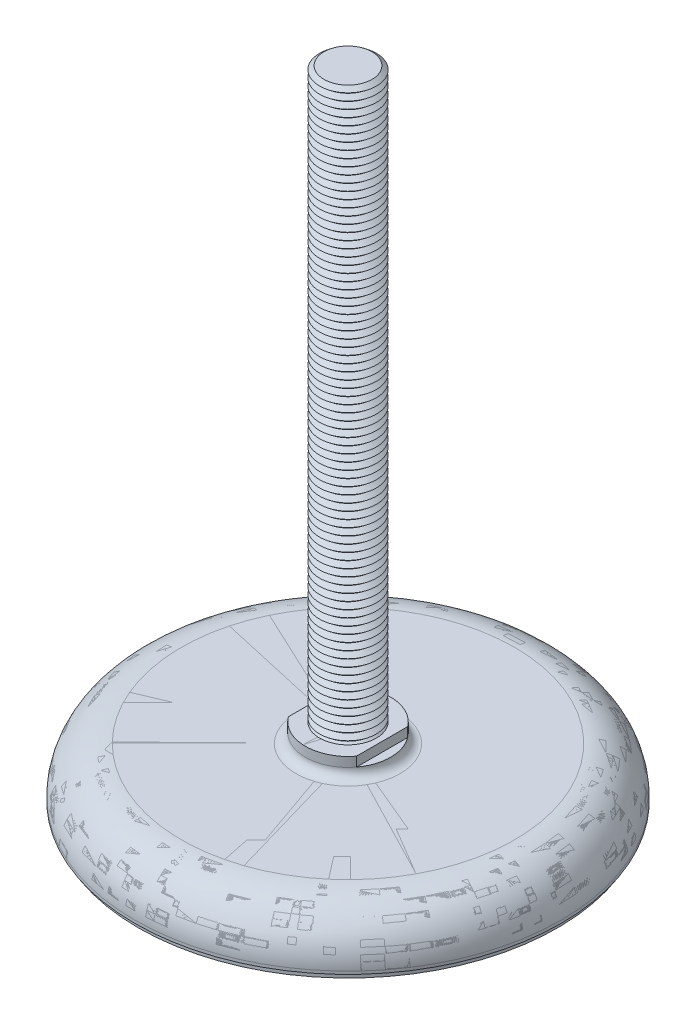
ISO-10303-21;
HEADER;
FILE_DESCRIPTION(('STEP AP214'),'2;1');
FILE_NAME('part.step','',(''),(''),'','','');
FILE_SCHEMA(('AUTOMOTIVE_DESIGN { 1 0 10303 214 1 1 1 1 }'));
ENDSEC;
DATA;
#1=APPLICATION_CONTEXT('core data for automotive mechanical design processes');
#2=APPLICATION_PROTOCOL_DEFINITION('international standard','automotive_design',2000,#1);
#3=PRODUCT_CONTEXT('',#1,'mechanical');
#4=PRODUCT('Part','Part','',(#3));
#5=PRODUCT_RELATED_PRODUCT_CATEGORY('part','',(#4));
#6=PRODUCT_DEFINITION_FORMATION('','',#4);
#7=PRODUCT_DEFINITION_CONTEXT('part definition',#1,'design');
#8=PRODUCT_DEFINITION('design','',#6,#7);
#9=PRODUCT_DEFINITION_SHAPE('','',#8);
#10=(LENGTH_UNIT() NAMED_UNIT(*) SI_UNIT(.MILLI.,.METRE.));
#11=(NAMED_UNIT(*) PLANE_ANGLE_UNIT() SI_UNIT($,.RADIAN.));
#12=(NAMED_UNIT(*) SI_UNIT($,.STERADIAN.) SOLID_ANGLE_UNIT());
#13=UNCERTAINTY_MEASURE_WITH_UNIT(LENGTH_MEASURE(1.E-05),#10,'distance_accuracy_value','');
#14=(GEOMETRIC_REPRESENTATION_CONTEXT(3) GLOBAL_UNCERTAINTY_ASSIGNED_CONTEXT((#13)) GLOBAL_UNIT_ASSIGNED_CONTEXT((#10,
#11,#12)) REPRESENTATION_CONTEXT('',''));
#15=CARTESIAN_POINT('',(0.,0.,0.));
#16=DIRECTION('',(0.,0.,1.));
#17=DIRECTION('',(1.,0.,0.));
#18=AXIS2_PLACEMENT_3D('',#15,#16,#17);
#19=CARTESIAN_POINT('',(0.,220.5,0.));
#20=DIRECTION('',(0.,-1.,0.));
#21=DIRECTION('',(0.998136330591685,0.,-0.0610234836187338));
#22=AXIS2_PLACEMENT_3D('',#19,#20,#21);
#23=CONICAL_SURFACE('',#22,8.4387505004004,0.895664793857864);
#24=CARTESIAN_POINT('',(0.,219.25,0.));
#25=DIRECTION('',(0.,-1.,0.));
#26=DIRECTION('',(0.998136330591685,0.,-0.0610234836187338));
#27=AXIS2_PLACEMENT_3D('',#24,#25,#26);
#28=CIRCLE('',#27,10.);
#29=CARTESIAN_POINT('',(9.98136330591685,219.25,-0.610234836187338));
#30=VERTEX_POINT('',#29);
#31=EDGE_CURVE('P0_E37',#30,#30,#28,.T.);
#32=ORIENTED_EDGE('',*,*,#31,.F.);
#33=EDGE_LOOP('',(#32));
#34=FACE_BOUND('',#33,.T.);
#35=CARTESIAN_POINT('',(0.,220.5,0.));
#36=DIRECTION('',(0.,-1.,0.));
#37=DIRECTION('',(0.998136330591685,0.,-0.0610234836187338));
#38=AXIS2_PLACEMENT_3D('',#35,#36,#37);
#39=CIRCLE('',#38,8.4387505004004);
#40=CARTESIAN_POINT('',(8.42302345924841,220.5,-0.514961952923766));
#41=VERTEX_POINT('',#40);
#42=EDGE_CURVE('P0_E25',#41,#41,#39,.T.);
#43=ORIENTED_EDGE('',*,*,#42,.T.);
#44=EDGE_LOOP('',(#43));
#45=FACE_BOUND('',#44,.T.);
#46=ADVANCED_FACE('P0_F14',(#34,#45),#23,.T.);
#47=CARTESIAN_POINT('',(0.,221.75,0.));
#48=DIRECTION('',(0.,1.,0.));
#49=DIRECTION('',(-0.998136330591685,0.,0.0610234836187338));
#50=AXIS2_PLACEMENT_3D('',#47,#48,#49);
#51=CONICAL_SURFACE('',#50,10.,0.895664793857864);
#52=ORIENTED_EDGE('',*,*,#42,.F.);
#53=EDGE_LOOP('',(#52));
#54=FACE_BOUND('',#53,.T.);
#55=CARTESIAN_POINT('',(0.,221.75,0.));
#56=DIRECTION('',(0.,-1.,0.));
#57=DIRECTION('',(0.998136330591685,0.,-0.0610234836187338));
#58=AXIS2_PLACEMENT_3D('',#55,#56,#57);
#59=CIRCLE('',#58,10.);
#60=CARTESIAN_POINT('',(9.98136330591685,221.75,-0.610234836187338));
#61=VERTEX_POINT('',#60);
#62=EDGE_CURVE('P0_E29',#61,#61,#59,.T.);
#63=ORIENTED_EDGE('',*,*,#62,.T.);
#64=EDGE_LOOP('',(#63));
#65=FACE_BOUND('',#64,.T.);
#66=ADVANCED_FACE('P0_F1537',(#54,#65),#51,.T.);
#67=CARTESIAN_POINT('',(0.,223.,0.));
#68=DIRECTION('',(0.,1.,0.));
#69=DIRECTION('',(-0.998136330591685,0.,0.0610234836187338));
#70=AXIS2_PLACEMENT_3D('',#67,#68,#69);
#71=PLANE('',#70);
#72=CARTESIAN_POINT('',(0.,223.,0.));
#73=DIRECTION('',(0.,-1.,0.));
#74=DIRECTION('',(0.998136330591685,0.,-0.0610234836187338));
#75=AXIS2_PLACEMENT_3D('',#72,#73,#74);
#76=CIRCLE('',#75,8.4387505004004);
#77=CARTESIAN_POINT('',(8.42302345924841,223.,-0.514961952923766));
#78=VERTEX_POINT('',#77);
#79=EDGE_CURVE('P0_E21',#78,#78,#76,.T.);
#80=ORIENTED_EDGE('',*,*,#79,.F.);
#81=EDGE_LOOP('',(#80));
#82=FACE_BOUND('',#81,.T.);
#83=ADVANCED_FACE('P0_F1543',(#82),#71,.T.);
#84=CARTESIAN_POINT('',(0.,223.,0.));
#85=DIRECTION('',(0.,-1.,0.));
#86=DIRECTION('',(0.998136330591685,0.,-0.0610234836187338));
#87=AXIS2_PLACEMENT_3D('',#84,#85,#86);
#88=CONICAL_SURFACE('',#87,8.4387505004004,0.895664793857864);
#89=ORIENTED_EDGE('',*,*,#62,.F.);
#90=EDGE_LOOP('',(#89));
#91=FACE_BOUND('',#90,.T.);
#92=ORIENTED_EDGE('',*,*,#79,.T.);
#93=EDGE_LOOP('',(#92));
#94=FACE_BOUND('',#93,.T.);
#95=ADVANCED_FACE('P0_F1526',(#91,#94),#88,.T.);
#96=CARTESIAN_POINT('',(0.,218.,0.));
#97=DIRECTION('',(0.,-1.,0.));
#98=DIRECTION('',(0.998136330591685,0.,-0.0610234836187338));
#99=AXIS2_PLACEMENT_3D('',#96,#97,#98);
#100=CONICAL_SURFACE('',#99,8.4387505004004,0.895664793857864);
#101=CARTESIAN_POINT('',(0.,216.75,0.));
#102=DIRECTION('',(0.,-1.,0.));
#103=DIRECTION('',(0.998136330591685,0.,-0.0610234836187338));
#104=AXIS2_PLACEMENT_3D('',#101,#102,#103);
#105=CIRCLE('',#104,10.);
#106=CARTESIAN_POINT('',(9.98136330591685,216.75,-0.610234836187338));
#107=VERTEX_POINT('',#106);
#108=EDGE_CURVE('P0_E43',#107,#107,#105,.T.);
#109=ORIENTED_EDGE('',*,*,#108,.F.);
#110=EDGE_LOOP('',(#109));
#111=FACE_BOUND('',#110,.T.);
#112=CARTESIAN_POINT('',(0.,218.,0.));
#113=DIRECTION('',(0.,-1.,0.));
#114=DIRECTION('',(0.998136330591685,0.,-0.0610234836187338));
#115=AXIS2_PLACEMENT_3D('',#112,#113,#114);
#116=CIRCLE('',#115,8.4387505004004);
#117=CARTESIAN_POINT('',(8.42302345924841,218.,-0.514961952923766));
#118=VERTEX_POINT('',#117);
#119=EDGE_CURVE('P0_E34',#118,#118,#116,.T.);
#120=ORIENTED_EDGE('',*,*,#119,.T.);
#121=EDGE_LOOP('',(#120));
#122=FACE_BOUND('',#121,.T.);
#123=ADVANCED_FACE('P0_F1523',(#111,#122),#100,.T.);
#124=CARTESIAN_POINT('',(0.,219.25,0.));
#125=DIRECTION('',(0.,1.,0.));
#126=DIRECTION('',(-0.998136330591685,0.,0.0610234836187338));
#127=AXIS2_PLACEMENT_3D('',#124,#125,#126);
#128=CONICAL_SURFACE('',#127,10.,0.895664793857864);
#129=ORIENTED_EDGE('',*,*,#119,.F.);
#130=EDGE_LOOP('',(#129));
#131=FACE_BOUND('',#130,.T.);
#132=ORIENTED_EDGE('',*,*,#31,.T.);
#133=EDGE_LOOP('',(#132));
#134=FACE_BOUND('',#133,.T.);
#135=ADVANCED_FACE('P0_F1514',(#131,#134),#128,.T.);
#136=CARTESIAN_POINT('',(0.,215.5,0.));
#137=DIRECTION('',(0.,-1.,0.));
#138=DIRECTION('',(0.998136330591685,0.,-0.0610234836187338));
#139=AXIS2_PLACEMENT_3D('',#136,#137,#138);
#140=CONICAL_SURFACE('',#139,8.4387505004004,0.895664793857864);
#141=CARTESIAN_POINT('',(0.,214.25,0.));
#142=DIRECTION('',(0.,-1.,0.));
#143=DIRECTION('',(0.998136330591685,0.,-0.0610234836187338));
#144=AXIS2_PLACEMENT_3D('',#141,#142,#143);
#145=CIRCLE('',#144,10.);
#146=CARTESIAN_POINT('',(9.98136330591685,214.25,-0.610234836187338));
#147=VERTEX_POINT('',#146);
#148=EDGE_CURVE('P0_E49',#147,#147,#145,.T.);
#149=ORIENTED_EDGE('',*,*,#148,.F.);
#150=EDGE_LOOP('',(#149));
#151=FACE_BOUND('',#150,.T.);
#152=CARTESIAN_POINT('',(0.,215.5,0.));
#153=DIRECTION('',(0.,-1.,0.));
#154=DIRECTION('',(0.998136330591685,0.,-0.0610234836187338));
#155=AXIS2_PLACEMENT_3D('',#152,#153,#154);
#156=CIRCLE('',#155,8.4387505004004);
#157=CARTESIAN_POINT('',(8.42302345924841,215.5,-0.514961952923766));
#158=VERTEX_POINT('',#157);
#159=EDGE_CURVE('P0_E40',#158,#158,#156,.T.);
#160=ORIENTED_EDGE('',*,*,#159,.T.);
#161=EDGE_LOOP('',(#160));
#162=FACE_BOUND('',#161,.T.);
#163=ADVANCED_FACE('P0_F1511',(#151,#162),#140,.T.);
#164=CARTESIAN_POINT('',(0.,216.75,0.));
#165=DIRECTION('',(0.,1.,0.));
#166=DIRECTION('',(-0.998136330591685,0.,0.0610234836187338));
#167=AXIS2_PLACEMENT_3D('',#164,#165,#166);
#168=CONICAL_SURFACE('',#167,10.,0.895664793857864);
#169=ORIENTED_EDGE('',*,*,#159,.F.);
#170=EDGE_LOOP('',(#169));
#171=FACE_BOUND('',#170,.T.);
#172=ORIENTED_EDGE('',*,*,#108,.T.);
#173=EDGE_LOOP('',(#172));
#174=FACE_BOUND('',#173,.T.);
#175=ADVANCED_FACE('P0_F1502',(#171,#174),#168,.T.);
#176=CARTESIAN_POINT('',(0.,213.,0.));
#177=DIRECTION('',(0.,-1.,0.));
#178=DIRECTION('',(0.998136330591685,0.,-0.0610234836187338));
#179=AXIS2_PLACEMENT_3D('',#176,#177,#178);
#180=CONICAL_SURFACE('',#179,8.4387505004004,0.895664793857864);
#181=CARTESIAN_POINT('',(0.,211.75,0.));
#182=DIRECTION('',(0.,-1.,0.));
#183=DIRECTION('',(0.998136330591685,0.,-0.0610234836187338));
#184=AXIS2_PLACEMENT_3D('',#181,#182,#183);
#185=CIRCLE('',#184,10.);
#186=CARTESIAN_POINT('',(9.98136330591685,211.75,-0.610234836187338));
#187=VERTEX_POINT('',#186);
#188=EDGE_CURVE('P0_E55',#187,#187,#185,.T.);
#189=ORIENTED_EDGE('',*,*,#188,.F.);
#190=EDGE_LOOP('',(#189));
#191=FACE_BOUND('',#190,.T.);
#192=CARTESIAN_POINT('',(0.,213.,0.));
#193=DIRECTION('',(0.,-1.,0.));
#194=DIRECTION('',(0.998136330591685,0.,-0.0610234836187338));
#195=AXIS2_PLACEMENT_3D('',#192,#193,#194);
#196=CIRCLE('',#195,8.4387505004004);
#197=CARTESIAN_POINT('',(8.42302345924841,213.,-0.514961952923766));
#198=VERTEX_POINT('',#197);
#199=EDGE_CURVE('P0_E46',#198,#198,#196,.T.);
#200=ORIENTED_EDGE('',*,*,#199,.T.);
#201=EDGE_LOOP('',(#200));
#202=FACE_BOUND('',#201,.T.);
#203=ADVANCED_FACE('P0_F1499',(#191,#202),#180,.T.);
#204=CARTESIAN_POINT('',(0.,214.25,0.));
#205=DIRECTION('',(0.,1.,0.));
#206=DIRECTION('',(-0.998136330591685,0.,0.0610234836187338));
#207=AXIS2_PLACEMENT_3D('',#204,#205,#206);
#208=CONICAL_SURFACE('',#207,10.,0.895664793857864);
#209=ORIENTED_EDGE('',*,*,#199,.F.);
#210=EDGE_LOOP('',(#209));
#211=FACE_BOUND('',#210,.T.);
#212=ORIENTED_EDGE('',*,*,#148,.T.);
#213=EDGE_LOOP('',(#212));
#214=FACE_BOUND('',#213,.T.);
#215=ADVANCED_FACE('P0_F1490',(#211,#214),#208,.T.);
#216=CARTESIAN_POINT('',(0.,210.5,0.));
#217=DIRECTION('',(0.,-1.,0.));
#218=DIRECTION('',(0.998136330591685,0.,-0.0610234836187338));
#219=AXIS2_PLACEMENT_3D('',#216,#217,#218);
#220=CONICAL_SURFACE('',#219,8.4387505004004,0.895664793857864);
#221=CARTESIAN_POINT('',(0.,209.25,0.));
#222=DIRECTION('',(0.,-1.,0.));
#223=DIRECTION('',(0.998136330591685,0.,-0.0610234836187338));
#224=AXIS2_PLACEMENT_3D('',#221,#222,#223);
#225=CIRCLE('',#224,10.);
#226=CARTESIAN_POINT('',(9.98136330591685,209.25,-0.610234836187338));
#227=VERTEX_POINT('',#226);
#228=EDGE_CURVE('P0_E61',#227,#227,#225,.T.);
#229=ORIENTED_EDGE('',*,*,#228,.F.);
#230=EDGE_LOOP('',(#229));
#231=FACE_BOUND('',#230,.T.);
#232=CARTESIAN_POINT('',(0.,210.5,0.));
#233=DIRECTION('',(0.,-1.,0.));
#234=DIRECTION('',(0.998136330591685,0.,-0.0610234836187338));
#235=AXIS2_PLACEMENT_3D('',#232,#233,#234);
#236=CIRCLE('',#235,8.4387505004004);
#237=CARTESIAN_POINT('',(8.42302345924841,210.5,-0.514961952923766));
#238=VERTEX_POINT('',#237);
#239=EDGE_CURVE('P0_E52',#238,#238,#236,.T.);
#240=ORIENTED_EDGE('',*,*,#239,.T.);
#241=EDGE_LOOP('',(#240));
#242=FACE_BOUND('',#241,.T.);
#243=ADVANCED_FACE('P0_F1487',(#231,#242),#220,.T.);
#244=CARTESIAN_POINT('',(0.,211.75,0.));
#245=DIRECTION('',(0.,1.,0.));
#246=DIRECTION('',(-0.998136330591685,0.,0.0610234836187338));
#247=AXIS2_PLACEMENT_3D('',#244,#245,#246);
#248=CONICAL_SURFACE('',#247,10.,0.895664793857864);
#249=ORIENTED_EDGE('',*,*,#239,.F.);
#250=EDGE_LOOP('',(#249));
#251=FACE_BOUND('',#250,.T.);
#252=ORIENTED_EDGE('',*,*,#188,.T.);
#253=EDGE_LOOP('',(#252));
#254=FACE_BOUND('',#253,.T.);
#255=ADVANCED_FACE('P0_F1478',(#251,#254),#248,.T.);
#256=CARTESIAN_POINT('',(0.,208.,0.));
#257=DIRECTION('',(0.,-1.,0.));
#258=DIRECTION('',(0.998136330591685,0.,-0.0610234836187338));
#259=AXIS2_PLACEMENT_3D('',#256,#257,#258);
#260=CONICAL_SURFACE('',#259,8.4387505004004,0.895664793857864);
#261=CARTESIAN_POINT('',(0.,206.75,0.));
#262=DIRECTION('',(0.,-1.,0.));
#263=DIRECTION('',(0.998136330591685,0.,-0.0610234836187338));
#264=AXIS2_PLACEMENT_3D('',#261,#262,#263);
#265=CIRCLE('',#264,10.);
#266=CARTESIAN_POINT('',(9.98136330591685,206.75,-0.610234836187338));
#267=VERTEX_POINT('',#266);
#268=EDGE_CURVE('P0_E67',#267,#267,#265,.T.);
#269=ORIENTED_EDGE('',*,*,#268,.F.);
#270=EDGE_LOOP('',(#269));
#271=FACE_BOUND('',#270,.T.);
#272=CARTESIAN_POINT('',(0.,208.,0.));
#273=DIRECTION('',(0.,-1.,0.));
#274=DIRECTION('',(0.998136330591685,0.,-0.0610234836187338));
#275=AXIS2_PLACEMENT_3D('',#272,#273,#274);
#276=CIRCLE('',#275,8.4387505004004);
#277=CARTESIAN_POINT('',(8.42302345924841,208.,-0.514961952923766));
#278=VERTEX_POINT('',#277);
#279=EDGE_CURVE('P0_E58',#278,#278,#276,.T.);
#280=ORIENTED_EDGE('',*,*,#279,.T.);
#281=EDGE_LOOP('',(#280));
#282=FACE_BOUND('',#281,.T.);
#283=ADVANCED_FACE('P0_F1475',(#271,#282),#260,.T.);
#284=CARTESIAN_POINT('',(0.,209.25,0.));
#285=DIRECTION('',(0.,1.,0.));
#286=DIRECTION('',(-0.998136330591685,0.,0.0610234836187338));
#287=AXIS2_PLACEMENT_3D('',#284,#285,#286);
#288=CONICAL_SURFACE('',#287,10.,0.895664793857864);
#289=ORIENTED_EDGE('',*,*,#279,.F.);
#290=EDGE_LOOP('',(#289));
#291=FACE_BOUND('',#290,.T.);
#292=ORIENTED_EDGE('',*,*,#228,.T.);
#293=EDGE_LOOP('',(#292));
#294=FACE_BOUND('',#293,.T.);
#295=ADVANCED_FACE('P0_F1466',(#291,#294),#288,.T.);
#296=CARTESIAN_POINT('',(0.,205.5,0.));
#297=DIRECTION('',(0.,-1.,0.));
#298=DIRECTION('',(0.998136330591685,0.,-0.0610234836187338));
#299=AXIS2_PLACEMENT_3D('',#296,#297,#298);
#300=CONICAL_SURFACE('',#299,8.4387505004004,0.895664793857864);
#301=CARTESIAN_POINT('',(0.,204.25,0.));
#302=DIRECTION('',(0.,-1.,0.));
#303=DIRECTION('',(0.998136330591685,0.,-0.0610234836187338));
#304=AXIS2_PLACEMENT_3D('',#301,#302,#303);
#305=CIRCLE('',#304,10.);
#306=CARTESIAN_POINT('',(9.98136330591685,204.25,-0.610234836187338));
#307=VERTEX_POINT('',#306);
#308=EDGE_CURVE('P0_E73',#307,#307,#305,.T.);
#309=ORIENTED_EDGE('',*,*,#308,.F.);
#310=EDGE_LOOP('',(#309));
#311=FACE_BOUND('',#310,.T.);
#312=CARTESIAN_POINT('',(0.,205.5,0.));
#313=DIRECTION('',(0.,-1.,0.));
#314=DIRECTION('',(0.998136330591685,0.,-0.0610234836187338));
#315=AXIS2_PLACEMENT_3D('',#312,#313,#314);
#316=CIRCLE('',#315,8.4387505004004);
#317=CARTESIAN_POINT('',(8.42302345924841,205.5,-0.514961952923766));
#318=VERTEX_POINT('',#317);
#319=EDGE_CURVE('P0_E64',#318,#318,#316,.T.);
#320=ORIENTED_EDGE('',*,*,#319,.T.);
#321=EDGE_LOOP('',(#320));
#322=FACE_BOUND('',#321,.T.);
#323=ADVANCED_FACE('P0_F1463',(#311,#322),#300,.T.);
#324=CARTESIAN_POINT('',(0.,206.75,0.));
#325=DIRECTION('',(0.,1.,0.));
#326=DIRECTION('',(-0.998136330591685,0.,0.0610234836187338));
#327=AXIS2_PLACEMENT_3D('',#324,#325,#326);
#328=CONICAL_SURFACE('',#327,10.,0.895664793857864);
#329=ORIENTED_EDGE('',*,*,#319,.F.);
#330=EDGE_LOOP('',(#329));
#331=FACE_BOUND('',#330,.T.);
#332=ORIENTED_EDGE('',*,*,#268,.T.);
#333=EDGE_LOOP('',(#332));
#334=FACE_BOUND('',#333,.T.);
#335=ADVANCED_FACE('P0_F1454',(#331,#334),#328,.T.);
#336=CARTESIAN_POINT('',(0.,203.,0.));
#337=DIRECTION('',(0.,-1.,0.));
#338=DIRECTION('',(0.998136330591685,0.,-0.0610234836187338));
#339=AXIS2_PLACEMENT_3D('',#336,#337,#338);
#340=CONICAL_SURFACE('',#339,8.4387505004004,0.895664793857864);
#341=CARTESIAN_POINT('',(0.,201.75,0.));
#342=DIRECTION('',(0.,-1.,0.));
#343=DIRECTION('',(0.998136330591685,0.,-0.0610234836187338));
#344=AXIS2_PLACEMENT_3D('',#341,#342,#343);
#345=CIRCLE('',#344,10.);
#346=CARTESIAN_POINT('',(9.98136330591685,201.75,-0.610234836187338));
#347=VERTEX_POINT('',#346);
#348=EDGE_CURVE('P0_E79',#347,#347,#345,.T.);
#349=ORIENTED_EDGE('',*,*,#348,.F.);
#350=EDGE_LOOP('',(#349));
#351=FACE_BOUND('',#350,.T.);
#352=CARTESIAN_POINT('',(0.,203.,0.));
#353=DIRECTION('',(0.,-1.,0.));
#354=DIRECTION('',(0.998136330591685,0.,-0.0610234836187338));
#355=AXIS2_PLACEMENT_3D('',#352,#353,#354);
#356=CIRCLE('',#355,8.4387505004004);
#357=CARTESIAN_POINT('',(8.42302345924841,203.,-0.514961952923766));
#358=VERTEX_POINT('',#357);
#359=EDGE_CURVE('P0_E70',#358,#358,#356,.T.);
#360=ORIENTED_EDGE('',*,*,#359,.T.);
#361=EDGE_LOOP('',(#360));
#362=FACE_BOUND('',#361,.T.);
#363=ADVANCED_FACE('P0_F1451',(#351,#362),#340,.T.);
#364=CARTESIAN_POINT('',(0.,204.25,0.));
#365=DIRECTION('',(0.,1.,0.));
#366=DIRECTION('',(-0.998136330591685,0.,0.0610234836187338));
#367=AXIS2_PLACEMENT_3D('',#364,#365,#366);
#368=CONICAL_SURFACE('',#367,10.,0.895664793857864);
#369=ORIENTED_EDGE('',*,*,#359,.F.);
#370=EDGE_LOOP('',(#369));
#371=FACE_BOUND('',#370,.T.);
#372=ORIENTED_EDGE('',*,*,#308,.T.);
#373=EDGE_LOOP('',(#372));
#374=FACE_BOUND('',#373,.T.);
#375=ADVANCED_FACE('P0_F1442',(#371,#374),#368,.T.);
#376=CARTESIAN_POINT('',(0.,200.5,0.));
#377=DIRECTION('',(0.,-1.,0.));
#378=DIRECTION('',(0.998136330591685,0.,-0.0610234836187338));
#379=AXIS2_PLACEMENT_3D('',#376,#377,#378);
#380=CONICAL_SURFACE('',#379,8.4387505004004,0.895664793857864);
#381=CARTESIAN_POINT('',(0.,199.25,0.));
#382=DIRECTION('',(0.,-1.,0.));
#383=DIRECTION('',(0.998136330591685,0.,-0.0610234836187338));
#384=AXIS2_PLACEMENT_3D('',#381,#382,#383);
#385=CIRCLE('',#384,10.);
#386=CARTESIAN_POINT('',(9.98136330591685,199.25,-0.610234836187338));
#387=VERTEX_POINT('',#386);
#388=EDGE_CURVE('P0_E85',#387,#387,#385,.T.);
#389=ORIENTED_EDGE('',*,*,#388,.F.);
#390=EDGE_LOOP('',(#389));
#391=FACE_BOUND('',#390,.T.);
#392=CARTESIAN_POINT('',(0.,200.5,0.));
#393=DIRECTION('',(0.,-1.,0.));
#394=DIRECTION('',(0.998136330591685,0.,-0.0610234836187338));
#395=AXIS2_PLACEMENT_3D('',#392,#393,#394);
#396=CIRCLE('',#395,8.4387505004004);
#397=CARTESIAN_POINT('',(8.42302345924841,200.5,-0.514961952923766));
#398=VERTEX_POINT('',#397);
#399=EDGE_CURVE('P0_E76',#398,#398,#396,.T.);
#400=ORIENTED_EDGE('',*,*,#399,.T.);
#401=EDGE_LOOP('',(#400));
#402=FACE_BOUND('',#401,.T.);
#403=ADVANCED_FACE('P0_F1439',(#391,#402),#380,.T.);
#404=CARTESIAN_POINT('',(0.,201.75,0.));
#405=DIRECTION('',(0.,1.,0.));
#406=DIRECTION('',(-0.998136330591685,0.,0.0610234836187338));
#407=AXIS2_PLACEMENT_3D('',#404,#405,#406);
#408=CONICAL_SURFACE('',#407,10.,0.895664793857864);
#409=ORIENTED_EDGE('',*,*,#399,.F.);
#410=EDGE_LOOP('',(#409));
#411=FACE_BOUND('',#410,.T.);
#412=ORIENTED_EDGE('',*,*,#348,.T.);
#413=EDGE_LOOP('',(#412));
#414=FACE_BOUND('',#413,.T.);
#415=ADVANCED_FACE('P0_F1430',(#411,#414),#408,.T.);
#416=CARTESIAN_POINT('',(0.,198.,0.));
#417=DIRECTION('',(0.,-1.,0.));
#418=DIRECTION('',(0.998136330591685,0.,-0.0610234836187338));
#419=AXIS2_PLACEMENT_3D('',#416,#417,#418);
#420=CONICAL_SURFACE('',#419,8.4387505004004,0.895664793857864);
#421=CARTESIAN_POINT('',(0.,196.75,0.));
#422=DIRECTION('',(0.,-1.,0.));
#423=DIRECTION('',(0.998136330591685,0.,-0.0610234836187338));
#424=AXIS2_PLACEMENT_3D('',#421,#422,#423);
#425=CIRCLE('',#424,10.);
#426=CARTESIAN_POINT('',(9.98136330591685,196.75,-0.610234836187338));
#427=VERTEX_POINT('',#426);
#428=EDGE_CURVE('P0_E91',#427,#427,#425,.T.);
#429=ORIENTED_EDGE('',*,*,#428,.F.);
#430=EDGE_LOOP('',(#429));
#431=FACE_BOUND('',#430,.T.);
#432=CARTESIAN_POINT('',(0.,198.,0.));
#433=DIRECTION('',(0.,-1.,0.));
#434=DIRECTION('',(0.998136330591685,0.,-0.0610234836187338));
#435=AXIS2_PLACEMENT_3D('',#432,#433,#434);
#436=CIRCLE('',#435,8.4387505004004);
#437=CARTESIAN_POINT('',(8.42302345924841,198.,-0.514961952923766));
#438=VERTEX_POINT('',#437);
#439=EDGE_CURVE('P0_E82',#438,#438,#436,.T.);
#440=ORIENTED_EDGE('',*,*,#439,.T.);
#441=EDGE_LOOP('',(#440));
#442=FACE_BOUND('',#441,.T.);
#443=ADVANCED_FACE('P0_F1427',(#431,#442),#420,.T.);
#444=CARTESIAN_POINT('',(0.,199.25,0.));
#445=DIRECTION('',(0.,1.,0.));
#446=DIRECTION('',(-0.998136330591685,0.,0.0610234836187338));
#447=AXIS2_PLACEMENT_3D('',#444,#445,#446);
#448=CONICAL_SURFACE('',#447,10.,0.895664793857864);
#449=ORIENTED_EDGE('',*,*,#439,.F.);
#450=EDGE_LOOP('',(#449));
#451=FACE_BOUND('',#450,.T.);
#452=ORIENTED_EDGE('',*,*,#388,.T.);
#453=EDGE_LOOP('',(#452));
#454=FACE_BOUND('',#453,.T.);
#455=ADVANCED_FACE('P0_F1418',(#451,#454),#448,.T.);
#456=CARTESIAN_POINT('',(0.,195.5,0.));
#457=DIRECTION('',(0.,-1.,0.));
#458=DIRECTION('',(0.998136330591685,0.,-0.0610234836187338));
#459=AXIS2_PLACEMENT_3D('',#456,#457,#458);
#460=CONICAL_SURFACE('',#459,8.4387505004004,0.895664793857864);
#461=CARTESIAN_POINT('',(0.,194.25,0.));
#462=DIRECTION('',(0.,-1.,0.));
#463=DIRECTION('',(0.998136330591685,0.,-0.0610234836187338));
#464=AXIS2_PLACEMENT_3D('',#461,#462,#463);
#465=CIRCLE('',#464,10.);
#466=CARTESIAN_POINT('',(9.98136330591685,194.25,-0.610234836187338));
#467=VERTEX_POINT('',#466);
#468=EDGE_CURVE('P0_E97',#467,#467,#465,.T.);
#469=ORIENTED_EDGE('',*,*,#468,.F.);
#470=EDGE_LOOP('',(#469));
#471=FACE_BOUND('',#470,.T.);
#472=CARTESIAN_POINT('',(0.,195.5,0.));
#473=DIRECTION('',(0.,-1.,0.));
#474=DIRECTION('',(0.998136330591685,0.,-0.0610234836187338));
#475=AXIS2_PLACEMENT_3D('',#472,#473,#474);
#476=CIRCLE('',#475,8.4387505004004);
#477=CARTESIAN_POINT('',(8.42302345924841,195.5,-0.514961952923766));
#478=VERTEX_POINT('',#477);
#479=EDGE_CURVE('P0_E88',#478,#478,#476,.T.);
#480=ORIENTED_EDGE('',*,*,#479,.T.);
#481=EDGE_LOOP('',(#480));
#482=FACE_BOUND('',#481,.T.);
#483=ADVANCED_FACE('P0_F1415',(#471,#482),#460,.T.);
#484=CARTESIAN_POINT('',(0.,196.75,0.));
#485=DIRECTION('',(0.,1.,0.));
#486=DIRECTION('',(-0.998136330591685,0.,0.0610234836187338));
#487=AXIS2_PLACEMENT_3D('',#484,#485,#486);
#488=CONICAL_SURFACE('',#487,10.,0.895664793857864);
#489=ORIENTED_EDGE('',*,*,#479,.F.);
#490=EDGE_LOOP('',(#489));
#491=FACE_BOUND('',#490,.T.);
#492=ORIENTED_EDGE('',*,*,#428,.T.);
#493=EDGE_LOOP('',(#492));
#494=FACE_BOUND('',#493,.T.);
#495=ADVANCED_FACE('P0_F1406',(#491,#494),#488,.T.);
#496=CARTESIAN_POINT('',(0.,193.,0.));
#497=DIRECTION('',(0.,-1.,0.));
#498=DIRECTION('',(0.998136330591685,0.,-0.0610234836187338));
#499=AXIS2_PLACEMENT_3D('',#496,#497,#498);
#500=CONICAL_SURFACE('',#499,8.4387505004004,0.895664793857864);
#501=CARTESIAN_POINT('',(0.,191.75,0.));
#502=DIRECTION('',(0.,-1.,0.));
#503=DIRECTION('',(0.998136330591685,0.,-0.0610234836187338));
#504=AXIS2_PLACEMENT_3D('',#501,#502,#503);
#505=CIRCLE('',#504,10.);
#506=CARTESIAN_POINT('',(9.98136330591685,191.75,-0.610234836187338));
#507=VERTEX_POINT('',#506);
#508=EDGE_CURVE('P0_E103',#507,#507,#505,.T.);
#509=ORIENTED_EDGE('',*,*,#508,.F.);
#510=EDGE_LOOP('',(#509));
#511=FACE_BOUND('',#510,.T.);
#512=CARTESIAN_POINT('',(0.,193.,0.));
#513=DIRECTION('',(0.,-1.,0.));
#514=DIRECTION('',(0.998136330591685,0.,-0.0610234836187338));
#515=AXIS2_PLACEMENT_3D('',#512,#513,#514);
#516=CIRCLE('',#515,8.4387505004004);
#517=CARTESIAN_POINT('',(8.42302345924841,193.,-0.514961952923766));
#518=VERTEX_POINT('',#517);
#519=EDGE_CURVE('P0_E94',#518,#518,#516,.T.);
#520=ORIENTED_EDGE('',*,*,#519,.T.);
#521=EDGE_LOOP('',(#520));
#522=FACE_BOUND('',#521,.T.);
#523=ADVANCED_FACE('P0_F1403',(#511,#522),#500,.T.);
#524=CARTESIAN_POINT('',(0.,194.25,0.));
#525=DIRECTION('',(0.,1.,0.));
#526=DIRECTION('',(-0.998136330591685,0.,0.0610234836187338));
#527=AXIS2_PLACEMENT_3D('',#524,#525,#526);
#528=CONICAL_SURFACE('',#527,10.,0.895664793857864);
#529=ORIENTED_EDGE('',*,*,#519,.F.);
#530=EDGE_LOOP('',(#529));
#531=FACE_BOUND('',#530,.T.);
#532=ORIENTED_EDGE('',*,*,#468,.T.);
#533=EDGE_LOOP('',(#532));
#534=FACE_BOUND('',#533,.T.);
#535=ADVANCED_FACE('P0_F1394',(#531,#534),#528,.T.);
#536=CARTESIAN_POINT('',(0.,190.5,0.));
#537=DIRECTION('',(0.,-1.,0.));
#538=DIRECTION('',(0.998136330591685,0.,-0.0610234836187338));
#539=AXIS2_PLACEMENT_3D('',#536,#537,#538);
#540=CONICAL_SURFACE('',#539,8.4387505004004,0.895664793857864);
#541=CARTESIAN_POINT('',(0.,189.25,0.));
#542=DIRECTION('',(0.,-1.,0.));
#543=DIRECTION('',(0.998136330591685,0.,-0.0610234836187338));
#544=AXIS2_PLACEMENT_3D('',#541,#542,#543);
#545=CIRCLE('',#544,10.);
#546=CARTESIAN_POINT('',(9.98136330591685,189.25,-0.610234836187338));
#547=VERTEX_POINT('',#546);
#548=EDGE_CURVE('P0_E109',#547,#547,#545,.T.);
#549=ORIENTED_EDGE('',*,*,#548,.F.);
#550=EDGE_LOOP('',(#549));
#551=FACE_BOUND('',#550,.T.);
#552=CARTESIAN_POINT('',(0.,190.5,0.));
#553=DIRECTION('',(0.,-1.,0.));
#554=DIRECTION('',(0.998136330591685,0.,-0.0610234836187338));
#555=AXIS2_PLACEMENT_3D('',#552,#553,#554);
#556=CIRCLE('',#555,8.4387505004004);
#557=CARTESIAN_POINT('',(8.42302345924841,190.5,-0.514961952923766));
#558=VERTEX_POINT('',#557);
#559=EDGE_CURVE('P0_E100',#558,#558,#556,.T.);
#560=ORIENTED_EDGE('',*,*,#559,.T.);
#561=EDGE_LOOP('',(#560));
#562=FACE_BOUND('',#561,.T.);
#563=ADVANCED_FACE('P0_F1391',(#551,#562),#540,.T.);
#564=CARTESIAN_POINT('',(0.,191.75,0.));
#565=DIRECTION('',(0.,1.,0.));
#566=DIRECTION('',(-0.998136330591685,0.,0.0610234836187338));
#567=AXIS2_PLACEMENT_3D('',#564,#565,#566);
#568=CONICAL_SURFACE('',#567,10.,0.895664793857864);
#569=ORIENTED_EDGE('',*,*,#559,.F.);
#570=EDGE_LOOP('',(#569));
#571=FACE_BOUND('',#570,.T.);
#572=ORIENTED_EDGE('',*,*,#508,.T.);
#573=EDGE_LOOP('',(#572));
#574=FACE_BOUND('',#573,.T.);
#575=ADVANCED_FACE('P0_F1382',(#571,#574),#568,.T.);
#576=CARTESIAN_POINT('',(0.,188.,0.));
#577=DIRECTION('',(0.,-1.,0.));
#578=DIRECTION('',(0.998136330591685,0.,-0.0610234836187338));
#579=AXIS2_PLACEMENT_3D('',#576,#577,#578);
#580=CONICAL_SURFACE('',#579,8.4387505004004,0.895664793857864);
#581=CARTESIAN_POINT('',(0.,186.75,0.));
#582=DIRECTION('',(0.,-1.,0.));
#583=DIRECTION('',(0.998136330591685,0.,-0.0610234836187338));
#584=AXIS2_PLACEMENT_3D('',#581,#582,#583);
#585=CIRCLE('',#584,10.);
#586=CARTESIAN_POINT('',(9.98136330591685,186.75,-0.610234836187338));
#587=VERTEX_POINT('',#586);
#588=EDGE_CURVE('P0_E115',#587,#587,#585,.T.);
#589=ORIENTED_EDGE('',*,*,#588,.F.);
#590=EDGE_LOOP('',(#589));
#591=FACE_BOUND('',#590,.T.);
#592=CARTESIAN_POINT('',(0.,188.,0.));
#593=DIRECTION('',(0.,-1.,0.));
#594=DIRECTION('',(0.998136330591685,0.,-0.0610234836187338));
#595=AXIS2_PLACEMENT_3D('',#592,#593,#594);
#596=CIRCLE('',#595,8.4387505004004);
#597=CARTESIAN_POINT('',(8.42302345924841,188.,-0.514961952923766));
#598=VERTEX_POINT('',#597);
#599=EDGE_CURVE('P0_E106',#598,#598,#596,.T.);
#600=ORIENTED_EDGE('',*,*,#599,.T.);
#601=EDGE_LOOP('',(#600));
#602=FACE_BOUND('',#601,.T.);
#603=ADVANCED_FACE('P0_F1379',(#591,#602),#580,.T.);
#604=CARTESIAN_POINT('',(0.,189.25,0.));
#605=DIRECTION('',(0.,1.,0.));
#606=DIRECTION('',(-0.998136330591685,0.,0.0610234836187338));
#607=AXIS2_PLACEMENT_3D('',#604,#605,#606);
#608=CONICAL_SURFACE('',#607,10.,0.895664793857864);
#609=ORIENTED_EDGE('',*,*,#599,.F.);
#610=EDGE_LOOP('',(#609));
#611=FACE_BOUND('',#610,.T.);
#612=ORIENTED_EDGE('',*,*,#548,.T.);
#613=EDGE_LOOP('',(#612));
#614=FACE_BOUND('',#613,.T.);
#615=ADVANCED_FACE('P0_F1370',(#611,#614),#608,.T.);
#616=CARTESIAN_POINT('',(0.,185.5,0.));
#617=DIRECTION('',(0.,-1.,0.));
#618=DIRECTION('',(0.998136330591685,0.,-0.0610234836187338));
#619=AXIS2_PLACEMENT_3D('',#616,#617,#618);
#620=CONICAL_SURFACE('',#619,8.4387505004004,0.895664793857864);
#621=CARTESIAN_POINT('',(0.,184.25,0.));
#622=DIRECTION('',(0.,-1.,0.));
#623=DIRECTION('',(0.998136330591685,0.,-0.0610234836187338));
#624=AXIS2_PLACEMENT_3D('',#621,#622,#623);
#625=CIRCLE('',#624,10.);
#626=CARTESIAN_POINT('',(9.98136330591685,184.25,-0.610234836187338));
#627=VERTEX_POINT('',#626);
#628=EDGE_CURVE('P0_E121',#627,#627,#625,.T.);
#629=ORIENTED_EDGE('',*,*,#628,.F.);
#630=EDGE_LOOP('',(#629));
#631=FACE_BOUND('',#630,.T.);
#632=CARTESIAN_POINT('',(0.,185.5,0.));
#633=DIRECTION('',(0.,-1.,0.));
#634=DIRECTION('',(0.998136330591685,0.,-0.0610234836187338));
#635=AXIS2_PLACEMENT_3D('',#632,#633,#634);
#636=CIRCLE('',#635,8.4387505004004);
#637=CARTESIAN_POINT('',(8.42302345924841,185.5,-0.514961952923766));
#638=VERTEX_POINT('',#637);
#639=EDGE_CURVE('P0_E112',#638,#638,#636,.T.);
#640=ORIENTED_EDGE('',*,*,#639,.T.);
#641=EDGE_LOOP('',(#640));
#642=FACE_BOUND('',#641,.T.);
#643=ADVANCED_FACE('P0_F1367',(#631,#642),#620,.T.);
#644=CARTESIAN_POINT('',(0.,186.75,0.));
#645=DIRECTION('',(0.,1.,0.));
#646=DIRECTION('',(-0.998136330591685,0.,0.0610234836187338));
#647=AXIS2_PLACEMENT_3D('',#644,#645,#646);
#648=CONICAL_SURFACE('',#647,10.,0.895664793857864);
#649=ORIENTED_EDGE('',*,*,#639,.F.);
#650=EDGE_LOOP('',(#649));
#651=FACE_BOUND('',#650,.T.);
#652=ORIENTED_EDGE('',*,*,#588,.T.);
#653=EDGE_LOOP('',(#652));
#654=FACE_BOUND('',#653,.T.);
#655=ADVANCED_FACE('P0_F1358',(#651,#654),#648,.T.);
#656=CARTESIAN_POINT('',(0.,183.,0.));
#657=DIRECTION('',(0.,-1.,0.));
#658=DIRECTION('',(0.998136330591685,0.,-0.0610234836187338));
#659=AXIS2_PLACEMENT_3D('',#656,#657,#658);
#660=CONICAL_SURFACE('',#659,8.4387505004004,0.895664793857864);
#661=CARTESIAN_POINT('',(0.,181.75,0.));
#662=DIRECTION('',(0.,-1.,0.));
#663=DIRECTION('',(0.998136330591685,0.,-0.0610234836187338));
#664=AXIS2_PLACEMENT_3D('',#661,#662,#663);
#665=CIRCLE('',#664,10.);
#666=CARTESIAN_POINT('',(9.98136330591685,181.75,-0.610234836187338));
#667=VERTEX_POINT('',#666);
#668=EDGE_CURVE('P0_E127',#667,#667,#665,.T.);
#669=ORIENTED_EDGE('',*,*,#668,.F.);
#670=EDGE_LOOP('',(#669));
#671=FACE_BOUND('',#670,.T.);
#672=CARTESIAN_POINT('',(0.,183.,0.));
#673=DIRECTION('',(0.,-1.,0.));
#674=DIRECTION('',(0.998136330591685,0.,-0.0610234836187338));
#675=AXIS2_PLACEMENT_3D('',#672,#673,#674);
#676=CIRCLE('',#675,8.4387505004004);
#677=CARTESIAN_POINT('',(8.42302345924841,183.,-0.514961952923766));
#678=VERTEX_POINT('',#677);
#679=EDGE_CURVE('P0_E118',#678,#678,#676,.T.);
#680=ORIENTED_EDGE('',*,*,#679,.T.);
#681=EDGE_LOOP('',(#680));
#682=FACE_BOUND('',#681,.T.);
#683=ADVANCED_FACE('P0_F1355',(#671,#682),#660,.T.);
#684=CARTESIAN_POINT('',(0.,184.25,0.));
#685=DIRECTION('',(0.,1.,0.));
#686=DIRECTION('',(-0.998136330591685,0.,0.0610234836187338));
#687=AXIS2_PLACEMENT_3D('',#684,#685,#686);
#688=CONICAL_SURFACE('',#687,10.,0.895664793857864);
#689=ORIENTED_EDGE('',*,*,#679,.F.);
#690=EDGE_LOOP('',(#689));
#691=FACE_BOUND('',#690,.T.);
#692=ORIENTED_EDGE('',*,*,#628,.T.);
#693=EDGE_LOOP('',(#692));
#694=FACE_BOUND('',#693,.T.);
#695=ADVANCED_FACE('P0_F1346',(#691,#694),#688,.T.);
#696=CARTESIAN_POINT('',(0.,180.5,0.));
#697=DIRECTION('',(0.,-1.,0.));
#698=DIRECTION('',(0.998136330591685,0.,-0.0610234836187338));
#699=AXIS2_PLACEMENT_3D('',#696,#697,#698);
#700=CONICAL_SURFACE('',#699,8.4387505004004,0.895664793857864);
#701=CARTESIAN_POINT('',(0.,179.25,0.));
#702=DIRECTION('',(0.,-1.,0.));
#703=DIRECTION('',(0.998136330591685,0.,-0.0610234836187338));
#704=AXIS2_PLACEMENT_3D('',#701,#702,#703);
#705=CIRCLE('',#704,10.);
#706=CARTESIAN_POINT('',(9.98136330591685,179.25,-0.610234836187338));
#707=VERTEX_POINT('',#706);
#708=EDGE_CURVE('P0_E133',#707,#707,#705,.T.);
#709=ORIENTED_EDGE('',*,*,#708,.F.);
#710=EDGE_LOOP('',(#709));
#711=FACE_BOUND('',#710,.T.);
#712=CARTESIAN_POINT('',(0.,180.5,0.));
#713=DIRECTION('',(0.,-1.,0.));
#714=DIRECTION('',(0.998136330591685,0.,-0.0610234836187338));
#715=AXIS2_PLACEMENT_3D('',#712,#713,#714);
#716=CIRCLE('',#715,8.4387505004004);
#717=CARTESIAN_POINT('',(8.42302345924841,180.5,-0.514961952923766));
#718=VERTEX_POINT('',#717);
#719=EDGE_CURVE('P0_E124',#718,#718,#716,.T.);
#720=ORIENTED_EDGE('',*,*,#719,.T.);
#721=EDGE_LOOP('',(#720));
#722=FACE_BOUND('',#721,.T.);
#723=ADVANCED_FACE('P0_F1343',(#711,#722),#700,.T.);
#724=CARTESIAN_POINT('',(0.,181.75,0.));
#725=DIRECTION('',(0.,1.,0.));
#726=DIRECTION('',(-0.998136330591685,0.,0.0610234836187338));
#727=AXIS2_PLACEMENT_3D('',#724,#725,#726);
#728=CONICAL_SURFACE('',#727,10.,0.895664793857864);
#729=ORIENTED_EDGE('',*,*,#719,.F.);
#730=EDGE_LOOP('',(#729));
#731=FACE_BOUND('',#730,.T.);
#732=ORIENTED_EDGE('',*,*,#668,.T.);
#733=EDGE_LOOP('',(#732));
#734=FACE_BOUND('',#733,.T.);
#735=ADVANCED_FACE('P0_F1334',(#731,#734),#728,.T.);
#736=CARTESIAN_POINT('',(0.,178.,0.));
#737=DIRECTION('',(0.,-1.,0.));
#738=DIRECTION('',(0.998136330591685,0.,-0.0610234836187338));
#739=AXIS2_PLACEMENT_3D('',#736,#737,#738);
#740=CONICAL_SURFACE('',#739,8.4387505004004,0.895664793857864);
#741=CARTESIAN_POINT('',(0.,176.75,0.));
#742=DIRECTION('',(0.,-1.,0.));
#743=DIRECTION('',(0.998136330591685,0.,-0.0610234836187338));
#744=AXIS2_PLACEMENT_3D('',#741,#742,#743);
#745=CIRCLE('',#744,10.);
#746=CARTESIAN_POINT('',(9.98136330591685,176.75,-0.610234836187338));
#747=VERTEX_POINT('',#746);
#748=EDGE_CURVE('P0_E139',#747,#747,#745,.T.);
#749=ORIENTED_EDGE('',*,*,#748,.F.);
#750=EDGE_LOOP('',(#749));
#751=FACE_BOUND('',#750,.T.);
#752=CARTESIAN_POINT('',(0.,178.,0.));
#753=DIRECTION('',(0.,-1.,0.));
#754=DIRECTION('',(0.998136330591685,0.,-0.0610234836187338));
#755=AXIS2_PLACEMENT_3D('',#752,#753,#754);
#756=CIRCLE('',#755,8.4387505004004);
#757=CARTESIAN_POINT('',(8.42302345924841,178.,-0.514961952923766));
#758=VERTEX_POINT('',#757);
#759=EDGE_CURVE('P0_E130',#758,#758,#756,.T.);
#760=ORIENTED_EDGE('',*,*,#759,.T.);
#761=EDGE_LOOP('',(#760));
#762=FACE_BOUND('',#761,.T.);
#763=ADVANCED_FACE('P0_F1331',(#751,#762),#740,.T.);
#764=CARTESIAN_POINT('',(0.,179.25,0.));
#765=DIRECTION('',(0.,1.,0.));
#766=DIRECTION('',(-0.998136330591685,0.,0.0610234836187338));
#767=AXIS2_PLACEMENT_3D('',#764,#765,#766);
#768=CONICAL_SURFACE('',#767,10.,0.895664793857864);
#769=ORIENTED_EDGE('',*,*,#759,.F.);
#770=EDGE_LOOP('',(#769));
#771=FACE_BOUND('',#770,.T.);
#772=ORIENTED_EDGE('',*,*,#708,.T.);
#773=EDGE_LOOP('',(#772));
#774=FACE_BOUND('',#773,.T.);
#775=ADVANCED_FACE('P0_F1322',(#771,#774),#768,.T.);
#776=CARTESIAN_POINT('',(0.,175.5,0.));
#777=DIRECTION('',(0.,-1.,0.));
#778=DIRECTION('',(0.998136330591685,0.,-0.0610234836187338));
#779=AXIS2_PLACEMENT_3D('',#776,#777,#778);
#780=CONICAL_SURFACE('',#779,8.4387505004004,0.895664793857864);
#781=CARTESIAN_POINT('',(0.,174.25,0.));
#782=DIRECTION('',(0.,-1.,0.));
#783=DIRECTION('',(0.998136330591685,0.,-0.0610234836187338));
#784=AXIS2_PLACEMENT_3D('',#781,#782,#783);
#785=CIRCLE('',#784,10.);
#786=CARTESIAN_POINT('',(9.98136330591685,174.25,-0.610234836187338));
#787=VERTEX_POINT('',#786);
#788=EDGE_CURVE('P0_E145',#787,#787,#785,.T.);
#789=ORIENTED_EDGE('',*,*,#788,.F.);
#790=EDGE_LOOP('',(#789));
#791=FACE_BOUND('',#790,.T.);
#792=CARTESIAN_POINT('',(0.,175.5,0.));
#793=DIRECTION('',(0.,-1.,0.));
#794=DIRECTION('',(0.998136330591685,0.,-0.0610234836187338));
#795=AXIS2_PLACEMENT_3D('',#792,#793,#794);
#796=CIRCLE('',#795,8.4387505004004);
#797=CARTESIAN_POINT('',(8.42302345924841,175.5,-0.514961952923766));
#798=VERTEX_POINT('',#797);
#799=EDGE_CURVE('P0_E136',#798,#798,#796,.T.);
#800=ORIENTED_EDGE('',*,*,#799,.T.);
#801=EDGE_LOOP('',(#800));
#802=FACE_BOUND('',#801,.T.);
#803=ADVANCED_FACE('P0_F1319',(#791,#802),#780,.T.);
#804=CARTESIAN_POINT('',(0.,176.75,0.));
#805=DIRECTION('',(0.,1.,0.));
#806=DIRECTION('',(-0.998136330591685,0.,0.0610234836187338));
#807=AXIS2_PLACEMENT_3D('',#804,#805,#806);
#808=CONICAL_SURFACE('',#807,10.,0.895664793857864);
#809=ORIENTED_EDGE('',*,*,#799,.F.);
#810=EDGE_LOOP('',(#809));
#811=FACE_BOUND('',#810,.T.);
#812=ORIENTED_EDGE('',*,*,#748,.T.);
#813=EDGE_LOOP('',(#812));
#814=FACE_BOUND('',#813,.T.);
#815=ADVANCED_FACE('P0_F1310',(#811,#814),#808,.T.);
#816=CARTESIAN_POINT('',(0.,173.,0.));
#817=DIRECTION('',(0.,-1.,0.));
#818=DIRECTION('',(0.998136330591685,0.,-0.0610234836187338));
#819=AXIS2_PLACEMENT_3D('',#816,#817,#818);
#820=CONICAL_SURFACE('',#819,8.4387505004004,0.895664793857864);
#821=CARTESIAN_POINT('',(0.,171.75,0.));
#822=DIRECTION('',(0.,-1.,0.));
#823=DIRECTION('',(0.998136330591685,0.,-0.0610234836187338));
#824=AXIS2_PLACEMENT_3D('',#821,#822,#823);
#825=CIRCLE('',#824,10.);
#826=CARTESIAN_POINT('',(9.98136330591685,171.75,-0.610234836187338));
#827=VERTEX_POINT('',#826);
#828=EDGE_CURVE('P0_E151',#827,#827,#825,.T.);
#829=ORIENTED_EDGE('',*,*,#828,.F.);
#830=EDGE_LOOP('',(#829));
#831=FACE_BOUND('',#830,.T.);
#832=CARTESIAN_POINT('',(0.,173.,0.));
#833=DIRECTION('',(0.,-1.,0.));
#834=DIRECTION('',(0.998136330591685,0.,-0.0610234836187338));
#835=AXIS2_PLACEMENT_3D('',#832,#833,#834);
#836=CIRCLE('',#835,8.4387505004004);
#837=CARTESIAN_POINT('',(8.42302345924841,173.,-0.514961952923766));
#838=VERTEX_POINT('',#837);
#839=EDGE_CURVE('P0_E142',#838,#838,#836,.T.);
#840=ORIENTED_EDGE('',*,*,#839,.T.);
#841=EDGE_LOOP('',(#840));
#842=FACE_BOUND('',#841,.T.);
#843=ADVANCED_FACE('P0_F1307',(#831,#842),#820,.T.);
#844=CARTESIAN_POINT('',(0.,174.25,0.));
#845=DIRECTION('',(0.,1.,0.));
#846=DIRECTION('',(-0.998136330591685,0.,0.0610234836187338));
#847=AXIS2_PLACEMENT_3D('',#844,#845,#846);
#848=CONICAL_SURFACE('',#847,10.,0.895664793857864);
#849=ORIENTED_EDGE('',*,*,#839,.F.);
#850=EDGE_LOOP('',(#849));
#851=FACE_BOUND('',#850,.T.);
#852=ORIENTED_EDGE('',*,*,#788,.T.);
#853=EDGE_LOOP('',(#852));
#854=FACE_BOUND('',#853,.T.);
#855=ADVANCED_FACE('P0_F1298',(#851,#854),#848,.T.);
#856=CARTESIAN_POINT('',(0.,170.5,0.));
#857=DIRECTION('',(0.,-1.,0.));
#858=DIRECTION('',(0.998136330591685,0.,-0.0610234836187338));
#859=AXIS2_PLACEMENT_3D('',#856,#857,#858);
#860=CONICAL_SURFACE('',#859,8.4387505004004,0.895664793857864);
#861=CARTESIAN_POINT('',(0.,169.25,0.));
#862=DIRECTION('',(0.,-1.,0.));
#863=DIRECTION('',(0.998136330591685,0.,-0.0610234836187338));
#864=AXIS2_PLACEMENT_3D('',#861,#862,#863);
#865=CIRCLE('',#864,10.);
#866=CARTESIAN_POINT('',(9.98136330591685,169.25,-0.610234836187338));
#867=VERTEX_POINT('',#866);
#868=EDGE_CURVE('P0_E157',#867,#867,#865,.T.);
#869=ORIENTED_EDGE('',*,*,#868,.F.);
#870=EDGE_LOOP('',(#869));
#871=FACE_BOUND('',#870,.T.);
#872=CARTESIAN_POINT('',(0.,170.5,0.));
#873=DIRECTION('',(0.,-1.,0.));
#874=DIRECTION('',(0.998136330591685,0.,-0.0610234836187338));
#875=AXIS2_PLACEMENT_3D('',#872,#873,#874);
#876=CIRCLE('',#875,8.4387505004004);
#877=CARTESIAN_POINT('',(8.42302345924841,170.5,-0.514961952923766));
#878=VERTEX_POINT('',#877);
#879=EDGE_CURVE('P0_E148',#878,#878,#876,.T.);
#880=ORIENTED_EDGE('',*,*,#879,.T.);
#881=EDGE_LOOP('',(#880));
#882=FACE_BOUND('',#881,.T.);
#883=ADVANCED_FACE('P0_F1295',(#871,#882),#860,.T.);
#884=CARTESIAN_POINT('',(0.,171.75,0.));
#885=DIRECTION('',(0.,1.,0.));
#886=DIRECTION('',(-0.998136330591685,0.,0.0610234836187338));
#887=AXIS2_PLACEMENT_3D('',#884,#885,#886);
#888=CONICAL_SURFACE('',#887,10.,0.895664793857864);
#889=ORIENTED_EDGE('',*,*,#879,.F.);
#890=EDGE_LOOP('',(#889));
#891=FACE_BOUND('',#890,.T.);
#892=ORIENTED_EDGE('',*,*,#828,.T.);
#893=EDGE_LOOP('',(#892));
#894=FACE_BOUND('',#893,.T.);
#895=ADVANCED_FACE('P0_F1286',(#891,#894),#888,.T.);
#896=CARTESIAN_POINT('',(0.,168.,0.));
#897=DIRECTION('',(0.,-1.,0.));
#898=DIRECTION('',(0.998136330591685,0.,-0.0610234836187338));
#899=AXIS2_PLACEMENT_3D('',#896,#897,#898);
#900=CONICAL_SURFACE('',#899,8.4387505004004,0.895664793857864);
#901=CARTESIAN_POINT('',(0.,166.75,0.));
#902=DIRECTION('',(0.,-1.,0.));
#903=DIRECTION('',(0.998136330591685,0.,-0.0610234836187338));
#904=AXIS2_PLACEMENT_3D('',#901,#902,#903);
#905=CIRCLE('',#904,10.);
#906=CARTESIAN_POINT('',(9.98136330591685,166.75,-0.610234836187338));
#907=VERTEX_POINT('',#906);
#908=EDGE_CURVE('P0_E163',#907,#907,#905,.T.);
#909=ORIENTED_EDGE('',*,*,#908,.F.);
#910=EDGE_LOOP('',(#909));
#911=FACE_BOUND('',#910,.T.);
#912=CARTESIAN_POINT('',(0.,168.,0.));
#913=DIRECTION('',(0.,-1.,0.));
#914=DIRECTION('',(0.998136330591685,0.,-0.0610234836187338));
#915=AXIS2_PLACEMENT_3D('',#912,#913,#914);
#916=CIRCLE('',#915,8.4387505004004);
#917=CARTESIAN_POINT('',(8.42302345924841,168.,-0.514961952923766));
#918=VERTEX_POINT('',#917);
#919=EDGE_CURVE('P0_E154',#918,#918,#916,.T.);
#920=ORIENTED_EDGE('',*,*,#919,.T.);
#921=EDGE_LOOP('',(#920));
#922=FACE_BOUND('',#921,.T.);
#923=ADVANCED_FACE('P0_F1283',(#911,#922),#900,.T.);
#924=CARTESIAN_POINT('',(0.,169.25,0.));
#925=DIRECTION('',(0.,1.,0.));
#926=DIRECTION('',(-0.998136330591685,0.,0.0610234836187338));
#927=AXIS2_PLACEMENT_3D('',#924,#925,#926);
#928=CONICAL_SURFACE('',#927,10.,0.895664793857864);
#929=ORIENTED_EDGE('',*,*,#919,.F.);
#930=EDGE_LOOP('',(#929));
#931=FACE_BOUND('',#930,.T.);
#932=ORIENTED_EDGE('',*,*,#868,.T.);
#933=EDGE_LOOP('',(#932));
#934=FACE_BOUND('',#933,.T.);
#935=ADVANCED_FACE('P0_F1274',(#931,#934),#928,.T.);
#936=CARTESIAN_POINT('',(0.,165.5,0.));
#937=DIRECTION('',(0.,-1.,0.));
#938=DIRECTION('',(0.998136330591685,0.,-0.0610234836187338));
#939=AXIS2_PLACEMENT_3D('',#936,#937,#938);
#940=CONICAL_SURFACE('',#939,8.4387505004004,0.895664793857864);
#941=CARTESIAN_POINT('',(0.,164.25,0.));
#942=DIRECTION('',(0.,-1.,0.));
#943=DIRECTION('',(0.998136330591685,0.,-0.0610234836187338));
#944=AXIS2_PLACEMENT_3D('',#941,#942,#943);
#945=CIRCLE('',#944,10.);
#946=CARTESIAN_POINT('',(9.98136330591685,164.25,-0.610234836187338));
#947=VERTEX_POINT('',#946);
#948=EDGE_CURVE('P0_E169',#947,#947,#945,.T.);
#949=ORIENTED_EDGE('',*,*,#948,.F.);
#950=EDGE_LOOP('',(#949));
#951=FACE_BOUND('',#950,.T.);
#952=CARTESIAN_POINT('',(0.,165.5,0.));
#953=DIRECTION('',(0.,-1.,0.));
#954=DIRECTION('',(0.998136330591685,0.,-0.0610234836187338));
#955=AXIS2_PLACEMENT_3D('',#952,#953,#954);
#956=CIRCLE('',#955,8.4387505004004);
#957=CARTESIAN_POINT('',(8.42302345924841,165.5,-0.514961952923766));
#958=VERTEX_POINT('',#957);
#959=EDGE_CURVE('P0_E160',#958,#958,#956,.T.);
#960=ORIENTED_EDGE('',*,*,#959,.T.);
#961=EDGE_LOOP('',(#960));
#962=FACE_BOUND('',#961,.T.);
#963=ADVANCED_FACE('P0_F1271',(#951,#962),#940,.T.);
#964=CARTESIAN_POINT('',(0.,166.75,0.));
#965=DIRECTION('',(0.,1.,0.));
#966=DIRECTION('',(-0.998136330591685,0.,0.0610234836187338));
#967=AXIS2_PLACEMENT_3D('',#964,#965,#966);
#968=CONICAL_SURFACE('',#967,10.,0.895664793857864);
#969=ORIENTED_EDGE('',*,*,#959,.F.);
#970=EDGE_LOOP('',(#969));
#971=FACE_BOUND('',#970,.T.);
#972=ORIENTED_EDGE('',*,*,#908,.T.);
#973=EDGE_LOOP('',(#972));
#974=FACE_BOUND('',#973,.T.);
#975=ADVANCED_FACE('P0_F1262',(#971,#974),#968,.T.);
#976=CARTESIAN_POINT('',(0.,163.,0.));
#977=DIRECTION('',(0.,-1.,0.));
#978=DIRECTION('',(0.998136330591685,0.,-0.0610234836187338));
#979=AXIS2_PLACEMENT_3D('',#976,#977,#978);
#980=CONICAL_SURFACE('',#979,8.4387505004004,0.895664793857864);
#981=CARTESIAN_POINT('',(0.,161.75,0.));
#982=DIRECTION('',(0.,-1.,0.));
#983=DIRECTION('',(0.998136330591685,0.,-0.0610234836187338));
#984=AXIS2_PLACEMENT_3D('',#981,#982,#983);
#985=CIRCLE('',#984,10.);
#986=CARTESIAN_POINT('',(9.98136330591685,161.75,-0.610234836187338));
#987=VERTEX_POINT('',#986);
#988=EDGE_CURVE('P0_E175',#987,#987,#985,.T.);
#989=ORIENTED_EDGE('',*,*,#988,.F.);
#990=EDGE_LOOP('',(#989));
#991=FACE_BOUND('',#990,.T.);
#992=CARTESIAN_POINT('',(0.,163.,0.));
#993=DIRECTION('',(0.,-1.,0.));
#994=DIRECTION('',(0.998136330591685,0.,-0.0610234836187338));
#995=AXIS2_PLACEMENT_3D('',#992,#993,#994);
#996=CIRCLE('',#995,8.4387505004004);
#997=CARTESIAN_POINT('',(8.42302345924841,163.,-0.514961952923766));
#998=VERTEX_POINT('',#997);
#999=EDGE_CURVE('P0_E166',#998,#998,#996,.T.);
#1000=ORIENTED_EDGE('',*,*,#999,.T.);
#1001=EDGE_LOOP('',(#1000));
#1002=FACE_BOUND('',#1001,.T.);
#1003=ADVANCED_FACE('P0_F1259',(#991,#1002),#980,.T.);
#1004=CARTESIAN_POINT('',(0.,164.25,0.));
#1005=DIRECTION('',(0.,1.,0.));
#1006=DIRECTION('',(-0.998136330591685,0.,0.0610234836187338));
#1007=AXIS2_PLACEMENT_3D('',#1004,#1005,#1006);
#1008=CONICAL_SURFACE('',#1007,10.,0.895664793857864);
#1009=ORIENTED_EDGE('',*,*,#999,.F.);
#1010=EDGE_LOOP('',(#1009));
#1011=FACE_BOUND('',#1010,.T.);
#1012=ORIENTED_EDGE('',*,*,#948,.T.);
#1013=EDGE_LOOP('',(#1012));
#1014=FACE_BOUND('',#1013,.T.);
#1015=ADVANCED_FACE('P0_F1250',(#1011,#1014),#1008,.T.);
#1016=CARTESIAN_POINT('',(0.,160.5,0.));
#1017=DIRECTION('',(0.,-1.,0.));
#1018=DIRECTION('',(0.998136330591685,0.,-0.0610234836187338));
#1019=AXIS2_PLACEMENT_3D('',#1016,#1017,#1018);
#1020=CONICAL_SURFACE('',#1019,8.4387505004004,0.895664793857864);
#1021=CARTESIAN_POINT('',(0.,159.25,0.));
#1022=DIRECTION('',(0.,-1.,0.));
#1023=DIRECTION('',(0.998136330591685,0.,-0.0610234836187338));
#1024=AXIS2_PLACEMENT_3D('',#1021,#1022,#1023);
#1025=CIRCLE('',#1024,10.);
#1026=CARTESIAN_POINT('',(9.98136330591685,159.25,-0.610234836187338));
#1027=VERTEX_POINT('',#1026);
#1028=EDGE_CURVE('P0_E181',#1027,#1027,#1025,.T.);
#1029=ORIENTED_EDGE('',*,*,#1028,.F.);
#1030=EDGE_LOOP('',(#1029));
#1031=FACE_BOUND('',#1030,.T.);
#1032=CARTESIAN_POINT('',(0.,160.5,0.));
#1033=DIRECTION('',(0.,-1.,0.));
#1034=DIRECTION('',(0.998136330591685,0.,-0.0610234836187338));
#1035=AXIS2_PLACEMENT_3D('',#1032,#1033,#1034);
#1036=CIRCLE('',#1035,8.4387505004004);
#1037=CARTESIAN_POINT('',(8.42302345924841,160.5,-0.514961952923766));
#1038=VERTEX_POINT('',#1037);
#1039=EDGE_CURVE('P0_E172',#1038,#1038,#1036,.T.);
#1040=ORIENTED_EDGE('',*,*,#1039,.T.);
#1041=EDGE_LOOP('',(#1040));
#1042=FACE_BOUND('',#1041,.T.);
#1043=ADVANCED_FACE('P0_F1247',(#1031,#1042),#1020,.T.);
#1044=CARTESIAN_POINT('',(0.,161.75,0.));
#1045=DIRECTION('',(0.,1.,0.));
#1046=DIRECTION('',(-0.998136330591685,0.,0.0610234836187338));
#1047=AXIS2_PLACEMENT_3D('',#1044,#1045,#1046);
#1048=CONICAL_SURFACE('',#1047,10.,0.895664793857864);
#1049=ORIENTED_EDGE('',*,*,#1039,.F.);
#1050=EDGE_LOOP('',(#1049));
#1051=FACE_BOUND('',#1050,.T.);
#1052=ORIENTED_EDGE('',*,*,#988,.T.);
#1053=EDGE_LOOP('',(#1052));
#1054=FACE_BOUND('',#1053,.T.);
#1055=ADVANCED_FACE('P0_F1238',(#1051,#1054),#1048,.T.);
#1056=CARTESIAN_POINT('',(0.,158.,0.));
#1057=DIRECTION('',(0.,-1.,0.));
#1058=DIRECTION('',(0.998136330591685,0.,-0.0610234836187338));
#1059=AXIS2_PLACEMENT_3D('',#1056,#1057,#1058);
#1060=CONICAL_SURFACE('',#1059,8.4387505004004,0.895664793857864);
#1061=CARTESIAN_POINT('',(0.,156.75,0.));
#1062=DIRECTION('',(0.,-1.,0.));
#1063=DIRECTION('',(0.998136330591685,0.,-0.0610234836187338));
#1064=AXIS2_PLACEMENT_3D('',#1061,#1062,#1063);
#1065=CIRCLE('',#1064,10.);
#1066=CARTESIAN_POINT('',(9.98136330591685,156.75,-0.610234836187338));
#1067=VERTEX_POINT('',#1066);
#1068=EDGE_CURVE('P0_E187',#1067,#1067,#1065,.T.);
#1069=ORIENTED_EDGE('',*,*,#1068,.F.);
#1070=EDGE_LOOP('',(#1069));
#1071=FACE_BOUND('',#1070,.T.);
#1072=CARTESIAN_POINT('',(0.,158.,0.));
#1073=DIRECTION('',(0.,-1.,0.));
#1074=DIRECTION('',(0.998136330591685,0.,-0.0610234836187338));
#1075=AXIS2_PLACEMENT_3D('',#1072,#1073,#1074);
#1076=CIRCLE('',#1075,8.4387505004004);
#1077=CARTESIAN_POINT('',(8.42302345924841,158.,-0.514961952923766));
#1078=VERTEX_POINT('',#1077);
#1079=EDGE_CURVE('P0_E178',#1078,#1078,#1076,.T.);
#1080=ORIENTED_EDGE('',*,*,#1079,.T.);
#1081=EDGE_LOOP('',(#1080));
#1082=FACE_BOUND('',#1081,.T.);
#1083=ADVANCED_FACE('P0_F1235',(#1071,#1082),#1060,.T.);
#1084=CARTESIAN_POINT('',(0.,159.25,0.));
#1085=DIRECTION('',(0.,1.,0.));
#1086=DIRECTION('',(-0.998136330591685,0.,0.0610234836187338));
#1087=AXIS2_PLACEMENT_3D('',#1084,#1085,#1086);
#1088=CONICAL_SURFACE('',#1087,10.,0.895664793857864);
#1089=ORIENTED_EDGE('',*,*,#1079,.F.);
#1090=EDGE_LOOP('',(#1089));
#1091=FACE_BOUND('',#1090,.T.);
#1092=ORIENTED_EDGE('',*,*,#1028,.T.);
#1093=EDGE_LOOP('',(#1092));
#1094=FACE_BOUND('',#1093,.T.);
#1095=ADVANCED_FACE('P0_F1226',(#1091,#1094),#1088,.T.);
#1096=CARTESIAN_POINT('',(0.,155.5,0.));
#1097=DIRECTION('',(0.,-1.,0.));
#1098=DIRECTION('',(0.998136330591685,0.,-0.0610234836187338));
#1099=AXIS2_PLACEMENT_3D('',#1096,#1097,#1098);
#1100=CONICAL_SURFACE('',#1099,8.4387505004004,0.895664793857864);
#1101=CARTESIAN_POINT('',(0.,154.25,0.));
#1102=DIRECTION('',(0.,-1.,0.));
#1103=DIRECTION('',(0.998136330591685,0.,-0.0610234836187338));
#1104=AXIS2_PLACEMENT_3D('',#1101,#1102,#1103);
#1105=CIRCLE('',#1104,10.);
#1106=CARTESIAN_POINT('',(9.98136330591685,154.25,-0.610234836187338));
#1107=VERTEX_POINT('',#1106);
#1108=EDGE_CURVE('P0_E193',#1107,#1107,#1105,.T.);
#1109=ORIENTED_EDGE('',*,*,#1108,.F.);
#1110=EDGE_LOOP('',(#1109));
#1111=FACE_BOUND('',#1110,.T.);
#1112=CARTESIAN_POINT('',(0.,155.5,0.));
#1113=DIRECTION('',(0.,-1.,0.));
#1114=DIRECTION('',(0.998136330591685,0.,-0.0610234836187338));
#1115=AXIS2_PLACEMENT_3D('',#1112,#1113,#1114);
#1116=CIRCLE('',#1115,8.4387505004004);
#1117=CARTESIAN_POINT('',(8.42302345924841,155.5,-0.514961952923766));
#1118=VERTEX_POINT('',#1117);
#1119=EDGE_CURVE('P0_E184',#1118,#1118,#1116,.T.);
#1120=ORIENTED_EDGE('',*,*,#1119,.T.);
#1121=EDGE_LOOP('',(#1120));
#1122=FACE_BOUND('',#1121,.T.);
#1123=ADVANCED_FACE('P0_F1223',(#1111,#1122),#1100,.T.);
#1124=CARTESIAN_POINT('',(0.,156.75,0.));
#1125=DIRECTION('',(0.,1.,0.));
#1126=DIRECTION('',(-0.998136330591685,0.,0.0610234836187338));
#1127=AXIS2_PLACEMENT_3D('',#1124,#1125,#1126);
#1128=CONICAL_SURFACE('',#1127,10.,0.895664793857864);
#1129=ORIENTED_EDGE('',*,*,#1119,.F.);
#1130=EDGE_LOOP('',(#1129));
#1131=FACE_BOUND('',#1130,.T.);
#1132=ORIENTED_EDGE('',*,*,#1068,.T.);
#1133=EDGE_LOOP('',(#1132));
#1134=FACE_BOUND('',#1133,.T.);
#1135=ADVANCED_FACE('P0_F1214',(#1131,#1134),#1128,.T.);
#1136=CARTESIAN_POINT('',(0.,153.,0.));
#1137=DIRECTION('',(0.,-1.,0.));
#1138=DIRECTION('',(0.998136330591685,0.,-0.0610234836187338));
#1139=AXIS2_PLACEMENT_3D('',#1136,#1137,#1138);
#1140=CONICAL_SURFACE('',#1139,8.4387505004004,0.895664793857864);
#1141=CARTESIAN_POINT('',(0.,151.75,0.));
#1142=DIRECTION('',(0.,-1.,0.));
#1143=DIRECTION('',(0.998136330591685,0.,-0.0610234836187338));
#1144=AXIS2_PLACEMENT_3D('',#1141,#1142,#1143);
#1145=CIRCLE('',#1144,10.);
#1146=CARTESIAN_POINT('',(9.98136330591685,151.75,-0.610234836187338));
#1147=VERTEX_POINT('',#1146);
#1148=EDGE_CURVE('P0_E199',#1147,#1147,#1145,.T.);
#1149=ORIENTED_EDGE('',*,*,#1148,.F.);
#1150=EDGE_LOOP('',(#1149));
#1151=FACE_BOUND('',#1150,.T.);
#1152=CARTESIAN_POINT('',(0.,153.,0.));
#1153=DIRECTION('',(0.,-1.,0.));
#1154=DIRECTION('',(0.998136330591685,0.,-0.0610234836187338));
#1155=AXIS2_PLACEMENT_3D('',#1152,#1153,#1154);
#1156=CIRCLE('',#1155,8.4387505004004);
#1157=CARTESIAN_POINT('',(8.42302345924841,153.,-0.514961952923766));
#1158=VERTEX_POINT('',#1157);
#1159=EDGE_CURVE('P0_E190',#1158,#1158,#1156,.T.);
#1160=ORIENTED_EDGE('',*,*,#1159,.T.);
#1161=EDGE_LOOP('',(#1160));
#1162=FACE_BOUND('',#1161,.T.);
#1163=ADVANCED_FACE('P0_F1211',(#1151,#1162),#1140,.T.);
#1164=CARTESIAN_POINT('',(0.,154.25,0.));
#1165=DIRECTION('',(0.,1.,0.));
#1166=DIRECTION('',(-0.998136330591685,0.,0.0610234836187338));
#1167=AXIS2_PLACEMENT_3D('',#1164,#1165,#1166);
#1168=CONICAL_SURFACE('',#1167,10.,0.895664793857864);
#1169=ORIENTED_EDGE('',*,*,#1159,.F.);
#1170=EDGE_LOOP('',(#1169));
#1171=FACE_BOUND('',#1170,.T.);
#1172=ORIENTED_EDGE('',*,*,#1108,.T.);
#1173=EDGE_LOOP('',(#1172));
#1174=FACE_BOUND('',#1173,.T.);
#1175=ADVANCED_FACE('P0_F1202',(#1171,#1174),#1168,.T.);
#1176=CARTESIAN_POINT('',(0.,150.5,0.));
#1177=DIRECTION('',(0.,-1.,0.));
#1178=DIRECTION('',(0.998136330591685,0.,-0.0610234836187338));
#1179=AXIS2_PLACEMENT_3D('',#1176,#1177,#1178);
#1180=CONICAL_SURFACE('',#1179,8.4387505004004,0.895664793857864);
#1181=CARTESIAN_POINT('',(0.,149.25,0.));
#1182=DIRECTION('',(0.,-1.,0.));
#1183=DIRECTION('',(0.998136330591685,0.,-0.0610234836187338));
#1184=AXIS2_PLACEMENT_3D('',#1181,#1182,#1183);
#1185=CIRCLE('',#1184,10.);
#1186=CARTESIAN_POINT('',(9.98136330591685,149.25,-0.610234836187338));
#1187=VERTEX_POINT('',#1186);
#1188=EDGE_CURVE('P0_E205',#1187,#1187,#1185,.T.);
#1189=ORIENTED_EDGE('',*,*,#1188,.F.);
#1190=EDGE_LOOP('',(#1189));
#1191=FACE_BOUND('',#1190,.T.);
#1192=CARTESIAN_POINT('',(0.,150.5,0.));
#1193=DIRECTION('',(0.,-1.,0.));
#1194=DIRECTION('',(0.998136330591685,0.,-0.0610234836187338));
#1195=AXIS2_PLACEMENT_3D('',#1192,#1193,#1194);
#1196=CIRCLE('',#1195,8.4387505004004);
#1197=CARTESIAN_POINT('',(8.42302345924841,150.5,-0.514961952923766));
#1198=VERTEX_POINT('',#1197);
#1199=EDGE_CURVE('P0_E196',#1198,#1198,#1196,.T.);
#1200=ORIENTED_EDGE('',*,*,#1199,.T.);
#1201=EDGE_LOOP('',(#1200));
#1202=FACE_BOUND('',#1201,.T.);
#1203=ADVANCED_FACE('P0_F1199',(#1191,#1202),#1180,.T.);
#1204=CARTESIAN_POINT('',(0.,151.75,0.));
#1205=DIRECTION('',(0.,1.,0.));
#1206=DIRECTION('',(-0.998136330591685,0.,0.0610234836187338));
#1207=AXIS2_PLACEMENT_3D('',#1204,#1205,#1206);
#1208=CONICAL_SURFACE('',#1207,10.,0.895664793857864);
#1209=ORIENTED_EDGE('',*,*,#1199,.F.);
#1210=EDGE_LOOP('',(#1209));
#1211=FACE_BOUND('',#1210,.T.);
#1212=ORIENTED_EDGE('',*,*,#1148,.T.);
#1213=EDGE_LOOP('',(#1212));
#1214=FACE_BOUND('',#1213,.T.);
#1215=ADVANCED_FACE('P0_F1190',(#1211,#1214),#1208,.T.);
#1216=CARTESIAN_POINT('',(0.,148.,0.));
#1217=DIRECTION('',(0.,-1.,0.));
#1218=DIRECTION('',(0.998136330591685,0.,-0.0610234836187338));
#1219=AXIS2_PLACEMENT_3D('',#1216,#1217,#1218);
#1220=CONICAL_SURFACE('',#1219,8.4387505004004,0.895664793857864);
#1221=CARTESIAN_POINT('',(0.,146.75,0.));
#1222=DIRECTION('',(0.,-1.,0.));
#1223=DIRECTION('',(0.998136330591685,0.,-0.0610234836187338));
#1224=AXIS2_PLACEMENT_3D('',#1221,#1222,#1223);
#1225=CIRCLE('',#1224,10.);
#1226=CARTESIAN_POINT('',(9.98136330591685,146.75,-0.610234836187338));
#1227=VERTEX_POINT('',#1226);
#1228=EDGE_CURVE('P0_E211',#1227,#1227,#1225,.T.);
#1229=ORIENTED_EDGE('',*,*,#1228,.F.);
#1230=EDGE_LOOP('',(#1229));
#1231=FACE_BOUND('',#1230,.T.);
#1232=CARTESIAN_POINT('',(0.,148.,0.));
#1233=DIRECTION('',(0.,-1.,0.));
#1234=DIRECTION('',(0.998136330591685,0.,-0.0610234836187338));
#1235=AXIS2_PLACEMENT_3D('',#1232,#1233,#1234);
#1236=CIRCLE('',#1235,8.4387505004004);
#1237=CARTESIAN_POINT('',(8.42302345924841,148.,-0.514961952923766));
#1238=VERTEX_POINT('',#1237);
#1239=EDGE_CURVE('P0_E202',#1238,#1238,#1236,.T.);
#1240=ORIENTED_EDGE('',*,*,#1239,.T.);
#1241=EDGE_LOOP('',(#1240));
#1242=FACE_BOUND('',#1241,.T.);
#1243=ADVANCED_FACE('P0_F1187',(#1231,#1242),#1220,.T.);
#1244=CARTESIAN_POINT('',(0.,149.25,0.));
#1245=DIRECTION('',(0.,1.,0.));
#1246=DIRECTION('',(-0.998136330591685,0.,0.0610234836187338));
#1247=AXIS2_PLACEMENT_3D('',#1244,#1245,#1246);
#1248=CONICAL_SURFACE('',#1247,10.,0.895664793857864);
#1249=ORIENTED_EDGE('',*,*,#1239,.F.);
#1250=EDGE_LOOP('',(#1249));
#1251=FACE_BOUND('',#1250,.T.);
#1252=ORIENTED_EDGE('',*,*,#1188,.T.);
#1253=EDGE_LOOP('',(#1252));
#1254=FACE_BOUND('',#1253,.T.);
#1255=ADVANCED_FACE('P0_F1178',(#1251,#1254),#1248,.T.);
#1256=CARTESIAN_POINT('',(0.,145.5,0.));
#1257=DIRECTION('',(0.,-1.,0.));
#1258=DIRECTION('',(0.998136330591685,0.,-0.0610234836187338));
#1259=AXIS2_PLACEMENT_3D('',#1256,#1257,#1258);
#1260=CONICAL_SURFACE('',#1259,8.4387505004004,0.895664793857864);
#1261=CARTESIAN_POINT('',(0.,144.25,0.));
#1262=DIRECTION('',(0.,-1.,0.));
#1263=DIRECTION('',(0.998136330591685,0.,-0.0610234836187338));
#1264=AXIS2_PLACEMENT_3D('',#1261,#1262,#1263);
#1265=CIRCLE('',#1264,10.);
#1266=CARTESIAN_POINT('',(9.98136330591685,144.25,-0.610234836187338));
#1267=VERTEX_POINT('',#1266);
#1268=EDGE_CURVE('P0_E217',#1267,#1267,#1265,.T.);
#1269=ORIENTED_EDGE('',*,*,#1268,.F.);
#1270=EDGE_LOOP('',(#1269));
#1271=FACE_BOUND('',#1270,.T.);
#1272=CARTESIAN_POINT('',(0.,145.5,0.));
#1273=DIRECTION('',(0.,-1.,0.));
#1274=DIRECTION('',(0.998136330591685,0.,-0.0610234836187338));
#1275=AXIS2_PLACEMENT_3D('',#1272,#1273,#1274);
#1276=CIRCLE('',#1275,8.4387505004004);
#1277=CARTESIAN_POINT('',(8.42302345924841,145.5,-0.514961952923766));
#1278=VERTEX_POINT('',#1277);
#1279=EDGE_CURVE('P0_E208',#1278,#1278,#1276,.T.);
#1280=ORIENTED_EDGE('',*,*,#1279,.T.);
#1281=EDGE_LOOP('',(#1280));
#1282=FACE_BOUND('',#1281,.T.);
#1283=ADVANCED_FACE('P0_F1175',(#1271,#1282),#1260,.T.);
#1284=CARTESIAN_POINT('',(0.,146.75,0.));
#1285=DIRECTION('',(0.,1.,0.));
#1286=DIRECTION('',(-0.998136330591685,0.,0.0610234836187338));
#1287=AXIS2_PLACEMENT_3D('',#1284,#1285,#1286);
#1288=CONICAL_SURFACE('',#1287,10.,0.895664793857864);
#1289=ORIENTED_EDGE('',*,*,#1279,.F.);
#1290=EDGE_LOOP('',(#1289));
#1291=FACE_BOUND('',#1290,.T.);
#1292=ORIENTED_EDGE('',*,*,#1228,.T.);
#1293=EDGE_LOOP('',(#1292));
#1294=FACE_BOUND('',#1293,.T.);
#1295=ADVANCED_FACE('P0_F1166',(#1291,#1294),#1288,.T.);
#1296=CARTESIAN_POINT('',(0.,143.,0.));
#1297=DIRECTION('',(0.,-1.,0.));
#1298=DIRECTION('',(0.998136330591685,0.,-0.0610234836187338));
#1299=AXIS2_PLACEMENT_3D('',#1296,#1297,#1298);
#1300=CONICAL_SURFACE('',#1299,8.4387505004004,0.895664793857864);
#1301=CARTESIAN_POINT('',(0.,141.75,0.));
#1302=DIRECTION('',(0.,-1.,0.));
#1303=DIRECTION('',(0.998136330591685,0.,-0.0610234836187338));
#1304=AXIS2_PLACEMENT_3D('',#1301,#1302,#1303);
#1305=CIRCLE('',#1304,10.);
#1306=CARTESIAN_POINT('',(9.98136330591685,141.75,-0.610234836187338));
#1307=VERTEX_POINT('',#1306);
#1308=EDGE_CURVE('P0_E223',#1307,#1307,#1305,.T.);
#1309=ORIENTED_EDGE('',*,*,#1308,.F.);
#1310=EDGE_LOOP('',(#1309));
#1311=FACE_BOUND('',#1310,.T.);
#1312=CARTESIAN_POINT('',(0.,143.,0.));
#1313=DIRECTION('',(0.,-1.,0.));
#1314=DIRECTION('',(0.998136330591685,0.,-0.0610234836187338));
#1315=AXIS2_PLACEMENT_3D('',#1312,#1313,#1314);
#1316=CIRCLE('',#1315,8.4387505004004);
#1317=CARTESIAN_POINT('',(8.42302345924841,143.,-0.514961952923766));
#1318=VERTEX_POINT('',#1317);
#1319=EDGE_CURVE('P0_E214',#1318,#1318,#1316,.T.);
#1320=ORIENTED_EDGE('',*,*,#1319,.T.);
#1321=EDGE_LOOP('',(#1320));
#1322=FACE_BOUND('',#1321,.T.);
#1323=ADVANCED_FACE('P0_F1163',(#1311,#1322),#1300,.T.);
#1324=CARTESIAN_POINT('',(0.,144.25,0.));
#1325=DIRECTION('',(0.,1.,0.));
#1326=DIRECTION('',(-0.998136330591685,0.,0.0610234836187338));
#1327=AXIS2_PLACEMENT_3D('',#1324,#1325,#1326);
#1328=CONICAL_SURFACE('',#1327,10.,0.895664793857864);
#1329=ORIENTED_EDGE('',*,*,#1319,.F.);
#1330=EDGE_LOOP('',(#1329));
#1331=FACE_BOUND('',#1330,.T.);
#1332=ORIENTED_EDGE('',*,*,#1268,.T.);
#1333=EDGE_LOOP('',(#1332));
#1334=FACE_BOUND('',#1333,.T.);
#1335=ADVANCED_FACE('P0_F1154',(#1331,#1334),#1328,.T.);
#1336=CARTESIAN_POINT('',(0.,140.5,0.));
#1337=DIRECTION('',(0.,-1.,0.));
#1338=DIRECTION('',(0.998136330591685,0.,-0.0610234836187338));
#1339=AXIS2_PLACEMENT_3D('',#1336,#1337,#1338);
#1340=CONICAL_SURFACE('',#1339,8.4387505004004,0.895664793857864);
#1341=CARTESIAN_POINT('',(0.,139.25,0.));
#1342=DIRECTION('',(0.,-1.,0.));
#1343=DIRECTION('',(0.998136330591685,0.,-0.0610234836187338));
#1344=AXIS2_PLACEMENT_3D('',#1341,#1342,#1343);
#1345=CIRCLE('',#1344,10.);
#1346=CARTESIAN_POINT('',(9.98136330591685,139.25,-0.610234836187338));
#1347=VERTEX_POINT('',#1346);
#1348=EDGE_CURVE('P0_E229',#1347,#1347,#1345,.T.);
#1349=ORIENTED_EDGE('',*,*,#1348,.F.);
#1350=EDGE_LOOP('',(#1349));
#1351=FACE_BOUND('',#1350,.T.);
#1352=CARTESIAN_POINT('',(0.,140.5,0.));
#1353=DIRECTION('',(0.,-1.,0.));
#1354=DIRECTION('',(0.998136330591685,0.,-0.0610234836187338));
#1355=AXIS2_PLACEMENT_3D('',#1352,#1353,#1354);
#1356=CIRCLE('',#1355,8.4387505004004);
#1357=CARTESIAN_POINT('',(8.42302345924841,140.5,-0.514961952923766));
#1358=VERTEX_POINT('',#1357);
#1359=EDGE_CURVE('P0_E220',#1358,#1358,#1356,.T.);
#1360=ORIENTED_EDGE('',*,*,#1359,.T.);
#1361=EDGE_LOOP('',(#1360));
#1362=FACE_BOUND('',#1361,.T.);
#1363=ADVANCED_FACE('P0_F1151',(#1351,#1362),#1340,.T.);
#1364=CARTESIAN_POINT('',(0.,141.75,0.));
#1365=DIRECTION('',(0.,1.,0.));
#1366=DIRECTION('',(-0.998136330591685,0.,0.0610234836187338));
#1367=AXIS2_PLACEMENT_3D('',#1364,#1365,#1366);
#1368=CONICAL_SURFACE('',#1367,10.,0.895664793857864);
#1369=ORIENTED_EDGE('',*,*,#1359,.F.);
#1370=EDGE_LOOP('',(#1369));
#1371=FACE_BOUND('',#1370,.T.);
#1372=ORIENTED_EDGE('',*,*,#1308,.T.);
#1373=EDGE_LOOP('',(#1372));
#1374=FACE_BOUND('',#1373,.T.);
#1375=ADVANCED_FACE('P0_F1142',(#1371,#1374),#1368,.T.);
#1376=CARTESIAN_POINT('',(0.,138.,0.));
#1377=DIRECTION('',(0.,-1.,0.));
#1378=DIRECTION('',(0.998136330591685,0.,-0.0610234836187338));
#1379=AXIS2_PLACEMENT_3D('',#1376,#1377,#1378);
#1380=CONICAL_SURFACE('',#1379,8.4387505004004,0.895664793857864);
#1381=CARTESIAN_POINT('',(0.,136.75,0.));
#1382=DIRECTION('',(0.,-1.,0.));
#1383=DIRECTION('',(0.998136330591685,0.,-0.0610234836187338));
#1384=AXIS2_PLACEMENT_3D('',#1381,#1382,#1383);
#1385=CIRCLE('',#1384,10.);
#1386=CARTESIAN_POINT('',(9.98136330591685,136.75,-0.610234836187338));
#1387=VERTEX_POINT('',#1386);
#1388=EDGE_CURVE('P0_E235',#1387,#1387,#1385,.T.);
#1389=ORIENTED_EDGE('',*,*,#1388,.F.);
#1390=EDGE_LOOP('',(#1389));
#1391=FACE_BOUND('',#1390,.T.);
#1392=CARTESIAN_POINT('',(0.,138.,0.));
#1393=DIRECTION('',(0.,-1.,0.));
#1394=DIRECTION('',(0.998136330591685,0.,-0.0610234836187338));
#1395=AXIS2_PLACEMENT_3D('',#1392,#1393,#1394);
#1396=CIRCLE('',#1395,8.4387505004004);
#1397=CARTESIAN_POINT('',(8.42302345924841,138.,-0.514961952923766));
#1398=VERTEX_POINT('',#1397);
#1399=EDGE_CURVE('P0_E226',#1398,#1398,#1396,.T.);
#1400=ORIENTED_EDGE('',*,*,#1399,.T.);
#1401=EDGE_LOOP('',(#1400));
#1402=FACE_BOUND('',#1401,.T.);
#1403=ADVANCED_FACE('P0_F1139',(#1391,#1402),#1380,.T.);
#1404=CARTESIAN_POINT('',(0.,139.25,0.));
#1405=DIRECTION('',(0.,1.,0.));
#1406=DIRECTION('',(-0.998136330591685,0.,0.0610234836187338));
#1407=AXIS2_PLACEMENT_3D('',#1404,#1405,#1406);
#1408=CONICAL_SURFACE('',#1407,10.,0.895664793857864);
#1409=ORIENTED_EDGE('',*,*,#1399,.F.);
#1410=EDGE_LOOP('',(#1409));
#1411=FACE_BOUND('',#1410,.T.);
#1412=ORIENTED_EDGE('',*,*,#1348,.T.);
#1413=EDGE_LOOP('',(#1412));
#1414=FACE_BOUND('',#1413,.T.);
#1415=ADVANCED_FACE('P0_F1130',(#1411,#1414),#1408,.T.);
#1416=CARTESIAN_POINT('',(0.,135.5,0.));
#1417=DIRECTION('',(0.,-1.,0.));
#1418=DIRECTION('',(0.998136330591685,0.,-0.0610234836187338));
#1419=AXIS2_PLACEMENT_3D('',#1416,#1417,#1418);
#1420=CONICAL_SURFACE('',#1419,8.4387505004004,0.895664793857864);
#1421=CARTESIAN_POINT('',(0.,134.25,0.));
#1422=DIRECTION('',(0.,-1.,0.));
#1423=DIRECTION('',(0.998136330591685,0.,-0.0610234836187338));
#1424=AXIS2_PLACEMENT_3D('',#1421,#1422,#1423);
#1425=CIRCLE('',#1424,10.);
#1426=CARTESIAN_POINT('',(9.98136330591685,134.25,-0.610234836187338));
#1427=VERTEX_POINT('',#1426);
#1428=EDGE_CURVE('P0_E241',#1427,#1427,#1425,.T.);
#1429=ORIENTED_EDGE('',*,*,#1428,.F.);
#1430=EDGE_LOOP('',(#1429));
#1431=FACE_BOUND('',#1430,.T.);
#1432=CARTESIAN_POINT('',(0.,135.5,0.));
#1433=DIRECTION('',(0.,-1.,0.));
#1434=DIRECTION('',(0.998136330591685,0.,-0.0610234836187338));
#1435=AXIS2_PLACEMENT_3D('',#1432,#1433,#1434);
#1436=CIRCLE('',#1435,8.4387505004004);
#1437=CARTESIAN_POINT('',(8.42302345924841,135.5,-0.514961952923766));
#1438=VERTEX_POINT('',#1437);
#1439=EDGE_CURVE('P0_E232',#1438,#1438,#1436,.T.);
#1440=ORIENTED_EDGE('',*,*,#1439,.T.);
#1441=EDGE_LOOP('',(#1440));
#1442=FACE_BOUND('',#1441,.T.);
#1443=ADVANCED_FACE('P0_F1127',(#1431,#1442),#1420,.T.);
#1444=CARTESIAN_POINT('',(0.,136.75,0.));
#1445=DIRECTION('',(0.,1.,0.));
#1446=DIRECTION('',(-0.998136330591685,0.,0.0610234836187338));
#1447=AXIS2_PLACEMENT_3D('',#1444,#1445,#1446);
#1448=CONICAL_SURFACE('',#1447,10.,0.895664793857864);
#1449=ORIENTED_EDGE('',*,*,#1439,.F.);
#1450=EDGE_LOOP('',(#1449));
#1451=FACE_BOUND('',#1450,.T.);
#1452=ORIENTED_EDGE('',*,*,#1388,.T.);
#1453=EDGE_LOOP('',(#1452));
#1454=FACE_BOUND('',#1453,.T.);
#1455=ADVANCED_FACE('P0_F1118',(#1451,#1454),#1448,.T.);
#1456=CARTESIAN_POINT('',(0.,133.,0.));
#1457=DIRECTION('',(0.,-1.,0.));
#1458=DIRECTION('',(0.998136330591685,0.,-0.0610234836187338));
#1459=AXIS2_PLACEMENT_3D('',#1456,#1457,#1458);
#1460=CONICAL_SURFACE('',#1459,8.4387505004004,0.895664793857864);
#1461=CARTESIAN_POINT('',(0.,131.75,0.));
#1462=DIRECTION('',(0.,-1.,0.));
#1463=DIRECTION('',(0.998136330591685,0.,-0.0610234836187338));
#1464=AXIS2_PLACEMENT_3D('',#1461,#1462,#1463);
#1465=CIRCLE('',#1464,10.);
#1466=CARTESIAN_POINT('',(9.98136330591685,131.75,-0.610234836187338));
#1467=VERTEX_POINT('',#1466);
#1468=EDGE_CURVE('P0_E247',#1467,#1467,#1465,.T.);
#1469=ORIENTED_EDGE('',*,*,#1468,.F.);
#1470=EDGE_LOOP('',(#1469));
#1471=FACE_BOUND('',#1470,.T.);
#1472=CARTESIAN_POINT('',(0.,133.,0.));
#1473=DIRECTION('',(0.,-1.,0.));
#1474=DIRECTION('',(0.998136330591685,0.,-0.0610234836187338));
#1475=AXIS2_PLACEMENT_3D('',#1472,#1473,#1474);
#1476=CIRCLE('',#1475,8.4387505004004);
#1477=CARTESIAN_POINT('',(8.42302345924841,133.,-0.514961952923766));
#1478=VERTEX_POINT('',#1477);
#1479=EDGE_CURVE('P0_E238',#1478,#1478,#1476,.T.);
#1480=ORIENTED_EDGE('',*,*,#1479,.T.);
#1481=EDGE_LOOP('',(#1480));
#1482=FACE_BOUND('',#1481,.T.);
#1483=ADVANCED_FACE('P0_F1115',(#1471,#1482),#1460,.T.);
#1484=CARTESIAN_POINT('',(0.,134.25,0.));
#1485=DIRECTION('',(0.,1.,0.));
#1486=DIRECTION('',(-0.998136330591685,0.,0.0610234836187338));
#1487=AXIS2_PLACEMENT_3D('',#1484,#1485,#1486);
#1488=CONICAL_SURFACE('',#1487,10.,0.895664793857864);
#1489=ORIENTED_EDGE('',*,*,#1479,.F.);
#1490=EDGE_LOOP('',(#1489));
#1491=FACE_BOUND('',#1490,.T.);
#1492=ORIENTED_EDGE('',*,*,#1428,.T.);
#1493=EDGE_LOOP('',(#1492));
#1494=FACE_BOUND('',#1493,.T.);
#1495=ADVANCED_FACE('P0_F1106',(#1491,#1494),#1488,.T.);
#1496=CARTESIAN_POINT('',(0.,130.5,0.));
#1497=DIRECTION('',(0.,-1.,0.));
#1498=DIRECTION('',(0.998136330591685,0.,-0.0610234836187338));
#1499=AXIS2_PLACEMENT_3D('',#1496,#1497,#1498);
#1500=CONICAL_SURFACE('',#1499,8.4387505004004,0.895664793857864);
#1501=CARTESIAN_POINT('',(0.,129.25,0.));
#1502=DIRECTION('',(0.,-1.,0.));
#1503=DIRECTION('',(0.998136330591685,0.,-0.0610234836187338));
#1504=AXIS2_PLACEMENT_3D('',#1501,#1502,#1503);
#1505=CIRCLE('',#1504,10.);
#1506=CARTESIAN_POINT('',(9.98136330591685,129.25,-0.610234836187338));
#1507=VERTEX_POINT('',#1506);
#1508=EDGE_CURVE('P0_E253',#1507,#1507,#1505,.T.);
#1509=ORIENTED_EDGE('',*,*,#1508,.F.);
#1510=EDGE_LOOP('',(#1509));
#1511=FACE_BOUND('',#1510,.T.);
#1512=CARTESIAN_POINT('',(0.,130.5,0.));
#1513=DIRECTION('',(0.,-1.,0.));
#1514=DIRECTION('',(0.998136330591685,0.,-0.0610234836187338));
#1515=AXIS2_PLACEMENT_3D('',#1512,#1513,#1514);
#1516=CIRCLE('',#1515,8.4387505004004);
#1517=CARTESIAN_POINT('',(8.42302345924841,130.5,-0.514961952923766));
#1518=VERTEX_POINT('',#1517);
#1519=EDGE_CURVE('P0_E244',#1518,#1518,#1516,.T.);
#1520=ORIENTED_EDGE('',*,*,#1519,.T.);
#1521=EDGE_LOOP('',(#1520));
#1522=FACE_BOUND('',#1521,.T.);
#1523=ADVANCED_FACE('P0_F1103',(#1511,#1522),#1500,.T.);
#1524=CARTESIAN_POINT('',(0.,131.75,0.));
#1525=DIRECTION('',(0.,1.,0.));
#1526=DIRECTION('',(-0.998136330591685,0.,0.0610234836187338));
#1527=AXIS2_PLACEMENT_3D('',#1524,#1525,#1526);
#1528=CONICAL_SURFACE('',#1527,10.,0.895664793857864);
#1529=ORIENTED_EDGE('',*,*,#1519,.F.);
#1530=EDGE_LOOP('',(#1529));
#1531=FACE_BOUND('',#1530,.T.);
#1532=ORIENTED_EDGE('',*,*,#1468,.T.);
#1533=EDGE_LOOP('',(#1532));
#1534=FACE_BOUND('',#1533,.T.);
#1535=ADVANCED_FACE('P0_F1094',(#1531,#1534),#1528,.T.);
#1536=CARTESIAN_POINT('',(0.,128.,0.));
#1537=DIRECTION('',(0.,-1.,0.));
#1538=DIRECTION('',(0.998136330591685,0.,-0.0610234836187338));
#1539=AXIS2_PLACEMENT_3D('',#1536,#1537,#1538);
#1540=CONICAL_SURFACE('',#1539,8.4387505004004,0.895664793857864);
#1541=CARTESIAN_POINT('',(0.,126.75,0.));
#1542=DIRECTION('',(0.,-1.,0.));
#1543=DIRECTION('',(0.998136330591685,0.,-0.0610234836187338));
#1544=AXIS2_PLACEMENT_3D('',#1541,#1542,#1543);
#1545=CIRCLE('',#1544,10.);
#1546=CARTESIAN_POINT('',(9.98136330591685,126.75,-0.610234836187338));
#1547=VERTEX_POINT('',#1546);
#1548=EDGE_CURVE('P0_E259',#1547,#1547,#1545,.T.);
#1549=ORIENTED_EDGE('',*,*,#1548,.F.);
#1550=EDGE_LOOP('',(#1549));
#1551=FACE_BOUND('',#1550,.T.);
#1552=CARTESIAN_POINT('',(0.,128.,0.));
#1553=DIRECTION('',(0.,-1.,0.));
#1554=DIRECTION('',(0.998136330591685,0.,-0.0610234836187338));
#1555=AXIS2_PLACEMENT_3D('',#1552,#1553,#1554);
#1556=CIRCLE('',#1555,8.4387505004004);
#1557=CARTESIAN_POINT('',(8.42302345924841,128.,-0.514961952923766));
#1558=VERTEX_POINT('',#1557);
#1559=EDGE_CURVE('P0_E250',#1558,#1558,#1556,.T.);
#1560=ORIENTED_EDGE('',*,*,#1559,.T.);
#1561=EDGE_LOOP('',(#1560));
#1562=FACE_BOUND('',#1561,.T.);
#1563=ADVANCED_FACE('P0_F1091',(#1551,#1562),#1540,.T.);
#1564=CARTESIAN_POINT('',(0.,129.25,0.));
#1565=DIRECTION('',(0.,1.,0.));
#1566=DIRECTION('',(-0.998136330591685,0.,0.0610234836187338));
#1567=AXIS2_PLACEMENT_3D('',#1564,#1565,#1566);
#1568=CONICAL_SURFACE('',#1567,10.,0.895664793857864);
#1569=ORIENTED_EDGE('',*,*,#1559,.F.);
#1570=EDGE_LOOP('',(#1569));
#1571=FACE_BOUND('',#1570,.T.);
#1572=ORIENTED_EDGE('',*,*,#1508,.T.);
#1573=EDGE_LOOP('',(#1572));
#1574=FACE_BOUND('',#1573,.T.);
#1575=ADVANCED_FACE('P0_F1082',(#1571,#1574),#1568,.T.);
#1576=CARTESIAN_POINT('',(0.,125.5,0.));
#1577=DIRECTION('',(0.,-1.,0.));
#1578=DIRECTION('',(0.998136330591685,0.,-0.0610234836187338));
#1579=AXIS2_PLACEMENT_3D('',#1576,#1577,#1578);
#1580=CONICAL_SURFACE('',#1579,8.4387505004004,0.895664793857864);
#1581=CARTESIAN_POINT('',(0.,124.25,0.));
#1582=DIRECTION('',(0.,-1.,0.));
#1583=DIRECTION('',(0.998136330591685,0.,-0.0610234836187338));
#1584=AXIS2_PLACEMENT_3D('',#1581,#1582,#1583);
#1585=CIRCLE('',#1584,10.);
#1586=CARTESIAN_POINT('',(9.98136330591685,124.25,-0.610234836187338));
#1587=VERTEX_POINT('',#1586);
#1588=EDGE_CURVE('P0_E265',#1587,#1587,#1585,.T.);
#1589=ORIENTED_EDGE('',*,*,#1588,.F.);
#1590=EDGE_LOOP('',(#1589));
#1591=FACE_BOUND('',#1590,.T.);
#1592=CARTESIAN_POINT('',(0.,125.5,0.));
#1593=DIRECTION('',(0.,-1.,0.));
#1594=DIRECTION('',(0.998136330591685,0.,-0.0610234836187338));
#1595=AXIS2_PLACEMENT_3D('',#1592,#1593,#1594);
#1596=CIRCLE('',#1595,8.4387505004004);
#1597=CARTESIAN_POINT('',(8.42302345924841,125.5,-0.514961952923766));
#1598=VERTEX_POINT('',#1597);
#1599=EDGE_CURVE('P0_E256',#1598,#1598,#1596,.T.);
#1600=ORIENTED_EDGE('',*,*,#1599,.T.);
#1601=EDGE_LOOP('',(#1600));
#1602=FACE_BOUND('',#1601,.T.);
#1603=ADVANCED_FACE('P0_F1079',(#1591,#1602),#1580,.T.);
#1604=CARTESIAN_POINT('',(0.,126.75,0.));
#1605=DIRECTION('',(0.,1.,0.));
#1606=DIRECTION('',(-0.998136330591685,0.,0.0610234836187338));
#1607=AXIS2_PLACEMENT_3D('',#1604,#1605,#1606);
#1608=CONICAL_SURFACE('',#1607,10.,0.895664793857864);
#1609=ORIENTED_EDGE('',*,*,#1599,.F.);
#1610=EDGE_LOOP('',(#1609));
#1611=FACE_BOUND('',#1610,.T.);
#1612=ORIENTED_EDGE('',*,*,#1548,.T.);
#1613=EDGE_LOOP('',(#1612));
#1614=FACE_BOUND('',#1613,.T.);
#1615=ADVANCED_FACE('P0_F1070',(#1611,#1614),#1608,.T.);
#1616=CARTESIAN_POINT('',(0.,123.,0.));
#1617=DIRECTION('',(0.,-1.,0.));
#1618=DIRECTION('',(0.998136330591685,0.,-0.0610234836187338));
#1619=AXIS2_PLACEMENT_3D('',#1616,#1617,#1618);
#1620=CONICAL_SURFACE('',#1619,8.4387505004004,0.895664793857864);
#1621=CARTESIAN_POINT('',(0.,121.75,0.));
#1622=DIRECTION('',(0.,-1.,0.));
#1623=DIRECTION('',(0.998136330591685,0.,-0.0610234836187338));
#1624=AXIS2_PLACEMENT_3D('',#1621,#1622,#1623);
#1625=CIRCLE('',#1624,10.);
#1626=CARTESIAN_POINT('',(9.98136330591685,121.75,-0.610234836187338));
#1627=VERTEX_POINT('',#1626);
#1628=EDGE_CURVE('P0_E271',#1627,#1627,#1625,.T.);
#1629=ORIENTED_EDGE('',*,*,#1628,.F.);
#1630=EDGE_LOOP('',(#1629));
#1631=FACE_BOUND('',#1630,.T.);
#1632=CARTESIAN_POINT('',(0.,123.,0.));
#1633=DIRECTION('',(0.,-1.,0.));
#1634=DIRECTION('',(0.998136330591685,0.,-0.0610234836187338));
#1635=AXIS2_PLACEMENT_3D('',#1632,#1633,#1634);
#1636=CIRCLE('',#1635,8.4387505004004);
#1637=CARTESIAN_POINT('',(8.42302345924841,123.,-0.514961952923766));
#1638=VERTEX_POINT('',#1637);
#1639=EDGE_CURVE('P0_E262',#1638,#1638,#1636,.T.);
#1640=ORIENTED_EDGE('',*,*,#1639,.T.);
#1641=EDGE_LOOP('',(#1640));
#1642=FACE_BOUND('',#1641,.T.);
#1643=ADVANCED_FACE('P0_F1067',(#1631,#1642),#1620,.T.);
#1644=CARTESIAN_POINT('',(0.,124.25,0.));
#1645=DIRECTION('',(0.,1.,0.));
#1646=DIRECTION('',(-0.998136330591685,0.,0.0610234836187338));
#1647=AXIS2_PLACEMENT_3D('',#1644,#1645,#1646);
#1648=CONICAL_SURFACE('',#1647,10.,0.895664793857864);
#1649=ORIENTED_EDGE('',*,*,#1639,.F.);
#1650=EDGE_LOOP('',(#1649));
#1651=FACE_BOUND('',#1650,.T.);
#1652=ORIENTED_EDGE('',*,*,#1588,.T.);
#1653=EDGE_LOOP('',(#1652));
#1654=FACE_BOUND('',#1653,.T.);
#1655=ADVANCED_FACE('P0_F1058',(#1651,#1654),#1648,.T.);
#1656=CARTESIAN_POINT('',(0.,120.5,0.));
#1657=DIRECTION('',(0.,-1.,0.));
#1658=DIRECTION('',(0.998136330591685,0.,-0.0610234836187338));
#1659=AXIS2_PLACEMENT_3D('',#1656,#1657,#1658);
#1660=CONICAL_SURFACE('',#1659,8.4387505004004,0.895664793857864);
#1661=CARTESIAN_POINT('',(0.,119.25,0.));
#1662=DIRECTION('',(0.,-1.,0.));
#1663=DIRECTION('',(0.998136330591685,0.,-0.0610234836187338));
#1664=AXIS2_PLACEMENT_3D('',#1661,#1662,#1663);
#1665=CIRCLE('',#1664,10.);
#1666=CARTESIAN_POINT('',(9.98136330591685,119.25,-0.610234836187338));
#1667=VERTEX_POINT('',#1666);
#1668=EDGE_CURVE('P0_E277',#1667,#1667,#1665,.T.);
#1669=ORIENTED_EDGE('',*,*,#1668,.F.);
#1670=EDGE_LOOP('',(#1669));
#1671=FACE_BOUND('',#1670,.T.);
#1672=CARTESIAN_POINT('',(0.,120.5,0.));
#1673=DIRECTION('',(0.,-1.,0.));
#1674=DIRECTION('',(0.998136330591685,0.,-0.0610234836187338));
#1675=AXIS2_PLACEMENT_3D('',#1672,#1673,#1674);
#1676=CIRCLE('',#1675,8.4387505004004);
#1677=CARTESIAN_POINT('',(8.42302345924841,120.5,-0.514961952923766));
#1678=VERTEX_POINT('',#1677);
#1679=EDGE_CURVE('P0_E268',#1678,#1678,#1676,.T.);
#1680=ORIENTED_EDGE('',*,*,#1679,.T.);
#1681=EDGE_LOOP('',(#1680));
#1682=FACE_BOUND('',#1681,.T.);
#1683=ADVANCED_FACE('P0_F1055',(#1671,#1682),#1660,.T.);
#1684=CARTESIAN_POINT('',(0.,121.75,0.));
#1685=DIRECTION('',(0.,1.,0.));
#1686=DIRECTION('',(-0.998136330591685,0.,0.0610234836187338));
#1687=AXIS2_PLACEMENT_3D('',#1684,#1685,#1686);
#1688=CONICAL_SURFACE('',#1687,10.,0.895664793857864);
#1689=ORIENTED_EDGE('',*,*,#1679,.F.);
#1690=EDGE_LOOP('',(#1689));
#1691=FACE_BOUND('',#1690,.T.);
#1692=ORIENTED_EDGE('',*,*,#1628,.T.);
#1693=EDGE_LOOP('',(#1692));
#1694=FACE_BOUND('',#1693,.T.);
#1695=ADVANCED_FACE('P0_F1046',(#1691,#1694),#1688,.T.);
#1696=CARTESIAN_POINT('',(0.,118.,0.));
#1697=DIRECTION('',(0.,-1.,0.));
#1698=DIRECTION('',(0.998136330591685,0.,-0.0610234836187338));
#1699=AXIS2_PLACEMENT_3D('',#1696,#1697,#1698);
#1700=CONICAL_SURFACE('',#1699,8.4387505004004,0.895664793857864);
#1701=CARTESIAN_POINT('',(0.,116.75,0.));
#1702=DIRECTION('',(0.,-1.,0.));
#1703=DIRECTION('',(0.998136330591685,0.,-0.0610234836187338));
#1704=AXIS2_PLACEMENT_3D('',#1701,#1702,#1703);
#1705=CIRCLE('',#1704,10.);
#1706=CARTESIAN_POINT('',(9.98136330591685,116.75,-0.610234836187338));
#1707=VERTEX_POINT('',#1706);
#1708=EDGE_CURVE('P0_E283',#1707,#1707,#1705,.T.);
#1709=ORIENTED_EDGE('',*,*,#1708,.F.);
#1710=EDGE_LOOP('',(#1709));
#1711=FACE_BOUND('',#1710,.T.);
#1712=CARTESIAN_POINT('',(0.,118.,0.));
#1713=DIRECTION('',(0.,-1.,0.));
#1714=DIRECTION('',(0.998136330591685,0.,-0.0610234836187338));
#1715=AXIS2_PLACEMENT_3D('',#1712,#1713,#1714);
#1716=CIRCLE('',#1715,8.4387505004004);
#1717=CARTESIAN_POINT('',(8.42302345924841,118.,-0.514961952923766));
#1718=VERTEX_POINT('',#1717);
#1719=EDGE_CURVE('P0_E274',#1718,#1718,#1716,.T.);
#1720=ORIENTED_EDGE('',*,*,#1719,.T.);
#1721=EDGE_LOOP('',(#1720));
#1722=FACE_BOUND('',#1721,.T.);
#1723=ADVANCED_FACE('P0_F1043',(#1711,#1722),#1700,.T.);
#1724=CARTESIAN_POINT('',(0.,119.25,0.));
#1725=DIRECTION('',(0.,1.,0.));
#1726=DIRECTION('',(-0.998136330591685,0.,0.0610234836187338));
#1727=AXIS2_PLACEMENT_3D('',#1724,#1725,#1726);
#1728=CONICAL_SURFACE('',#1727,10.,0.895664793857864);
#1729=ORIENTED_EDGE('',*,*,#1719,.F.);
#1730=EDGE_LOOP('',(#1729));
#1731=FACE_BOUND('',#1730,.T.);
#1732=ORIENTED_EDGE('',*,*,#1668,.T.);
#1733=EDGE_LOOP('',(#1732));
#1734=FACE_BOUND('',#1733,.T.);
#1735=ADVANCED_FACE('P0_F1034',(#1731,#1734),#1728,.T.);
#1736=CARTESIAN_POINT('',(0.,115.5,0.));
#1737=DIRECTION('',(0.,-1.,0.));
#1738=DIRECTION('',(0.998136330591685,0.,-0.0610234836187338));
#1739=AXIS2_PLACEMENT_3D('',#1736,#1737,#1738);
#1740=CONICAL_SURFACE('',#1739,8.4387505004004,0.895664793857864);
#1741=CARTESIAN_POINT('',(0.,114.25,0.));
#1742=DIRECTION('',(0.,-1.,0.));
#1743=DIRECTION('',(0.998136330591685,0.,-0.0610234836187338));
#1744=AXIS2_PLACEMENT_3D('',#1741,#1742,#1743);
#1745=CIRCLE('',#1744,10.);
#1746=CARTESIAN_POINT('',(9.98136330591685,114.25,-0.610234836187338));
#1747=VERTEX_POINT('',#1746);
#1748=EDGE_CURVE('P0_E289',#1747,#1747,#1745,.T.);
#1749=ORIENTED_EDGE('',*,*,#1748,.F.);
#1750=EDGE_LOOP('',(#1749));
#1751=FACE_BOUND('',#1750,.T.);
#1752=CARTESIAN_POINT('',(0.,115.5,0.));
#1753=DIRECTION('',(0.,-1.,0.));
#1754=DIRECTION('',(0.998136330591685,0.,-0.0610234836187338));
#1755=AXIS2_PLACEMENT_3D('',#1752,#1753,#1754);
#1756=CIRCLE('',#1755,8.4387505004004);
#1757=CARTESIAN_POINT('',(8.42302345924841,115.5,-0.514961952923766));
#1758=VERTEX_POINT('',#1757);
#1759=EDGE_CURVE('P0_E280',#1758,#1758,#1756,.T.);
#1760=ORIENTED_EDGE('',*,*,#1759,.T.);
#1761=EDGE_LOOP('',(#1760));
#1762=FACE_BOUND('',#1761,.T.);
#1763=ADVANCED_FACE('P0_F1031',(#1751,#1762),#1740,.T.);
#1764=CARTESIAN_POINT('',(0.,116.75,0.));
#1765=DIRECTION('',(0.,1.,0.));
#1766=DIRECTION('',(-0.998136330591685,0.,0.0610234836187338));
#1767=AXIS2_PLACEMENT_3D('',#1764,#1765,#1766);
#1768=CONICAL_SURFACE('',#1767,10.,0.895664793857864);
#1769=ORIENTED_EDGE('',*,*,#1759,.F.);
#1770=EDGE_LOOP('',(#1769));
#1771=FACE_BOUND('',#1770,.T.);
#1772=ORIENTED_EDGE('',*,*,#1708,.T.);
#1773=EDGE_LOOP('',(#1772));
#1774=FACE_BOUND('',#1773,.T.);
#1775=ADVANCED_FACE('P0_F1022',(#1771,#1774),#1768,.T.);
#1776=CARTESIAN_POINT('',(0.,113.,0.));
#1777=DIRECTION('',(0.,-1.,0.));
#1778=DIRECTION('',(0.998136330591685,0.,-0.0610234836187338));
#1779=AXIS2_PLACEMENT_3D('',#1776,#1777,#1778);
#1780=CONICAL_SURFACE('',#1779,8.4387505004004,0.895664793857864);
#1781=CARTESIAN_POINT('',(0.,111.75,0.));
#1782=DIRECTION('',(0.,-1.,0.));
#1783=DIRECTION('',(0.998136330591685,0.,-0.0610234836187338));
#1784=AXIS2_PLACEMENT_3D('',#1781,#1782,#1783);
#1785=CIRCLE('',#1784,10.);
#1786=CARTESIAN_POINT('',(9.98136330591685,111.75,-0.610234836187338));
#1787=VERTEX_POINT('',#1786);
#1788=EDGE_CURVE('P0_E295',#1787,#1787,#1785,.T.);
#1789=ORIENTED_EDGE('',*,*,#1788,.F.);
#1790=EDGE_LOOP('',(#1789));
#1791=FACE_BOUND('',#1790,.T.);
#1792=CARTESIAN_POINT('',(0.,113.,0.));
#1793=DIRECTION('',(0.,-1.,0.));
#1794=DIRECTION('',(0.998136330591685,0.,-0.0610234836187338));
#1795=AXIS2_PLACEMENT_3D('',#1792,#1793,#1794);
#1796=CIRCLE('',#1795,8.4387505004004);
#1797=CARTESIAN_POINT('',(8.42302345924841,113.,-0.514961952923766));
#1798=VERTEX_POINT('',#1797);
#1799=EDGE_CURVE('P0_E286',#1798,#1798,#1796,.T.);
#1800=ORIENTED_EDGE('',*,*,#1799,.T.);
#1801=EDGE_LOOP('',(#1800));
#1802=FACE_BOUND('',#1801,.T.);
#1803=ADVANCED_FACE('P0_F1019',(#1791,#1802),#1780,.T.);
#1804=CARTESIAN_POINT('',(0.,114.25,0.));
#1805=DIRECTION('',(0.,1.,0.));
#1806=DIRECTION('',(-0.998136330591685,0.,0.0610234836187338));
#1807=AXIS2_PLACEMENT_3D('',#1804,#1805,#1806);
#1808=CONICAL_SURFACE('',#1807,10.,0.895664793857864);
#1809=ORIENTED_EDGE('',*,*,#1799,.F.);
#1810=EDGE_LOOP('',(#1809));
#1811=FACE_BOUND('',#1810,.T.);
#1812=ORIENTED_EDGE('',*,*,#1748,.T.);
#1813=EDGE_LOOP('',(#1812));
#1814=FACE_BOUND('',#1813,.T.);
#1815=ADVANCED_FACE('P0_F1010',(#1811,#1814),#1808,.T.);
#1816=CARTESIAN_POINT('',(0.,110.5,0.));
#1817=DIRECTION('',(0.,-1.,0.));
#1818=DIRECTION('',(0.998136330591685,0.,-0.0610234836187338));
#1819=AXIS2_PLACEMENT_3D('',#1816,#1817,#1818);
#1820=CONICAL_SURFACE('',#1819,8.4387505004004,0.895664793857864);
#1821=CARTESIAN_POINT('',(0.,109.25,0.));
#1822=DIRECTION('',(0.,-1.,0.));
#1823=DIRECTION('',(0.998136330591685,0.,-0.0610234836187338));
#1824=AXIS2_PLACEMENT_3D('',#1821,#1822,#1823);
#1825=CIRCLE('',#1824,10.);
#1826=CARTESIAN_POINT('',(9.98136330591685,109.25,-0.610234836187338));
#1827=VERTEX_POINT('',#1826);
#1828=EDGE_CURVE('P0_E301',#1827,#1827,#1825,.T.);
#1829=ORIENTED_EDGE('',*,*,#1828,.F.);
#1830=EDGE_LOOP('',(#1829));
#1831=FACE_BOUND('',#1830,.T.);
#1832=CARTESIAN_POINT('',(0.,110.5,0.));
#1833=DIRECTION('',(0.,-1.,0.));
#1834=DIRECTION('',(0.998136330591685,0.,-0.0610234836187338));
#1835=AXIS2_PLACEMENT_3D('',#1832,#1833,#1834);
#1836=CIRCLE('',#1835,8.4387505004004);
#1837=CARTESIAN_POINT('',(8.42302345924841,110.5,-0.514961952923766));
#1838=VERTEX_POINT('',#1837);
#1839=EDGE_CURVE('P0_E292',#1838,#1838,#1836,.T.);
#1840=ORIENTED_EDGE('',*,*,#1839,.T.);
#1841=EDGE_LOOP('',(#1840));
#1842=FACE_BOUND('',#1841,.T.);
#1843=ADVANCED_FACE('P0_F1007',(#1831,#1842),#1820,.T.);
#1844=CARTESIAN_POINT('',(0.,111.75,0.));
#1845=DIRECTION('',(0.,1.,0.));
#1846=DIRECTION('',(-0.998136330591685,0.,0.0610234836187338));
#1847=AXIS2_PLACEMENT_3D('',#1844,#1845,#1846);
#1848=CONICAL_SURFACE('',#1847,10.,0.895664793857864);
#1849=ORIENTED_EDGE('',*,*,#1839,.F.);
#1850=EDGE_LOOP('',(#1849));
#1851=FACE_BOUND('',#1850,.T.);
#1852=ORIENTED_EDGE('',*,*,#1788,.T.);
#1853=EDGE_LOOP('',(#1852));
#1854=FACE_BOUND('',#1853,.T.);
#1855=ADVANCED_FACE('P0_F998',(#1851,#1854),#1848,.T.);
#1856=CARTESIAN_POINT('',(0.,108.,0.));
#1857=DIRECTION('',(0.,-1.,0.));
#1858=DIRECTION('',(0.998136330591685,0.,-0.0610234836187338));
#1859=AXIS2_PLACEMENT_3D('',#1856,#1857,#1858);
#1860=CONICAL_SURFACE('',#1859,8.4387505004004,0.895664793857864);
#1861=CARTESIAN_POINT('',(0.,106.75,0.));
#1862=DIRECTION('',(0.,-1.,0.));
#1863=DIRECTION('',(0.998136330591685,0.,-0.0610234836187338));
#1864=AXIS2_PLACEMENT_3D('',#1861,#1862,#1863);
#1865=CIRCLE('',#1864,10.);
#1866=CARTESIAN_POINT('',(9.98136330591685,106.75,-0.610234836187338));
#1867=VERTEX_POINT('',#1866);
#1868=EDGE_CURVE('P0_E307',#1867,#1867,#1865,.T.);
#1869=ORIENTED_EDGE('',*,*,#1868,.F.);
#1870=EDGE_LOOP('',(#1869));
#1871=FACE_BOUND('',#1870,.T.);
#1872=CARTESIAN_POINT('',(0.,108.,0.));
#1873=DIRECTION('',(0.,-1.,0.));
#1874=DIRECTION('',(0.998136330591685,0.,-0.0610234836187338));
#1875=AXIS2_PLACEMENT_3D('',#1872,#1873,#1874);
#1876=CIRCLE('',#1875,8.4387505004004);
#1877=CARTESIAN_POINT('',(8.42302345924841,108.,-0.514961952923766));
#1878=VERTEX_POINT('',#1877);
#1879=EDGE_CURVE('P0_E298',#1878,#1878,#1876,.T.);
#1880=ORIENTED_EDGE('',*,*,#1879,.T.);
#1881=EDGE_LOOP('',(#1880));
#1882=FACE_BOUND('',#1881,.T.);
#1883=ADVANCED_FACE('P0_F995',(#1871,#1882),#1860,.T.);
#1884=CARTESIAN_POINT('',(0.,109.25,0.));
#1885=DIRECTION('',(0.,1.,0.));
#1886=DIRECTION('',(-0.998136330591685,0.,0.0610234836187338));
#1887=AXIS2_PLACEMENT_3D('',#1884,#1885,#1886);
#1888=CONICAL_SURFACE('',#1887,10.,0.895664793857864);
#1889=ORIENTED_EDGE('',*,*,#1879,.F.);
#1890=EDGE_LOOP('',(#1889));
#1891=FACE_BOUND('',#1890,.T.);
#1892=ORIENTED_EDGE('',*,*,#1828,.T.);
#1893=EDGE_LOOP('',(#1892));
#1894=FACE_BOUND('',#1893,.T.);
#1895=ADVANCED_FACE('P0_F986',(#1891,#1894),#1888,.T.);
#1896=CARTESIAN_POINT('',(0.,105.5,0.));
#1897=DIRECTION('',(0.,-1.,0.));
#1898=DIRECTION('',(0.998136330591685,0.,-0.0610234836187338));
#1899=AXIS2_PLACEMENT_3D('',#1896,#1897,#1898);
#1900=CONICAL_SURFACE('',#1899,8.4387505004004,0.895664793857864);
#1901=CARTESIAN_POINT('',(0.,104.25,0.));
#1902=DIRECTION('',(0.,-1.,0.));
#1903=DIRECTION('',(0.998136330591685,0.,-0.0610234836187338));
#1904=AXIS2_PLACEMENT_3D('',#1901,#1902,#1903);
#1905=CIRCLE('',#1904,10.);
#1906=CARTESIAN_POINT('',(9.98136330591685,104.25,-0.610234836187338));
#1907=VERTEX_POINT('',#1906);
#1908=EDGE_CURVE('P0_E313',#1907,#1907,#1905,.T.);
#1909=ORIENTED_EDGE('',*,*,#1908,.F.);
#1910=EDGE_LOOP('',(#1909));
#1911=FACE_BOUND('',#1910,.T.);
#1912=CARTESIAN_POINT('',(0.,105.5,0.));
#1913=DIRECTION('',(0.,-1.,0.));
#1914=DIRECTION('',(0.998136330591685,0.,-0.0610234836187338));
#1915=AXIS2_PLACEMENT_3D('',#1912,#1913,#1914);
#1916=CIRCLE('',#1915,8.4387505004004);
#1917=CARTESIAN_POINT('',(8.42302345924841,105.5,-0.514961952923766));
#1918=VERTEX_POINT('',#1917);
#1919=EDGE_CURVE('P0_E304',#1918,#1918,#1916,.T.);
#1920=ORIENTED_EDGE('',*,*,#1919,.T.);
#1921=EDGE_LOOP('',(#1920));
#1922=FACE_BOUND('',#1921,.T.);
#1923=ADVANCED_FACE('P0_F983',(#1911,#1922),#1900,.T.);
#1924=CARTESIAN_POINT('',(0.,106.75,0.));
#1925=DIRECTION('',(0.,1.,0.));
#1926=DIRECTION('',(-0.998136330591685,0.,0.0610234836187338));
#1927=AXIS2_PLACEMENT_3D('',#1924,#1925,#1926);
#1928=CONICAL_SURFACE('',#1927,10.,0.895664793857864);
#1929=ORIENTED_EDGE('',*,*,#1919,.F.);
#1930=EDGE_LOOP('',(#1929));
#1931=FACE_BOUND('',#1930,.T.);
#1932=ORIENTED_EDGE('',*,*,#1868,.T.);
#1933=EDGE_LOOP('',(#1932));
#1934=FACE_BOUND('',#1933,.T.);
#1935=ADVANCED_FACE('P0_F974',(#1931,#1934),#1928,.T.);
#1936=CARTESIAN_POINT('',(0.,103.,0.));
#1937=DIRECTION('',(0.,-1.,0.));
#1938=DIRECTION('',(0.998136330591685,0.,-0.0610234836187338));
#1939=AXIS2_PLACEMENT_3D('',#1936,#1937,#1938);
#1940=CONICAL_SURFACE('',#1939,8.4387505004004,0.895664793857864);
#1941=CARTESIAN_POINT('',(0.,101.75,0.));
#1942=DIRECTION('',(0.,-1.,0.));
#1943=DIRECTION('',(0.998136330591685,0.,-0.0610234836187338));
#1944=AXIS2_PLACEMENT_3D('',#1941,#1942,#1943);
#1945=CIRCLE('',#1944,10.);
#1946=CARTESIAN_POINT('',(9.98136330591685,101.75,-0.610234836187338));
#1947=VERTEX_POINT('',#1946);
#1948=EDGE_CURVE('P0_E319',#1947,#1947,#1945,.T.);
#1949=ORIENTED_EDGE('',*,*,#1948,.F.);
#1950=EDGE_LOOP('',(#1949));
#1951=FACE_BOUND('',#1950,.T.);
#1952=CARTESIAN_POINT('',(0.,103.,0.));
#1953=DIRECTION('',(0.,-1.,0.));
#1954=DIRECTION('',(0.998136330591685,0.,-0.0610234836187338));
#1955=AXIS2_PLACEMENT_3D('',#1952,#1953,#1954);
#1956=CIRCLE('',#1955,8.4387505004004);
#1957=CARTESIAN_POINT('',(8.42302345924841,103.,-0.514961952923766));
#1958=VERTEX_POINT('',#1957);
#1959=EDGE_CURVE('P0_E310',#1958,#1958,#1956,.T.);
#1960=ORIENTED_EDGE('',*,*,#1959,.T.);
#1961=EDGE_LOOP('',(#1960));
#1962=FACE_BOUND('',#1961,.T.);
#1963=ADVANCED_FACE('P0_F971',(#1951,#1962),#1940,.T.);
#1964=CARTESIAN_POINT('',(0.,104.25,0.));
#1965=DIRECTION('',(0.,1.,0.));
#1966=DIRECTION('',(-0.998136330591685,0.,0.0610234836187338));
#1967=AXIS2_PLACEMENT_3D('',#1964,#1965,#1966);
#1968=CONICAL_SURFACE('',#1967,10.,0.895664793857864);
#1969=ORIENTED_EDGE('',*,*,#1959,.F.);
#1970=EDGE_LOOP('',(#1969));
#1971=FACE_BOUND('',#1970,.T.);
#1972=ORIENTED_EDGE('',*,*,#1908,.T.);
#1973=EDGE_LOOP('',(#1972));
#1974=FACE_BOUND('',#1973,.T.);
#1975=ADVANCED_FACE('P0_F962',(#1971,#1974),#1968,.T.);
#1976=CARTESIAN_POINT('',(0.,100.5,0.));
#1977=DIRECTION('',(0.,-1.,0.));
#1978=DIRECTION('',(0.998136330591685,0.,-0.0610234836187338));
#1979=AXIS2_PLACEMENT_3D('',#1976,#1977,#1978);
#1980=CONICAL_SURFACE('',#1979,8.4387505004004,0.895664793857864);
#1981=CARTESIAN_POINT('',(0.,99.25,0.));
#1982=DIRECTION('',(0.,-1.,0.));
#1983=DIRECTION('',(0.998136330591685,0.,-0.0610234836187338));
#1984=AXIS2_PLACEMENT_3D('',#1981,#1982,#1983);
#1985=CIRCLE('',#1984,10.);
#1986=CARTESIAN_POINT('',(9.98136330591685,99.25,-0.610234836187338));
#1987=VERTEX_POINT('',#1986);
#1988=EDGE_CURVE('P0_E325',#1987,#1987,#1985,.T.);
#1989=ORIENTED_EDGE('',*,*,#1988,.F.);
#1990=EDGE_LOOP('',(#1989));
#1991=FACE_BOUND('',#1990,.T.);
#1992=CARTESIAN_POINT('',(0.,100.5,0.));
#1993=DIRECTION('',(0.,-1.,0.));
#1994=DIRECTION('',(0.998136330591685,0.,-0.0610234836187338));
#1995=AXIS2_PLACEMENT_3D('',#1992,#1993,#1994);
#1996=CIRCLE('',#1995,8.4387505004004);
#1997=CARTESIAN_POINT('',(8.42302345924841,100.5,-0.514961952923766));
#1998=VERTEX_POINT('',#1997);
#1999=EDGE_CURVE('P0_E316',#1998,#1998,#1996,.T.);
#2000=ORIENTED_EDGE('',*,*,#1999,.T.);
#2001=EDGE_LOOP('',(#2000));
#2002=FACE_BOUND('',#2001,.T.);
#2003=ADVANCED_FACE('P0_F959',(#1991,#2002),#1980,.T.);
#2004=CARTESIAN_POINT('',(0.,101.75,0.));
#2005=DIRECTION('',(0.,1.,0.));
#2006=DIRECTION('',(-0.998136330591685,0.,0.0610234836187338));
#2007=AXIS2_PLACEMENT_3D('',#2004,#2005,#2006);
#2008=CONICAL_SURFACE('',#2007,10.,0.895664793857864);
#2009=ORIENTED_EDGE('',*,*,#1999,.F.);
#2010=EDGE_LOOP('',(#2009));
#2011=FACE_BOUND('',#2010,.T.);
#2012=ORIENTED_EDGE('',*,*,#1948,.T.);
#2013=EDGE_LOOP('',(#2012));
#2014=FACE_BOUND('',#2013,.T.);
#2015=ADVANCED_FACE('P0_F950',(#2011,#2014),#2008,.T.);
#2016=CARTESIAN_POINT('',(0.,98.,0.));
#2017=DIRECTION('',(0.,-1.,0.));
#2018=DIRECTION('',(0.998136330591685,0.,-0.0610234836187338));
#2019=AXIS2_PLACEMENT_3D('',#2016,#2017,#2018);
#2020=CONICAL_SURFACE('',#2019,8.4387505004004,0.895664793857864);
#2021=CARTESIAN_POINT('',(0.,96.75,0.));
#2022=DIRECTION('',(0.,-1.,0.));
#2023=DIRECTION('',(0.998136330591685,0.,-0.0610234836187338));
#2024=AXIS2_PLACEMENT_3D('',#2021,#2022,#2023);
#2025=CIRCLE('',#2024,10.);
#2026=CARTESIAN_POINT('',(9.98136330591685,96.75,-0.610234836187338));
#2027=VERTEX_POINT('',#2026);
#2028=EDGE_CURVE('P0_E331',#2027,#2027,#2025,.T.);
#2029=ORIENTED_EDGE('',*,*,#2028,.F.);
#2030=EDGE_LOOP('',(#2029));
#2031=FACE_BOUND('',#2030,.T.);
#2032=CARTESIAN_POINT('',(0.,98.,0.));
#2033=DIRECTION('',(0.,-1.,0.));
#2034=DIRECTION('',(0.998136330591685,0.,-0.0610234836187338));
#2035=AXIS2_PLACEMENT_3D('',#2032,#2033,#2034);
#2036=CIRCLE('',#2035,8.4387505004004);
#2037=CARTESIAN_POINT('',(8.42302345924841,98.,-0.514961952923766));
#2038=VERTEX_POINT('',#2037);
#2039=EDGE_CURVE('P0_E322',#2038,#2038,#2036,.T.);
#2040=ORIENTED_EDGE('',*,*,#2039,.T.);
#2041=EDGE_LOOP('',(#2040));
#2042=FACE_BOUND('',#2041,.T.);
#2043=ADVANCED_FACE('P0_F947',(#2031,#2042),#2020,.T.);
#2044=CARTESIAN_POINT('',(0.,99.25,0.));
#2045=DIRECTION('',(0.,1.,0.));
#2046=DIRECTION('',(-0.998136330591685,0.,0.0610234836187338));
#2047=AXIS2_PLACEMENT_3D('',#2044,#2045,#2046);
#2048=CONICAL_SURFACE('',#2047,10.,0.895664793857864);
#2049=ORIENTED_EDGE('',*,*,#2039,.F.);
#2050=EDGE_LOOP('',(#2049));
#2051=FACE_BOUND('',#2050,.T.);
#2052=ORIENTED_EDGE('',*,*,#1988,.T.);
#2053=EDGE_LOOP('',(#2052));
#2054=FACE_BOUND('',#2053,.T.);
#2055=ADVANCED_FACE('P0_F938',(#2051,#2054),#2048,.T.);
#2056=CARTESIAN_POINT('',(0.,95.5,0.));
#2057=DIRECTION('',(0.,-1.,0.));
#2058=DIRECTION('',(0.998136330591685,0.,-0.0610234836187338));
#2059=AXIS2_PLACEMENT_3D('',#2056,#2057,#2058);
#2060=CONICAL_SURFACE('',#2059,8.4387505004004,0.895664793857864);
#2061=CARTESIAN_POINT('',(0.,94.25,0.));
#2062=DIRECTION('',(0.,-1.,0.));
#2063=DIRECTION('',(0.998136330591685,0.,-0.0610234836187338));
#2064=AXIS2_PLACEMENT_3D('',#2061,#2062,#2063);
#2065=CIRCLE('',#2064,10.);
#2066=CARTESIAN_POINT('',(9.98136330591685,94.25,-0.610234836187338));
#2067=VERTEX_POINT('',#2066);
#2068=EDGE_CURVE('P0_E337',#2067,#2067,#2065,.T.);
#2069=ORIENTED_EDGE('',*,*,#2068,.F.);
#2070=EDGE_LOOP('',(#2069));
#2071=FACE_BOUND('',#2070,.T.);
#2072=CARTESIAN_POINT('',(0.,95.5,0.));
#2073=DIRECTION('',(0.,-1.,0.));
#2074=DIRECTION('',(0.998136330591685,0.,-0.0610234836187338));
#2075=AXIS2_PLACEMENT_3D('',#2072,#2073,#2074);
#2076=CIRCLE('',#2075,8.4387505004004);
#2077=CARTESIAN_POINT('',(8.42302345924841,95.5,-0.514961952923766));
#2078=VERTEX_POINT('',#2077);
#2079=EDGE_CURVE('P0_E328',#2078,#2078,#2076,.T.);
#2080=ORIENTED_EDGE('',*,*,#2079,.T.);
#2081=EDGE_LOOP('',(#2080));
#2082=FACE_BOUND('',#2081,.T.);
#2083=ADVANCED_FACE('P0_F935',(#2071,#2082),#2060,.T.);
#2084=CARTESIAN_POINT('',(0.,96.75,0.));
#2085=DIRECTION('',(0.,1.,0.));
#2086=DIRECTION('',(-0.998136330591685,0.,0.0610234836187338));
#2087=AXIS2_PLACEMENT_3D('',#2084,#2085,#2086);
#2088=CONICAL_SURFACE('',#2087,10.,0.895664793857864);
#2089=ORIENTED_EDGE('',*,*,#2079,.F.);
#2090=EDGE_LOOP('',(#2089));
#2091=FACE_BOUND('',#2090,.T.);
#2092=ORIENTED_EDGE('',*,*,#2028,.T.);
#2093=EDGE_LOOP('',(#2092));
#2094=FACE_BOUND('',#2093,.T.);
#2095=ADVANCED_FACE('P0_F926',(#2091,#2094),#2088,.T.);
#2096=CARTESIAN_POINT('',(0.,93.,0.));
#2097=DIRECTION('',(0.,-1.,0.));
#2098=DIRECTION('',(0.998136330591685,0.,-0.0610234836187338));
#2099=AXIS2_PLACEMENT_3D('',#2096,#2097,#2098);
#2100=CONICAL_SURFACE('',#2099,8.4387505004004,0.895664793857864);
#2101=CARTESIAN_POINT('',(0.,91.75,0.));
#2102=DIRECTION('',(0.,-1.,0.));
#2103=DIRECTION('',(0.998136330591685,0.,-0.0610234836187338));
#2104=AXIS2_PLACEMENT_3D('',#2101,#2102,#2103);
#2105=CIRCLE('',#2104,10.);
#2106=CARTESIAN_POINT('',(9.98136330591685,91.75,-0.610234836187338));
#2107=VERTEX_POINT('',#2106);
#2108=EDGE_CURVE('P0_E343',#2107,#2107,#2105,.T.);
#2109=ORIENTED_EDGE('',*,*,#2108,.F.);
#2110=EDGE_LOOP('',(#2109));
#2111=FACE_BOUND('',#2110,.T.);
#2112=CARTESIAN_POINT('',(0.,93.,0.));
#2113=DIRECTION('',(0.,-1.,0.));
#2114=DIRECTION('',(0.998136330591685,0.,-0.0610234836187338));
#2115=AXIS2_PLACEMENT_3D('',#2112,#2113,#2114);
#2116=CIRCLE('',#2115,8.4387505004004);
#2117=CARTESIAN_POINT('',(8.42302345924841,93.,-0.514961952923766));
#2118=VERTEX_POINT('',#2117);
#2119=EDGE_CURVE('P0_E334',#2118,#2118,#2116,.T.);
#2120=ORIENTED_EDGE('',*,*,#2119,.T.);
#2121=EDGE_LOOP('',(#2120));
#2122=FACE_BOUND('',#2121,.T.);
#2123=ADVANCED_FACE('P0_F923',(#2111,#2122),#2100,.T.);
#2124=CARTESIAN_POINT('',(0.,94.25,0.));
#2125=DIRECTION('',(0.,1.,0.));
#2126=DIRECTION('',(-0.998136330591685,0.,0.0610234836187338));
#2127=AXIS2_PLACEMENT_3D('',#2124,#2125,#2126);
#2128=CONICAL_SURFACE('',#2127,10.,0.895664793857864);
#2129=ORIENTED_EDGE('',*,*,#2119,.F.);
#2130=EDGE_LOOP('',(#2129));
#2131=FACE_BOUND('',#2130,.T.);
#2132=ORIENTED_EDGE('',*,*,#2068,.T.);
#2133=EDGE_LOOP('',(#2132));
#2134=FACE_BOUND('',#2133,.T.);
#2135=ADVANCED_FACE('P0_F914',(#2131,#2134),#2128,.T.);
#2136=CARTESIAN_POINT('',(0.,90.5,0.));
#2137=DIRECTION('',(0.,-1.,0.));
#2138=DIRECTION('',(0.998136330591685,0.,-0.0610234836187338));
#2139=AXIS2_PLACEMENT_3D('',#2136,#2137,#2138);
#2140=CONICAL_SURFACE('',#2139,8.4387505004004,0.895664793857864);
#2141=CARTESIAN_POINT('',(0.,89.25,0.));
#2142=DIRECTION('',(0.,-1.,0.));
#2143=DIRECTION('',(0.998136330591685,0.,-0.0610234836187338));
#2144=AXIS2_PLACEMENT_3D('',#2141,#2142,#2143);
#2145=CIRCLE('',#2144,10.);
#2146=CARTESIAN_POINT('',(9.98136330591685,89.25,-0.610234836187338));
#2147=VERTEX_POINT('',#2146);
#2148=EDGE_CURVE('P0_E349',#2147,#2147,#2145,.T.);
#2149=ORIENTED_EDGE('',*,*,#2148,.F.);
#2150=EDGE_LOOP('',(#2149));
#2151=FACE_BOUND('',#2150,.T.);
#2152=CARTESIAN_POINT('',(0.,90.5,0.));
#2153=DIRECTION('',(0.,-1.,0.));
#2154=DIRECTION('',(0.998136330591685,0.,-0.0610234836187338));
#2155=AXIS2_PLACEMENT_3D('',#2152,#2153,#2154);
#2156=CIRCLE('',#2155,8.4387505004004);
#2157=CARTESIAN_POINT('',(8.42302345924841,90.5,-0.514961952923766));
#2158=VERTEX_POINT('',#2157);
#2159=EDGE_CURVE('P0_E340',#2158,#2158,#2156,.T.);
#2160=ORIENTED_EDGE('',*,*,#2159,.T.);
#2161=EDGE_LOOP('',(#2160));
#2162=FACE_BOUND('',#2161,.T.);
#2163=ADVANCED_FACE('P0_F911',(#2151,#2162),#2140,.T.);
#2164=CARTESIAN_POINT('',(0.,91.75,0.));
#2165=DIRECTION('',(0.,1.,0.));
#2166=DIRECTION('',(-0.998136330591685,0.,0.0610234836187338));
#2167=AXIS2_PLACEMENT_3D('',#2164,#2165,#2166);
#2168=CONICAL_SURFACE('',#2167,10.,0.895664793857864);
#2169=ORIENTED_EDGE('',*,*,#2159,.F.);
#2170=EDGE_LOOP('',(#2169));
#2171=FACE_BOUND('',#2170,.T.);
#2172=ORIENTED_EDGE('',*,*,#2108,.T.);
#2173=EDGE_LOOP('',(#2172));
#2174=FACE_BOUND('',#2173,.T.);
#2175=ADVANCED_FACE('P0_F902',(#2171,#2174),#2168,.T.);
#2176=CARTESIAN_POINT('',(0.,88.,0.));
#2177=DIRECTION('',(0.,-1.,0.));
#2178=DIRECTION('',(0.998136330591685,0.,-0.0610234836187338));
#2179=AXIS2_PLACEMENT_3D('',#2176,#2177,#2178);
#2180=CONICAL_SURFACE('',#2179,8.4387505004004,0.895664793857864);
#2181=CARTESIAN_POINT('',(0.,86.75,0.));
#2182=DIRECTION('',(0.,-1.,0.));
#2183=DIRECTION('',(0.998136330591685,0.,-0.0610234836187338));
#2184=AXIS2_PLACEMENT_3D('',#2181,#2182,#2183);
#2185=CIRCLE('',#2184,10.);
#2186=CARTESIAN_POINT('',(9.98136330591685,86.75,-0.610234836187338));
#2187=VERTEX_POINT('',#2186);
#2188=EDGE_CURVE('P0_E355',#2187,#2187,#2185,.T.);
#2189=ORIENTED_EDGE('',*,*,#2188,.F.);
#2190=EDGE_LOOP('',(#2189));
#2191=FACE_BOUND('',#2190,.T.);
#2192=CARTESIAN_POINT('',(0.,88.,0.));
#2193=DIRECTION('',(0.,-1.,0.));
#2194=DIRECTION('',(0.998136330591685,0.,-0.0610234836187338));
#2195=AXIS2_PLACEMENT_3D('',#2192,#2193,#2194);
#2196=CIRCLE('',#2195,8.4387505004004);
#2197=CARTESIAN_POINT('',(8.42302345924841,88.,-0.514961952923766));
#2198=VERTEX_POINT('',#2197);
#2199=EDGE_CURVE('P0_E346',#2198,#2198,#2196,.T.);
#2200=ORIENTED_EDGE('',*,*,#2199,.T.);
#2201=EDGE_LOOP('',(#2200));
#2202=FACE_BOUND('',#2201,.T.);
#2203=ADVANCED_FACE('P0_F899',(#2191,#2202),#2180,.T.);
#2204=CARTESIAN_POINT('',(0.,89.25,0.));
#2205=DIRECTION('',(0.,1.,0.));
#2206=DIRECTION('',(-0.998136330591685,0.,0.0610234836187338));
#2207=AXIS2_PLACEMENT_3D('',#2204,#2205,#2206);
#2208=CONICAL_SURFACE('',#2207,10.,0.895664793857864);
#2209=ORIENTED_EDGE('',*,*,#2199,.F.);
#2210=EDGE_LOOP('',(#2209));
#2211=FACE_BOUND('',#2210,.T.);
#2212=ORIENTED_EDGE('',*,*,#2148,.T.);
#2213=EDGE_LOOP('',(#2212));
#2214=FACE_BOUND('',#2213,.T.);
#2215=ADVANCED_FACE('P0_F890',(#2211,#2214),#2208,.T.);
#2216=CARTESIAN_POINT('',(0.,85.5,0.));
#2217=DIRECTION('',(0.,-1.,0.));
#2218=DIRECTION('',(0.998136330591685,0.,-0.0610234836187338));
#2219=AXIS2_PLACEMENT_3D('',#2216,#2217,#2218);
#2220=CONICAL_SURFACE('',#2219,8.4387505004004,0.895664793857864);
#2221=CARTESIAN_POINT('',(0.,84.25,0.));
#2222=DIRECTION('',(0.,-1.,0.));
#2223=DIRECTION('',(0.998136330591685,0.,-0.0610234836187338));
#2224=AXIS2_PLACEMENT_3D('',#2221,#2222,#2223);
#2225=CIRCLE('',#2224,10.);
#2226=CARTESIAN_POINT('',(9.98136330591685,84.25,-0.610234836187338));
#2227=VERTEX_POINT('',#2226);
#2228=EDGE_CURVE('P0_E361',#2227,#2227,#2225,.T.);
#2229=ORIENTED_EDGE('',*,*,#2228,.F.);
#2230=EDGE_LOOP('',(#2229));
#2231=FACE_BOUND('',#2230,.T.);
#2232=CARTESIAN_POINT('',(0.,85.5,0.));
#2233=DIRECTION('',(0.,-1.,0.));
#2234=DIRECTION('',(0.998136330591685,0.,-0.0610234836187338));
#2235=AXIS2_PLACEMENT_3D('',#2232,#2233,#2234);
#2236=CIRCLE('',#2235,8.4387505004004);
#2237=CARTESIAN_POINT('',(8.42302345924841,85.5,-0.514961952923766));
#2238=VERTEX_POINT('',#2237);
#2239=EDGE_CURVE('P0_E352',#2238,#2238,#2236,.T.);
#2240=ORIENTED_EDGE('',*,*,#2239,.T.);
#2241=EDGE_LOOP('',(#2240));
#2242=FACE_BOUND('',#2241,.T.);
#2243=ADVANCED_FACE('P0_F887',(#2231,#2242),#2220,.T.);
#2244=CARTESIAN_POINT('',(0.,86.75,0.));
#2245=DIRECTION('',(0.,1.,0.));
#2246=DIRECTION('',(-0.998136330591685,0.,0.0610234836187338));
#2247=AXIS2_PLACEMENT_3D('',#2244,#2245,#2246);
#2248=CONICAL_SURFACE('',#2247,10.,0.895664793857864);
#2249=ORIENTED_EDGE('',*,*,#2239,.F.);
#2250=EDGE_LOOP('',(#2249));
#2251=FACE_BOUND('',#2250,.T.);
#2252=ORIENTED_EDGE('',*,*,#2188,.T.);
#2253=EDGE_LOOP('',(#2252));
#2254=FACE_BOUND('',#2253,.T.);
#2255=ADVANCED_FACE('P0_F878',(#2251,#2254),#2248,.T.);
#2256=CARTESIAN_POINT('',(0.,83.,0.));
#2257=DIRECTION('',(0.,-1.,0.));
#2258=DIRECTION('',(0.998136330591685,0.,-0.0610234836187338));
#2259=AXIS2_PLACEMENT_3D('',#2256,#2257,#2258);
#2260=CONICAL_SURFACE('',#2259,8.4387505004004,0.895664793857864);
#2261=CARTESIAN_POINT('',(0.,81.75,0.));
#2262=DIRECTION('',(0.,-1.,0.));
#2263=DIRECTION('',(0.998136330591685,0.,-0.0610234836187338));
#2264=AXIS2_PLACEMENT_3D('',#2261,#2262,#2263);
#2265=CIRCLE('',#2264,10.);
#2266=CARTESIAN_POINT('',(9.98136330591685,81.75,-0.610234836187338));
#2267=VERTEX_POINT('',#2266);
#2268=EDGE_CURVE('P0_E367',#2267,#2267,#2265,.T.);
#2269=ORIENTED_EDGE('',*,*,#2268,.F.);
#2270=EDGE_LOOP('',(#2269));
#2271=FACE_BOUND('',#2270,.T.);
#2272=CARTESIAN_POINT('',(0.,83.,0.));
#2273=DIRECTION('',(0.,-1.,0.));
#2274=DIRECTION('',(0.998136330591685,0.,-0.0610234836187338));
#2275=AXIS2_PLACEMENT_3D('',#2272,#2273,#2274);
#2276=CIRCLE('',#2275,8.4387505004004);
#2277=CARTESIAN_POINT('',(8.42302345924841,83.,-0.514961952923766));
#2278=VERTEX_POINT('',#2277);
#2279=EDGE_CURVE('P0_E358',#2278,#2278,#2276,.T.);
#2280=ORIENTED_EDGE('',*,*,#2279,.T.);
#2281=EDGE_LOOP('',(#2280));
#2282=FACE_BOUND('',#2281,.T.);
#2283=ADVANCED_FACE('P0_F875',(#2271,#2282),#2260,.T.);
#2284=CARTESIAN_POINT('',(0.,84.25,0.));
#2285=DIRECTION('',(0.,1.,0.));
#2286=DIRECTION('',(-0.998136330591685,0.,0.0610234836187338));
#2287=AXIS2_PLACEMENT_3D('',#2284,#2285,#2286);
#2288=CONICAL_SURFACE('',#2287,10.,0.895664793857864);
#2289=ORIENTED_EDGE('',*,*,#2279,.F.);
#2290=EDGE_LOOP('',(#2289));
#2291=FACE_BOUND('',#2290,.T.);
#2292=ORIENTED_EDGE('',*,*,#2228,.T.);
#2293=EDGE_LOOP('',(#2292));
#2294=FACE_BOUND('',#2293,.T.);
#2295=ADVANCED_FACE('P0_F866',(#2291,#2294),#2288,.T.);
#2296=CARTESIAN_POINT('',(0.,80.5,0.));
#2297=DIRECTION('',(0.,-1.,0.));
#2298=DIRECTION('',(0.998136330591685,0.,-0.0610234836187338));
#2299=AXIS2_PLACEMENT_3D('',#2296,#2297,#2298);
#2300=CONICAL_SURFACE('',#2299,8.4387505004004,0.895664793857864);
#2301=CARTESIAN_POINT('',(0.,79.25,0.));
#2302=DIRECTION('',(0.,-1.,0.));
#2303=DIRECTION('',(0.998136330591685,0.,-0.0610234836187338));
#2304=AXIS2_PLACEMENT_3D('',#2301,#2302,#2303);
#2305=CIRCLE('',#2304,10.);
#2306=CARTESIAN_POINT('',(9.98136330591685,79.25,-0.610234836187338));
#2307=VERTEX_POINT('',#2306);
#2308=EDGE_CURVE('P0_E373',#2307,#2307,#2305,.T.);
#2309=ORIENTED_EDGE('',*,*,#2308,.F.);
#2310=EDGE_LOOP('',(#2309));
#2311=FACE_BOUND('',#2310,.T.);
#2312=CARTESIAN_POINT('',(0.,80.5,0.));
#2313=DIRECTION('',(0.,-1.,0.));
#2314=DIRECTION('',(0.998136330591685,0.,-0.0610234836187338));
#2315=AXIS2_PLACEMENT_3D('',#2312,#2313,#2314);
#2316=CIRCLE('',#2315,8.4387505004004);
#2317=CARTESIAN_POINT('',(8.42302345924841,80.5,-0.514961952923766));
#2318=VERTEX_POINT('',#2317);
#2319=EDGE_CURVE('P0_E364',#2318,#2318,#2316,.T.);
#2320=ORIENTED_EDGE('',*,*,#2319,.T.);
#2321=EDGE_LOOP('',(#2320));
#2322=FACE_BOUND('',#2321,.T.);
#2323=ADVANCED_FACE('P0_F863',(#2311,#2322),#2300,.T.);
#2324=CARTESIAN_POINT('',(0.,81.75,0.));
#2325=DIRECTION('',(0.,1.,0.));
#2326=DIRECTION('',(-0.998136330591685,0.,0.0610234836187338));
#2327=AXIS2_PLACEMENT_3D('',#2324,#2325,#2326);
#2328=CONICAL_SURFACE('',#2327,10.,0.895664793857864);
#2329=ORIENTED_EDGE('',*,*,#2319,.F.);
#2330=EDGE_LOOP('',(#2329));
#2331=FACE_BOUND('',#2330,.T.);
#2332=ORIENTED_EDGE('',*,*,#2268,.T.);
#2333=EDGE_LOOP('',(#2332));
#2334=FACE_BOUND('',#2333,.T.);
#2335=ADVANCED_FACE('P0_F854',(#2331,#2334),#2328,.T.);
#2336=CARTESIAN_POINT('',(0.,78.,0.));
#2337=DIRECTION('',(0.,-1.,0.));
#2338=DIRECTION('',(0.998136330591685,0.,-0.0610234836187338));
#2339=AXIS2_PLACEMENT_3D('',#2336,#2337,#2338);
#2340=CONICAL_SURFACE('',#2339,8.4387505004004,0.895664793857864);
#2341=CARTESIAN_POINT('',(0.,76.75,0.));
#2342=DIRECTION('',(0.,-1.,0.));
#2343=DIRECTION('',(0.998136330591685,0.,-0.0610234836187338));
#2344=AXIS2_PLACEMENT_3D('',#2341,#2342,#2343);
#2345=CIRCLE('',#2344,10.);
#2346=CARTESIAN_POINT('',(9.98136330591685,76.75,-0.610234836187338));
#2347=VERTEX_POINT('',#2346);
#2348=EDGE_CURVE('P0_E379',#2347,#2347,#2345,.T.);
#2349=ORIENTED_EDGE('',*,*,#2348,.F.);
#2350=EDGE_LOOP('',(#2349));
#2351=FACE_BOUND('',#2350,.T.);
#2352=CARTESIAN_POINT('',(0.,78.,0.));
#2353=DIRECTION('',(0.,-1.,0.));
#2354=DIRECTION('',(0.998136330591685,0.,-0.0610234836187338));
#2355=AXIS2_PLACEMENT_3D('',#2352,#2353,#2354);
#2356=CIRCLE('',#2355,8.4387505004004);
#2357=CARTESIAN_POINT('',(8.42302345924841,78.,-0.514961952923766));
#2358=VERTEX_POINT('',#2357);
#2359=EDGE_CURVE('P0_E370',#2358,#2358,#2356,.T.);
#2360=ORIENTED_EDGE('',*,*,#2359,.T.);
#2361=EDGE_LOOP('',(#2360));
#2362=FACE_BOUND('',#2361,.T.);
#2363=ADVANCED_FACE('P0_F851',(#2351,#2362),#2340,.T.);
#2364=CARTESIAN_POINT('',(0.,79.25,0.));
#2365=DIRECTION('',(0.,1.,0.));
#2366=DIRECTION('',(-0.998136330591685,0.,0.0610234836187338));
#2367=AXIS2_PLACEMENT_3D('',#2364,#2365,#2366);
#2368=CONICAL_SURFACE('',#2367,10.,0.895664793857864);
#2369=ORIENTED_EDGE('',*,*,#2359,.F.);
#2370=EDGE_LOOP('',(#2369));
#2371=FACE_BOUND('',#2370,.T.);
#2372=ORIENTED_EDGE('',*,*,#2308,.T.);
#2373=EDGE_LOOP('',(#2372));
#2374=FACE_BOUND('',#2373,.T.);
#2375=ADVANCED_FACE('P0_F842',(#2371,#2374),#2368,.T.);
#2376=CARTESIAN_POINT('',(0.,75.5,0.));
#2377=DIRECTION('',(0.,-1.,0.));
#2378=DIRECTION('',(0.998136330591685,0.,-0.0610234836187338));
#2379=AXIS2_PLACEMENT_3D('',#2376,#2377,#2378);
#2380=CONICAL_SURFACE('',#2379,8.4387505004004,0.895664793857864);
#2381=CARTESIAN_POINT('',(0.,74.25,0.));
#2382=DIRECTION('',(0.,-1.,0.));
#2383=DIRECTION('',(0.998136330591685,0.,-0.0610234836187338));
#2384=AXIS2_PLACEMENT_3D('',#2381,#2382,#2383);
#2385=CIRCLE('',#2384,10.);
#2386=CARTESIAN_POINT('',(9.98136330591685,74.25,-0.610234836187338));
#2387=VERTEX_POINT('',#2386);
#2388=EDGE_CURVE('P0_E385',#2387,#2387,#2385,.T.);
#2389=ORIENTED_EDGE('',*,*,#2388,.F.);
#2390=EDGE_LOOP('',(#2389));
#2391=FACE_BOUND('',#2390,.T.);
#2392=CARTESIAN_POINT('',(0.,75.5,0.));
#2393=DIRECTION('',(0.,-1.,0.));
#2394=DIRECTION('',(0.998136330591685,0.,-0.0610234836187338));
#2395=AXIS2_PLACEMENT_3D('',#2392,#2393,#2394);
#2396=CIRCLE('',#2395,8.4387505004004);
#2397=CARTESIAN_POINT('',(8.42302345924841,75.5,-0.514961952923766));
#2398=VERTEX_POINT('',#2397);
#2399=EDGE_CURVE('P0_E376',#2398,#2398,#2396,.T.);
#2400=ORIENTED_EDGE('',*,*,#2399,.T.);
#2401=EDGE_LOOP('',(#2400));
#2402=FACE_BOUND('',#2401,.T.);
#2403=ADVANCED_FACE('P0_F839',(#2391,#2402),#2380,.T.);
#2404=CARTESIAN_POINT('',(0.,76.75,0.));
#2405=DIRECTION('',(0.,1.,0.));
#2406=DIRECTION('',(-0.998136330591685,0.,0.0610234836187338));
#2407=AXIS2_PLACEMENT_3D('',#2404,#2405,#2406);
#2408=CONICAL_SURFACE('',#2407,10.,0.895664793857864);
#2409=ORIENTED_EDGE('',*,*,#2399,.F.);
#2410=EDGE_LOOP('',(#2409));
#2411=FACE_BOUND('',#2410,.T.);
#2412=ORIENTED_EDGE('',*,*,#2348,.T.);
#2413=EDGE_LOOP('',(#2412));
#2414=FACE_BOUND('',#2413,.T.);
#2415=ADVANCED_FACE('P0_F830',(#2411,#2414),#2408,.T.);
#2416=CARTESIAN_POINT('',(0.,73.,0.));
#2417=DIRECTION('',(0.,-1.,0.));
#2418=DIRECTION('',(0.998136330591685,0.,-0.0610234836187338));
#2419=AXIS2_PLACEMENT_3D('',#2416,#2417,#2418);
#2420=CONICAL_SURFACE('',#2419,8.4387505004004,0.895664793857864);
#2421=CARTESIAN_POINT('',(0.,71.75,0.));
#2422=DIRECTION('',(0.,-1.,0.));
#2423=DIRECTION('',(0.998136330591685,0.,-0.0610234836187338));
#2424=AXIS2_PLACEMENT_3D('',#2421,#2422,#2423);
#2425=CIRCLE('',#2424,10.);
#2426=CARTESIAN_POINT('',(9.98136330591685,71.75,-0.610234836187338));
#2427=VERTEX_POINT('',#2426);
#2428=EDGE_CURVE('P0_E391',#2427,#2427,#2425,.T.);
#2429=ORIENTED_EDGE('',*,*,#2428,.F.);
#2430=EDGE_LOOP('',(#2429));
#2431=FACE_BOUND('',#2430,.T.);
#2432=CARTESIAN_POINT('',(0.,73.,0.));
#2433=DIRECTION('',(0.,-1.,0.));
#2434=DIRECTION('',(0.998136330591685,0.,-0.0610234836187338));
#2435=AXIS2_PLACEMENT_3D('',#2432,#2433,#2434);
#2436=CIRCLE('',#2435,8.4387505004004);
#2437=CARTESIAN_POINT('',(8.42302345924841,73.,-0.514961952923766));
#2438=VERTEX_POINT('',#2437);
#2439=EDGE_CURVE('P0_E382',#2438,#2438,#2436,.T.);
#2440=ORIENTED_EDGE('',*,*,#2439,.T.);
#2441=EDGE_LOOP('',(#2440));
#2442=FACE_BOUND('',#2441,.T.);
#2443=ADVANCED_FACE('P0_F827',(#2431,#2442),#2420,.T.);
#2444=CARTESIAN_POINT('',(0.,74.25,0.));
#2445=DIRECTION('',(0.,1.,0.));
#2446=DIRECTION('',(-0.998136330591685,0.,0.0610234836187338));
#2447=AXIS2_PLACEMENT_3D('',#2444,#2445,#2446);
#2448=CONICAL_SURFACE('',#2447,10.,0.895664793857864);
#2449=ORIENTED_EDGE('',*,*,#2439,.F.);
#2450=EDGE_LOOP('',(#2449));
#2451=FACE_BOUND('',#2450,.T.);
#2452=ORIENTED_EDGE('',*,*,#2388,.T.);
#2453=EDGE_LOOP('',(#2452));
#2454=FACE_BOUND('',#2453,.T.);
#2455=ADVANCED_FACE('P0_F818',(#2451,#2454),#2448,.T.);
#2456=CARTESIAN_POINT('',(0.,70.5,0.));
#2457=DIRECTION('',(0.,-1.,0.));
#2458=DIRECTION('',(0.998136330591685,0.,-0.0610234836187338));
#2459=AXIS2_PLACEMENT_3D('',#2456,#2457,#2458);
#2460=CONICAL_SURFACE('',#2459,8.4387505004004,0.895664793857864);
#2461=CARTESIAN_POINT('',(0.,69.25,0.));
#2462=DIRECTION('',(0.,-1.,0.));
#2463=DIRECTION('',(0.998136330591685,0.,-0.0610234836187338));
#2464=AXIS2_PLACEMENT_3D('',#2461,#2462,#2463);
#2465=CIRCLE('',#2464,10.);
#2466=CARTESIAN_POINT('',(9.98136330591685,69.25,-0.610234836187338));
#2467=VERTEX_POINT('',#2466);
#2468=EDGE_CURVE('P0_E397',#2467,#2467,#2465,.T.);
#2469=ORIENTED_EDGE('',*,*,#2468,.F.);
#2470=EDGE_LOOP('',(#2469));
#2471=FACE_BOUND('',#2470,.T.);
#2472=CARTESIAN_POINT('',(0.,70.5,0.));
#2473=DIRECTION('',(0.,-1.,0.));
#2474=DIRECTION('',(0.998136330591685,0.,-0.0610234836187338));
#2475=AXIS2_PLACEMENT_3D('',#2472,#2473,#2474);
#2476=CIRCLE('',#2475,8.4387505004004);
#2477=CARTESIAN_POINT('',(8.42302345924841,70.5,-0.514961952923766));
#2478=VERTEX_POINT('',#2477);
#2479=EDGE_CURVE('P0_E388',#2478,#2478,#2476,.T.);
#2480=ORIENTED_EDGE('',*,*,#2479,.T.);
#2481=EDGE_LOOP('',(#2480));
#2482=FACE_BOUND('',#2481,.T.);
#2483=ADVANCED_FACE('P0_F815',(#2471,#2482),#2460,.T.);
#2484=CARTESIAN_POINT('',(0.,71.75,0.));
#2485=DIRECTION('',(0.,1.,0.));
#2486=DIRECTION('',(-0.998136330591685,0.,0.0610234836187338));
#2487=AXIS2_PLACEMENT_3D('',#2484,#2485,#2486);
#2488=CONICAL_SURFACE('',#2487,10.,0.895664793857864);
#2489=ORIENTED_EDGE('',*,*,#2479,.F.);
#2490=EDGE_LOOP('',(#2489));
#2491=FACE_BOUND('',#2490,.T.);
#2492=ORIENTED_EDGE('',*,*,#2428,.T.);
#2493=EDGE_LOOP('',(#2492));
#2494=FACE_BOUND('',#2493,.T.);
#2495=ADVANCED_FACE('P0_F806',(#2491,#2494),#2488,.T.);
#2496=CARTESIAN_POINT('',(0.,68.,0.));
#2497=DIRECTION('',(0.,-1.,0.));
#2498=DIRECTION('',(0.998136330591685,0.,-0.0610234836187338));
#2499=AXIS2_PLACEMENT_3D('',#2496,#2497,#2498);
#2500=CONICAL_SURFACE('',#2499,8.4387505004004,0.895664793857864);
#2501=CARTESIAN_POINT('',(0.,66.75,0.));
#2502=DIRECTION('',(0.,-1.,0.));
#2503=DIRECTION('',(0.998136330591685,0.,-0.0610234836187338));
#2504=AXIS2_PLACEMENT_3D('',#2501,#2502,#2503);
#2505=CIRCLE('',#2504,10.);
#2506=CARTESIAN_POINT('',(9.98136330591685,66.75,-0.610234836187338));
#2507=VERTEX_POINT('',#2506);
#2508=EDGE_CURVE('P0_E403',#2507,#2507,#2505,.T.);
#2509=ORIENTED_EDGE('',*,*,#2508,.F.);
#2510=EDGE_LOOP('',(#2509));
#2511=FACE_BOUND('',#2510,.T.);
#2512=CARTESIAN_POINT('',(0.,68.,0.));
#2513=DIRECTION('',(0.,-1.,0.));
#2514=DIRECTION('',(0.998136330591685,0.,-0.0610234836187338));
#2515=AXIS2_PLACEMENT_3D('',#2512,#2513,#2514);
#2516=CIRCLE('',#2515,8.4387505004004);
#2517=CARTESIAN_POINT('',(8.42302345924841,68.,-0.514961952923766));
#2518=VERTEX_POINT('',#2517);
#2519=EDGE_CURVE('P0_E394',#2518,#2518,#2516,.T.);
#2520=ORIENTED_EDGE('',*,*,#2519,.T.);
#2521=EDGE_LOOP('',(#2520));
#2522=FACE_BOUND('',#2521,.T.);
#2523=ADVANCED_FACE('P0_F803',(#2511,#2522),#2500,.T.);
#2524=CARTESIAN_POINT('',(0.,69.25,0.));
#2525=DIRECTION('',(0.,1.,0.));
#2526=DIRECTION('',(-0.998136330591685,0.,0.0610234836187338));
#2527=AXIS2_PLACEMENT_3D('',#2524,#2525,#2526);
#2528=CONICAL_SURFACE('',#2527,10.,0.895664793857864);
#2529=ORIENTED_EDGE('',*,*,#2519,.F.);
#2530=EDGE_LOOP('',(#2529));
#2531=FACE_BOUND('',#2530,.T.);
#2532=ORIENTED_EDGE('',*,*,#2468,.T.);
#2533=EDGE_LOOP('',(#2532));
#2534=FACE_BOUND('',#2533,.T.);
#2535=ADVANCED_FACE('P0_F794',(#2531,#2534),#2528,.T.);
#2536=CARTESIAN_POINT('',(0.,65.5,0.));
#2537=DIRECTION('',(0.,-1.,0.));
#2538=DIRECTION('',(0.998136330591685,0.,-0.0610234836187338));
#2539=AXIS2_PLACEMENT_3D('',#2536,#2537,#2538);
#2540=CONICAL_SURFACE('',#2539,8.4387505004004,0.895664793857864);
#2541=CARTESIAN_POINT('',(0.,64.25,0.));
#2542=DIRECTION('',(0.,-1.,0.));
#2543=DIRECTION('',(0.998136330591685,0.,-0.0610234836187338));
#2544=AXIS2_PLACEMENT_3D('',#2541,#2542,#2543);
#2545=CIRCLE('',#2544,10.);
#2546=CARTESIAN_POINT('',(9.98136330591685,64.25,-0.610234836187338));
#2547=VERTEX_POINT('',#2546);
#2548=EDGE_CURVE('P0_E409',#2547,#2547,#2545,.T.);
#2549=ORIENTED_EDGE('',*,*,#2548,.F.);
#2550=EDGE_LOOP('',(#2549));
#2551=FACE_BOUND('',#2550,.T.);
#2552=CARTESIAN_POINT('',(0.,65.5,0.));
#2553=DIRECTION('',(0.,-1.,0.));
#2554=DIRECTION('',(0.998136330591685,0.,-0.0610234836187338));
#2555=AXIS2_PLACEMENT_3D('',#2552,#2553,#2554);
#2556=CIRCLE('',#2555,8.4387505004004);
#2557=CARTESIAN_POINT('',(8.42302345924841,65.5,-0.514961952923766));
#2558=VERTEX_POINT('',#2557);
#2559=EDGE_CURVE('P0_E400',#2558,#2558,#2556,.T.);
#2560=ORIENTED_EDGE('',*,*,#2559,.T.);
#2561=EDGE_LOOP('',(#2560));
#2562=FACE_BOUND('',#2561,.T.);
#2563=ADVANCED_FACE('P0_F791',(#2551,#2562),#2540,.T.);
#2564=CARTESIAN_POINT('',(0.,66.75,0.));
#2565=DIRECTION('',(0.,1.,0.));
#2566=DIRECTION('',(-0.998136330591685,0.,0.0610234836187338));
#2567=AXIS2_PLACEMENT_3D('',#2564,#2565,#2566);
#2568=CONICAL_SURFACE('',#2567,10.,0.895664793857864);
#2569=ORIENTED_EDGE('',*,*,#2559,.F.);
#2570=EDGE_LOOP('',(#2569));
#2571=FACE_BOUND('',#2570,.T.);
#2572=ORIENTED_EDGE('',*,*,#2508,.T.);
#2573=EDGE_LOOP('',(#2572));
#2574=FACE_BOUND('',#2573,.T.);
#2575=ADVANCED_FACE('P0_F782',(#2571,#2574),#2568,.T.);
#2576=CARTESIAN_POINT('',(0.,63.,0.));
#2577=DIRECTION('',(0.,-1.,0.));
#2578=DIRECTION('',(0.998136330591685,0.,-0.0610234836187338));
#2579=AXIS2_PLACEMENT_3D('',#2576,#2577,#2578);
#2580=CONICAL_SURFACE('',#2579,8.4387505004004,0.895664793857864);
#2581=CARTESIAN_POINT('',(0.,61.75,0.));
#2582=DIRECTION('',(0.,-1.,0.));
#2583=DIRECTION('',(0.998136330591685,0.,-0.0610234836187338));
#2584=AXIS2_PLACEMENT_3D('',#2581,#2582,#2583);
#2585=CIRCLE('',#2584,10.);
#2586=CARTESIAN_POINT('',(9.98136330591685,61.75,-0.610234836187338));
#2587=VERTEX_POINT('',#2586);
#2588=EDGE_CURVE('P0_E415',#2587,#2587,#2585,.T.);
#2589=ORIENTED_EDGE('',*,*,#2588,.F.);
#2590=EDGE_LOOP('',(#2589));
#2591=FACE_BOUND('',#2590,.T.);
#2592=CARTESIAN_POINT('',(0.,63.,0.));
#2593=DIRECTION('',(0.,-1.,0.));
#2594=DIRECTION('',(0.998136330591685,0.,-0.0610234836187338));
#2595=AXIS2_PLACEMENT_3D('',#2592,#2593,#2594);
#2596=CIRCLE('',#2595,8.4387505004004);
#2597=CARTESIAN_POINT('',(8.42302345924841,63.,-0.514961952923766));
#2598=VERTEX_POINT('',#2597);
#2599=EDGE_CURVE('P0_E406',#2598,#2598,#2596,.T.);
#2600=ORIENTED_EDGE('',*,*,#2599,.T.);
#2601=EDGE_LOOP('',(#2600));
#2602=FACE_BOUND('',#2601,.T.);
#2603=ADVANCED_FACE('P0_F779',(#2591,#2602),#2580,.T.);
#2604=CARTESIAN_POINT('',(0.,64.25,0.));
#2605=DIRECTION('',(0.,1.,0.));
#2606=DIRECTION('',(-0.998136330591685,0.,0.0610234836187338));
#2607=AXIS2_PLACEMENT_3D('',#2604,#2605,#2606);
#2608=CONICAL_SURFACE('',#2607,10.,0.895664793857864);
#2609=ORIENTED_EDGE('',*,*,#2599,.F.);
#2610=EDGE_LOOP('',(#2609));
#2611=FACE_BOUND('',#2610,.T.);
#2612=ORIENTED_EDGE('',*,*,#2548,.T.);
#2613=EDGE_LOOP('',(#2612));
#2614=FACE_BOUND('',#2613,.T.);
#2615=ADVANCED_FACE('P0_F770',(#2611,#2614),#2608,.T.);
#2616=CARTESIAN_POINT('',(0.,60.5,0.));
#2617=DIRECTION('',(0.,-1.,0.));
#2618=DIRECTION('',(0.998136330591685,0.,-0.0610234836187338));
#2619=AXIS2_PLACEMENT_3D('',#2616,#2617,#2618);
#2620=CONICAL_SURFACE('',#2619,8.4387505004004,0.895664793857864);
#2621=CARTESIAN_POINT('',(0.,59.25,0.));
#2622=DIRECTION('',(0.,-1.,0.));
#2623=DIRECTION('',(0.998136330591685,0.,-0.0610234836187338));
#2624=AXIS2_PLACEMENT_3D('',#2621,#2622,#2623);
#2625=CIRCLE('',#2624,10.);
#2626=CARTESIAN_POINT('',(9.98136330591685,59.25,-0.610234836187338));
#2627=VERTEX_POINT('',#2626);
#2628=EDGE_CURVE('P0_E421',#2627,#2627,#2625,.T.);
#2629=ORIENTED_EDGE('',*,*,#2628,.F.);
#2630=EDGE_LOOP('',(#2629));
#2631=FACE_BOUND('',#2630,.T.);
#2632=CARTESIAN_POINT('',(0.,60.5,0.));
#2633=DIRECTION('',(0.,-1.,0.));
#2634=DIRECTION('',(0.998136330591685,0.,-0.0610234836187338));
#2635=AXIS2_PLACEMENT_3D('',#2632,#2633,#2634);
#2636=CIRCLE('',#2635,8.4387505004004);
#2637=CARTESIAN_POINT('',(8.42302345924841,60.5,-0.514961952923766));
#2638=VERTEX_POINT('',#2637);
#2639=EDGE_CURVE('P0_E412',#2638,#2638,#2636,.T.);
#2640=ORIENTED_EDGE('',*,*,#2639,.T.);
#2641=EDGE_LOOP('',(#2640));
#2642=FACE_BOUND('',#2641,.T.);
#2643=ADVANCED_FACE('P0_F767',(#2631,#2642),#2620,.T.);
#2644=CARTESIAN_POINT('',(0.,61.75,0.));
#2645=DIRECTION('',(0.,1.,0.));
#2646=DIRECTION('',(-0.998136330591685,0.,0.0610234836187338));
#2647=AXIS2_PLACEMENT_3D('',#2644,#2645,#2646);
#2648=CONICAL_SURFACE('',#2647,10.,0.895664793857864);
#2649=ORIENTED_EDGE('',*,*,#2639,.F.);
#2650=EDGE_LOOP('',(#2649));
#2651=FACE_BOUND('',#2650,.T.);
#2652=ORIENTED_EDGE('',*,*,#2588,.T.);
#2653=EDGE_LOOP('',(#2652));
#2654=FACE_BOUND('',#2653,.T.);
#2655=ADVANCED_FACE('P0_F758',(#2651,#2654),#2648,.T.);
#2656=CARTESIAN_POINT('',(0.,58.,0.));
#2657=DIRECTION('',(0.,-1.,0.));
#2658=DIRECTION('',(0.998136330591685,0.,-0.0610234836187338));
#2659=AXIS2_PLACEMENT_3D('',#2656,#2657,#2658);
#2660=CONICAL_SURFACE('',#2659,8.4387505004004,0.895664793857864);
#2661=CARTESIAN_POINT('',(0.,56.75,0.));
#2662=DIRECTION('',(0.,-1.,0.));
#2663=DIRECTION('',(0.998136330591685,0.,-0.0610234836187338));
#2664=AXIS2_PLACEMENT_3D('',#2661,#2662,#2663);
#2665=CIRCLE('',#2664,10.);
#2666=CARTESIAN_POINT('',(9.98136330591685,56.75,-0.610234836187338));
#2667=VERTEX_POINT('',#2666);
#2668=EDGE_CURVE('P0_E427',#2667,#2667,#2665,.T.);
#2669=ORIENTED_EDGE('',*,*,#2668,.F.);
#2670=EDGE_LOOP('',(#2669));
#2671=FACE_BOUND('',#2670,.T.);
#2672=CARTESIAN_POINT('',(0.,58.,0.));
#2673=DIRECTION('',(0.,-1.,0.));
#2674=DIRECTION('',(0.998136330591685,0.,-0.0610234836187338));
#2675=AXIS2_PLACEMENT_3D('',#2672,#2673,#2674);
#2676=CIRCLE('',#2675,8.4387505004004);
#2677=CARTESIAN_POINT('',(8.42302345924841,58.,-0.514961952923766));
#2678=VERTEX_POINT('',#2677);
#2679=EDGE_CURVE('P0_E418',#2678,#2678,#2676,.T.);
#2680=ORIENTED_EDGE('',*,*,#2679,.T.);
#2681=EDGE_LOOP('',(#2680));
#2682=FACE_BOUND('',#2681,.T.);
#2683=ADVANCED_FACE('P0_F755',(#2671,#2682),#2660,.T.);
#2684=CARTESIAN_POINT('',(0.,59.25,0.));
#2685=DIRECTION('',(0.,1.,0.));
#2686=DIRECTION('',(-0.998136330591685,0.,0.0610234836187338));
#2687=AXIS2_PLACEMENT_3D('',#2684,#2685,#2686);
#2688=CONICAL_SURFACE('',#2687,10.,0.895664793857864);
#2689=ORIENTED_EDGE('',*,*,#2679,.F.);
#2690=EDGE_LOOP('',(#2689));
#2691=FACE_BOUND('',#2690,.T.);
#2692=ORIENTED_EDGE('',*,*,#2628,.T.);
#2693=EDGE_LOOP('',(#2692));
#2694=FACE_BOUND('',#2693,.T.);
#2695=ADVANCED_FACE('P0_F746',(#2691,#2694),#2688,.T.);
#2696=CARTESIAN_POINT('',(0.,55.5,0.));
#2697=DIRECTION('',(0.,-1.,0.));
#2698=DIRECTION('',(0.998136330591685,0.,-0.0610234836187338));
#2699=AXIS2_PLACEMENT_3D('',#2696,#2697,#2698);
#2700=CONICAL_SURFACE('',#2699,8.4387505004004,0.895664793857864);
#2701=CARTESIAN_POINT('',(0.,54.25,0.));
#2702=DIRECTION('',(0.,-1.,0.));
#2703=DIRECTION('',(0.998136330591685,0.,-0.0610234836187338));
#2704=AXIS2_PLACEMENT_3D('',#2701,#2702,#2703);
#2705=CIRCLE('',#2704,10.);
#2706=CARTESIAN_POINT('',(9.98136330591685,54.25,-0.610234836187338));
#2707=VERTEX_POINT('',#2706);
#2708=EDGE_CURVE('P0_E433',#2707,#2707,#2705,.T.);
#2709=ORIENTED_EDGE('',*,*,#2708,.F.);
#2710=EDGE_LOOP('',(#2709));
#2711=FACE_BOUND('',#2710,.T.);
#2712=CARTESIAN_POINT('',(0.,55.5,0.));
#2713=DIRECTION('',(0.,-1.,0.));
#2714=DIRECTION('',(0.998136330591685,0.,-0.0610234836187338));
#2715=AXIS2_PLACEMENT_3D('',#2712,#2713,#2714);
#2716=CIRCLE('',#2715,8.4387505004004);
#2717=CARTESIAN_POINT('',(8.42302345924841,55.5,-0.514961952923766));
#2718=VERTEX_POINT('',#2717);
#2719=EDGE_CURVE('P0_E424',#2718,#2718,#2716,.T.);
#2720=ORIENTED_EDGE('',*,*,#2719,.T.);
#2721=EDGE_LOOP('',(#2720));
#2722=FACE_BOUND('',#2721,.T.);
#2723=ADVANCED_FACE('P0_F743',(#2711,#2722),#2700,.T.);
#2724=CARTESIAN_POINT('',(0.,56.75,0.));
#2725=DIRECTION('',(0.,1.,0.));
#2726=DIRECTION('',(-0.998136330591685,0.,0.0610234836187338));
#2727=AXIS2_PLACEMENT_3D('',#2724,#2725,#2726);
#2728=CONICAL_SURFACE('',#2727,10.,0.895664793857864);
#2729=ORIENTED_EDGE('',*,*,#2719,.F.);
#2730=EDGE_LOOP('',(#2729));
#2731=FACE_BOUND('',#2730,.T.);
#2732=ORIENTED_EDGE('',*,*,#2668,.T.);
#2733=EDGE_LOOP('',(#2732));
#2734=FACE_BOUND('',#2733,.T.);
#2735=ADVANCED_FACE('P0_F734',(#2731,#2734),#2728,.T.);
#2736=CARTESIAN_POINT('',(0.,53.,0.));
#2737=DIRECTION('',(0.,-1.,0.));
#2738=DIRECTION('',(0.998136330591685,0.,-0.0610234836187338));
#2739=AXIS2_PLACEMENT_3D('',#2736,#2737,#2738);
#2740=CONICAL_SURFACE('',#2739,8.4387505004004,0.895664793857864);
#2741=CARTESIAN_POINT('',(0.,51.75,0.));
#2742=DIRECTION('',(0.,-1.,0.));
#2743=DIRECTION('',(0.998136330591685,0.,-0.0610234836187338));
#2744=AXIS2_PLACEMENT_3D('',#2741,#2742,#2743);
#2745=CIRCLE('',#2744,10.);
#2746=CARTESIAN_POINT('',(9.98136330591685,51.75,-0.610234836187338));
#2747=VERTEX_POINT('',#2746);
#2748=EDGE_CURVE('P0_E439',#2747,#2747,#2745,.T.);
#2749=ORIENTED_EDGE('',*,*,#2748,.F.);
#2750=EDGE_LOOP('',(#2749));
#2751=FACE_BOUND('',#2750,.T.);
#2752=CARTESIAN_POINT('',(0.,53.,0.));
#2753=DIRECTION('',(0.,-1.,0.));
#2754=DIRECTION('',(0.998136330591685,0.,-0.0610234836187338));
#2755=AXIS2_PLACEMENT_3D('',#2752,#2753,#2754);
#2756=CIRCLE('',#2755,8.4387505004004);
#2757=CARTESIAN_POINT('',(8.42302345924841,53.,-0.514961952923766));
#2758=VERTEX_POINT('',#2757);
#2759=EDGE_CURVE('P0_E430',#2758,#2758,#2756,.T.);
#2760=ORIENTED_EDGE('',*,*,#2759,.T.);
#2761=EDGE_LOOP('',(#2760));
#2762=FACE_BOUND('',#2761,.T.);
#2763=ADVANCED_FACE('P0_F731',(#2751,#2762),#2740,.T.);
#2764=CARTESIAN_POINT('',(0.,54.25,0.));
#2765=DIRECTION('',(0.,1.,0.));
#2766=DIRECTION('',(-0.998136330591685,0.,0.0610234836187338));
#2767=AXIS2_PLACEMENT_3D('',#2764,#2765,#2766);
#2768=CONICAL_SURFACE('',#2767,10.,0.895664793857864);
#2769=ORIENTED_EDGE('',*,*,#2759,.F.);
#2770=EDGE_LOOP('',(#2769));
#2771=FACE_BOUND('',#2770,.T.);
#2772=ORIENTED_EDGE('',*,*,#2708,.T.);
#2773=EDGE_LOOP('',(#2772));
#2774=FACE_BOUND('',#2773,.T.);
#2775=ADVANCED_FACE('P0_F722',(#2771,#2774),#2768,.T.);
#2776=CARTESIAN_POINT('',(0.,50.5,0.));
#2777=DIRECTION('',(0.,-1.,0.));
#2778=DIRECTION('',(0.998136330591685,0.,-0.0610234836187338));
#2779=AXIS2_PLACEMENT_3D('',#2776,#2777,#2778);
#2780=CONICAL_SURFACE('',#2779,8.4387505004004,0.895664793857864);
#2781=CARTESIAN_POINT('',(0.,49.25,0.));
#2782=DIRECTION('',(0.,-1.,0.));
#2783=DIRECTION('',(0.998136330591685,0.,-0.0610234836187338));
#2784=AXIS2_PLACEMENT_3D('',#2781,#2782,#2783);
#2785=CIRCLE('',#2784,10.);
#2786=CARTESIAN_POINT('',(9.98136330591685,49.25,-0.610234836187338));
#2787=VERTEX_POINT('',#2786);
#2788=EDGE_CURVE('P0_E445',#2787,#2787,#2785,.T.);
#2789=ORIENTED_EDGE('',*,*,#2788,.F.);
#2790=EDGE_LOOP('',(#2789));
#2791=FACE_BOUND('',#2790,.T.);
#2792=CARTESIAN_POINT('',(0.,50.5,0.));
#2793=DIRECTION('',(0.,-1.,0.));
#2794=DIRECTION('',(0.998136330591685,0.,-0.0610234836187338));
#2795=AXIS2_PLACEMENT_3D('',#2792,#2793,#2794);
#2796=CIRCLE('',#2795,8.4387505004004);
#2797=CARTESIAN_POINT('',(8.42302345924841,50.5,-0.514961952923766));
#2798=VERTEX_POINT('',#2797);
#2799=EDGE_CURVE('P0_E436',#2798,#2798,#2796,.T.);
#2800=ORIENTED_EDGE('',*,*,#2799,.T.);
#2801=EDGE_LOOP('',(#2800));
#2802=FACE_BOUND('',#2801,.T.);
#2803=ADVANCED_FACE('P0_F719',(#2791,#2802),#2780,.T.);
#2804=CARTESIAN_POINT('',(0.,51.75,0.));
#2805=DIRECTION('',(0.,1.,0.));
#2806=DIRECTION('',(-0.998136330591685,0.,0.0610234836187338));
#2807=AXIS2_PLACEMENT_3D('',#2804,#2805,#2806);
#2808=CONICAL_SURFACE('',#2807,10.,0.895664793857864);
#2809=ORIENTED_EDGE('',*,*,#2799,.F.);
#2810=EDGE_LOOP('',(#2809));
#2811=FACE_BOUND('',#2810,.T.);
#2812=ORIENTED_EDGE('',*,*,#2748,.T.);
#2813=EDGE_LOOP('',(#2812));
#2814=FACE_BOUND('',#2813,.T.);
#2815=ADVANCED_FACE('P0_F710',(#2811,#2814),#2808,.T.);
#2816=CARTESIAN_POINT('',(0.,48.,0.));
#2817=DIRECTION('',(0.,-1.,0.));
#2818=DIRECTION('',(0.998136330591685,0.,-0.0610234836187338));
#2819=AXIS2_PLACEMENT_3D('',#2816,#2817,#2818);
#2820=CONICAL_SURFACE('',#2819,8.4387505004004,0.895664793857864);
#2821=CARTESIAN_POINT('',(0.,46.75,0.));
#2822=DIRECTION('',(0.,-1.,0.));
#2823=DIRECTION('',(0.998136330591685,0.,-0.0610234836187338));
#2824=AXIS2_PLACEMENT_3D('',#2821,#2822,#2823);
#2825=CIRCLE('',#2824,10.);
#2826=CARTESIAN_POINT('',(9.98136330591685,46.75,-0.610234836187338));
#2827=VERTEX_POINT('',#2826);
#2828=EDGE_CURVE('P0_E451',#2827,#2827,#2825,.T.);
#2829=ORIENTED_EDGE('',*,*,#2828,.F.);
#2830=EDGE_LOOP('',(#2829));
#2831=FACE_BOUND('',#2830,.T.);
#2832=CARTESIAN_POINT('',(0.,48.,0.));
#2833=DIRECTION('',(0.,-1.,0.));
#2834=DIRECTION('',(0.998136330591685,0.,-0.0610234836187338));
#2835=AXIS2_PLACEMENT_3D('',#2832,#2833,#2834);
#2836=CIRCLE('',#2835,8.4387505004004);
#2837=CARTESIAN_POINT('',(8.42302345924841,48.,-0.514961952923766));
#2838=VERTEX_POINT('',#2837);
#2839=EDGE_CURVE('P0_E442',#2838,#2838,#2836,.T.);
#2840=ORIENTED_EDGE('',*,*,#2839,.T.);
#2841=EDGE_LOOP('',(#2840));
#2842=FACE_BOUND('',#2841,.T.);
#2843=ADVANCED_FACE('P0_F707',(#2831,#2842),#2820,.T.);
#2844=CARTESIAN_POINT('',(0.,49.25,0.));
#2845=DIRECTION('',(0.,1.,0.));
#2846=DIRECTION('',(-0.998136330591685,0.,0.0610234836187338));
#2847=AXIS2_PLACEMENT_3D('',#2844,#2845,#2846);
#2848=CONICAL_SURFACE('',#2847,10.,0.895664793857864);
#2849=ORIENTED_EDGE('',*,*,#2839,.F.);
#2850=EDGE_LOOP('',(#2849));
#2851=FACE_BOUND('',#2850,.T.);
#2852=ORIENTED_EDGE('',*,*,#2788,.T.);
#2853=EDGE_LOOP('',(#2852));
#2854=FACE_BOUND('',#2853,.T.);
#2855=ADVANCED_FACE('P0_F698',(#2851,#2854),#2848,.T.);
#2856=CARTESIAN_POINT('',(0.,45.5,0.));
#2857=DIRECTION('',(0.,-1.,0.));
#2858=DIRECTION('',(0.998136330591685,0.,-0.0610234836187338));
#2859=AXIS2_PLACEMENT_3D('',#2856,#2857,#2858);
#2860=CONICAL_SURFACE('',#2859,8.4387505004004,0.895664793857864);
#2861=CARTESIAN_POINT('',(0.,44.25,0.));
#2862=DIRECTION('',(0.,-1.,0.));
#2863=DIRECTION('',(0.998136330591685,0.,-0.0610234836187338));
#2864=AXIS2_PLACEMENT_3D('',#2861,#2862,#2863);
#2865=CIRCLE('',#2864,10.);
#2866=CARTESIAN_POINT('',(9.98136330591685,44.25,-0.610234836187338));
#2867=VERTEX_POINT('',#2866);
#2868=EDGE_CURVE('P0_E457',#2867,#2867,#2865,.T.);
#2869=ORIENTED_EDGE('',*,*,#2868,.F.);
#2870=EDGE_LOOP('',(#2869));
#2871=FACE_BOUND('',#2870,.T.);
#2872=CARTESIAN_POINT('',(0.,45.5,0.));
#2873=DIRECTION('',(0.,-1.,0.));
#2874=DIRECTION('',(0.998136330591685,0.,-0.0610234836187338));
#2875=AXIS2_PLACEMENT_3D('',#2872,#2873,#2874);
#2876=CIRCLE('',#2875,8.4387505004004);
#2877=CARTESIAN_POINT('',(8.42302345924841,45.5,-0.514961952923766));
#2878=VERTEX_POINT('',#2877);
#2879=EDGE_CURVE('P0_E448',#2878,#2878,#2876,.T.);
#2880=ORIENTED_EDGE('',*,*,#2879,.T.);
#2881=EDGE_LOOP('',(#2880));
#2882=FACE_BOUND('',#2881,.T.);
#2883=ADVANCED_FACE('P0_F695',(#2871,#2882),#2860,.T.);
#2884=CARTESIAN_POINT('',(0.,46.75,0.));
#2885=DIRECTION('',(0.,1.,0.));
#2886=DIRECTION('',(-0.998136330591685,0.,0.0610234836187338));
#2887=AXIS2_PLACEMENT_3D('',#2884,#2885,#2886);
#2888=CONICAL_SURFACE('',#2887,10.,0.895664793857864);
#2889=ORIENTED_EDGE('',*,*,#2879,.F.);
#2890=EDGE_LOOP('',(#2889));
#2891=FACE_BOUND('',#2890,.T.);
#2892=ORIENTED_EDGE('',*,*,#2828,.T.);
#2893=EDGE_LOOP('',(#2892));
#2894=FACE_BOUND('',#2893,.T.);
#2895=ADVANCED_FACE('P0_F686',(#2891,#2894),#2888,.T.);
#2896=CARTESIAN_POINT('',(0.,43.,0.));
#2897=DIRECTION('',(0.,-1.,0.));
#2898=DIRECTION('',(0.998136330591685,0.,-0.0610234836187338));
#2899=AXIS2_PLACEMENT_3D('',#2896,#2897,#2898);
#2900=CONICAL_SURFACE('',#2899,8.4387505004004,0.895664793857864);
#2901=CARTESIAN_POINT('',(0.,41.75,0.));
#2902=DIRECTION('',(0.,-1.,0.));
#2903=DIRECTION('',(0.998136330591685,0.,-0.0610234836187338));
#2904=AXIS2_PLACEMENT_3D('',#2901,#2902,#2903);
#2905=CIRCLE('',#2904,10.);
#2906=CARTESIAN_POINT('',(9.98136330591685,41.75,-0.610234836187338));
#2907=VERTEX_POINT('',#2906);
#2908=EDGE_CURVE('P0_E463',#2907,#2907,#2905,.T.);
#2909=ORIENTED_EDGE('',*,*,#2908,.F.);
#2910=EDGE_LOOP('',(#2909));
#2911=FACE_BOUND('',#2910,.T.);
#2912=CARTESIAN_POINT('',(0.,43.,0.));
#2913=DIRECTION('',(0.,-1.,0.));
#2914=DIRECTION('',(0.998136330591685,0.,-0.0610234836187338));
#2915=AXIS2_PLACEMENT_3D('',#2912,#2913,#2914);
#2916=CIRCLE('',#2915,8.4387505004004);
#2917=CARTESIAN_POINT('',(8.42302345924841,43.,-0.514961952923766));
#2918=VERTEX_POINT('',#2917);
#2919=EDGE_CURVE('P0_E454',#2918,#2918,#2916,.T.);
#2920=ORIENTED_EDGE('',*,*,#2919,.T.);
#2921=EDGE_LOOP('',(#2920));
#2922=FACE_BOUND('',#2921,.T.);
#2923=ADVANCED_FACE('P0_F683',(#2911,#2922),#2900,.T.);
#2924=CARTESIAN_POINT('',(0.,44.25,0.));
#2925=DIRECTION('',(0.,1.,0.));
#2926=DIRECTION('',(-0.998136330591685,0.,0.0610234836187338));
#2927=AXIS2_PLACEMENT_3D('',#2924,#2925,#2926);
#2928=CONICAL_SURFACE('',#2927,10.,0.895664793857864);
#2929=ORIENTED_EDGE('',*,*,#2919,.F.);
#2930=EDGE_LOOP('',(#2929));
#2931=FACE_BOUND('',#2930,.T.);
#2932=ORIENTED_EDGE('',*,*,#2868,.T.);
#2933=EDGE_LOOP('',(#2932));
#2934=FACE_BOUND('',#2933,.T.);
#2935=ADVANCED_FACE('P0_F674',(#2931,#2934),#2928,.T.);
#2936=CARTESIAN_POINT('',(0.,40.5,0.));
#2937=DIRECTION('',(0.,-1.,0.));
#2938=DIRECTION('',(0.998136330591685,0.,-0.0610234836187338));
#2939=AXIS2_PLACEMENT_3D('',#2936,#2937,#2938);
#2940=CONICAL_SURFACE('',#2939,8.4387505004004,0.895664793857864);
#2941=CARTESIAN_POINT('',(0.,39.25,0.));
#2942=DIRECTION('',(0.,-1.,0.));
#2943=DIRECTION('',(0.998136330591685,0.,-0.0610234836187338));
#2944=AXIS2_PLACEMENT_3D('',#2941,#2942,#2943);
#2945=CIRCLE('',#2944,10.);
#2946=CARTESIAN_POINT('',(9.98136330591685,39.25,-0.610234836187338));
#2947=VERTEX_POINT('',#2946);
#2948=EDGE_CURVE('P0_E469',#2947,#2947,#2945,.T.);
#2949=ORIENTED_EDGE('',*,*,#2948,.F.);
#2950=EDGE_LOOP('',(#2949));
#2951=FACE_BOUND('',#2950,.T.);
#2952=CARTESIAN_POINT('',(0.,40.5,0.));
#2953=DIRECTION('',(0.,-1.,0.));
#2954=DIRECTION('',(0.998136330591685,0.,-0.0610234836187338));
#2955=AXIS2_PLACEMENT_3D('',#2952,#2953,#2954);
#2956=CIRCLE('',#2955,8.4387505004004);
#2957=CARTESIAN_POINT('',(8.42302345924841,40.5,-0.514961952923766));
#2958=VERTEX_POINT('',#2957);
#2959=EDGE_CURVE('P0_E460',#2958,#2958,#2956,.T.);
#2960=ORIENTED_EDGE('',*,*,#2959,.T.);
#2961=EDGE_LOOP('',(#2960));
#2962=FACE_BOUND('',#2961,.T.);
#2963=ADVANCED_FACE('P0_F671',(#2951,#2962),#2940,.T.);
#2964=CARTESIAN_POINT('',(0.,41.75,0.));
#2965=DIRECTION('',(0.,1.,0.));
#2966=DIRECTION('',(-0.998136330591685,0.,0.0610234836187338));
#2967=AXIS2_PLACEMENT_3D('',#2964,#2965,#2966);
#2968=CONICAL_SURFACE('',#2967,10.,0.895664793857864);
#2969=ORIENTED_EDGE('',*,*,#2959,.F.);
#2970=EDGE_LOOP('',(#2969));
#2971=FACE_BOUND('',#2970,.T.);
#2972=ORIENTED_EDGE('',*,*,#2908,.T.);
#2973=EDGE_LOOP('',(#2972));
#2974=FACE_BOUND('',#2973,.T.);
#2975=ADVANCED_FACE('P0_F662',(#2971,#2974),#2968,.T.);
#2976=CARTESIAN_POINT('',(0.,38.,0.));
#2977=DIRECTION('',(0.,-1.,0.));
#2978=DIRECTION('',(0.998136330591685,0.,-0.0610234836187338));
#2979=AXIS2_PLACEMENT_3D('',#2976,#2977,#2978);
#2980=CONICAL_SURFACE('',#2979,8.4387505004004,0.895664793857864);
#2981=CARTESIAN_POINT('',(0.,36.75,0.));
#2982=DIRECTION('',(0.,-1.,0.));
#2983=DIRECTION('',(0.998136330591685,0.,-0.0610234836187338));
#2984=AXIS2_PLACEMENT_3D('',#2981,#2982,#2983);
#2985=CIRCLE('',#2984,10.);
#2986=CARTESIAN_POINT('',(9.98136330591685,36.75,-0.610234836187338));
#2987=VERTEX_POINT('',#2986);
#2988=EDGE_CURVE('P0_E475',#2987,#2987,#2985,.T.);
#2989=ORIENTED_EDGE('',*,*,#2988,.F.);
#2990=EDGE_LOOP('',(#2989));
#2991=FACE_BOUND('',#2990,.T.);
#2992=CARTESIAN_POINT('',(0.,38.,0.));
#2993=DIRECTION('',(0.,-1.,0.));
#2994=DIRECTION('',(0.998136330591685,0.,-0.0610234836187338));
#2995=AXIS2_PLACEMENT_3D('',#2992,#2993,#2994);
#2996=CIRCLE('',#2995,8.4387505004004);
#2997=CARTESIAN_POINT('',(8.42302345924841,38.,-0.514961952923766));
#2998=VERTEX_POINT('',#2997);
#2999=EDGE_CURVE('P0_E466',#2998,#2998,#2996,.T.);
#3000=ORIENTED_EDGE('',*,*,#2999,.T.);
#3001=EDGE_LOOP('',(#3000));
#3002=FACE_BOUND('',#3001,.T.);
#3003=ADVANCED_FACE('P0_F659',(#2991,#3002),#2980,.T.);
#3004=CARTESIAN_POINT('',(0.,39.25,0.));
#3005=DIRECTION('',(0.,1.,0.));
#3006=DIRECTION('',(-0.998136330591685,0.,0.0610234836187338));
#3007=AXIS2_PLACEMENT_3D('',#3004,#3005,#3006);
#3008=CONICAL_SURFACE('',#3007,10.,0.895664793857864);
#3009=ORIENTED_EDGE('',*,*,#2999,.F.);
#3010=EDGE_LOOP('',(#3009));
#3011=FACE_BOUND('',#3010,.T.);
#3012=ORIENTED_EDGE('',*,*,#2948,.T.);
#3013=EDGE_LOOP('',(#3012));
#3014=FACE_BOUND('',#3013,.T.);
#3015=ADVANCED_FACE('P0_F650',(#3011,#3014),#3008,.T.);
#3016=CARTESIAN_POINT('',(0.,35.5,0.));
#3017=DIRECTION('',(0.,-1.,0.));
#3018=DIRECTION('',(0.998136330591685,0.,-0.0610234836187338));
#3019=AXIS2_PLACEMENT_3D('',#3016,#3017,#3018);
#3020=CONICAL_SURFACE('',#3019,8.4387505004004,0.895664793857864);
#3021=CARTESIAN_POINT('',(0.,34.25,0.));
#3022=DIRECTION('',(0.,-1.,0.));
#3023=DIRECTION('',(0.998136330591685,0.,-0.0610234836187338));
#3024=AXIS2_PLACEMENT_3D('',#3021,#3022,#3023);
#3025=CIRCLE('',#3024,10.);
#3026=CARTESIAN_POINT('',(9.98136330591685,34.25,-0.610234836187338));
#3027=VERTEX_POINT('',#3026);
#3028=EDGE_CURVE('P0_E481',#3027,#3027,#3025,.T.);
#3029=ORIENTED_EDGE('',*,*,#3028,.F.);
#3030=EDGE_LOOP('',(#3029));
#3031=FACE_BOUND('',#3030,.T.);
#3032=CARTESIAN_POINT('',(0.,35.5,0.));
#3033=DIRECTION('',(0.,-1.,0.));
#3034=DIRECTION('',(0.998136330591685,0.,-0.0610234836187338));
#3035=AXIS2_PLACEMENT_3D('',#3032,#3033,#3034);
#3036=CIRCLE('',#3035,8.4387505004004);
#3037=CARTESIAN_POINT('',(8.42302345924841,35.5,-0.514961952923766));
#3038=VERTEX_POINT('',#3037);
#3039=EDGE_CURVE('P0_E472',#3038,#3038,#3036,.T.);
#3040=ORIENTED_EDGE('',*,*,#3039,.T.);
#3041=EDGE_LOOP('',(#3040));
#3042=FACE_BOUND('',#3041,.T.);
#3043=ADVANCED_FACE('P0_F647',(#3031,#3042),#3020,.T.);
#3044=CARTESIAN_POINT('',(0.,36.75,0.));
#3045=DIRECTION('',(0.,1.,0.));
#3046=DIRECTION('',(-0.998136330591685,0.,0.0610234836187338));
#3047=AXIS2_PLACEMENT_3D('',#3044,#3045,#3046);
#3048=CONICAL_SURFACE('',#3047,10.,0.895664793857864);
#3049=ORIENTED_EDGE('',*,*,#3039,.F.);
#3050=EDGE_LOOP('',(#3049));
#3051=FACE_BOUND('',#3050,.T.);
#3052=ORIENTED_EDGE('',*,*,#2988,.T.);
#3053=EDGE_LOOP('',(#3052));
#3054=FACE_BOUND('',#3053,.T.);
#3055=ADVANCED_FACE('P0_F638',(#3051,#3054),#3048,.T.);
#3056=CARTESIAN_POINT('',(0.,33.,0.));
#3057=DIRECTION('',(0.,-1.,0.));
#3058=DIRECTION('',(0.998136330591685,0.,-0.0610234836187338));
#3059=AXIS2_PLACEMENT_3D('',#3056,#3057,#3058);
#3060=CONICAL_SURFACE('',#3059,8.4387505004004,0.895664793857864);
#3061=CARTESIAN_POINT('',(0.,31.75,0.));
#3062=DIRECTION('',(0.,-1.,0.));
#3063=DIRECTION('',(0.998136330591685,0.,-0.0610234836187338));
#3064=AXIS2_PLACEMENT_3D('',#3061,#3062,#3063);
#3065=CIRCLE('',#3064,10.);
#3066=CARTESIAN_POINT('',(9.98136330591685,31.75,-0.610234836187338));
#3067=VERTEX_POINT('',#3066);
#3068=EDGE_CURVE('P0_E487',#3067,#3067,#3065,.T.);
#3069=ORIENTED_EDGE('',*,*,#3068,.F.);
#3070=EDGE_LOOP('',(#3069));
#3071=FACE_BOUND('',#3070,.T.);
#3072=CARTESIAN_POINT('',(0.,33.,0.));
#3073=DIRECTION('',(0.,-1.,0.));
#3074=DIRECTION('',(0.998136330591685,0.,-0.0610234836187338));
#3075=AXIS2_PLACEMENT_3D('',#3072,#3073,#3074);
#3076=CIRCLE('',#3075,8.4387505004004);
#3077=CARTESIAN_POINT('',(8.42302345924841,33.,-0.514961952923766));
#3078=VERTEX_POINT('',#3077);
#3079=EDGE_CURVE('P0_E478',#3078,#3078,#3076,.T.);
#3080=ORIENTED_EDGE('',*,*,#3079,.T.);
#3081=EDGE_LOOP('',(#3080));
#3082=FACE_BOUND('',#3081,.T.);
#3083=ADVANCED_FACE('P0_F635',(#3071,#3082),#3060,.T.);
#3084=CARTESIAN_POINT('',(0.,34.25,0.));
#3085=DIRECTION('',(0.,1.,0.));
#3086=DIRECTION('',(-0.998136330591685,0.,0.0610234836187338));
#3087=AXIS2_PLACEMENT_3D('',#3084,#3085,#3086);
#3088=CONICAL_SURFACE('',#3087,10.,0.895664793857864);
#3089=ORIENTED_EDGE('',*,*,#3079,.F.);
#3090=EDGE_LOOP('',(#3089));
#3091=FACE_BOUND('',#3090,.T.);
#3092=ORIENTED_EDGE('',*,*,#3028,.T.);
#3093=EDGE_LOOP('',(#3092));
#3094=FACE_BOUND('',#3093,.T.);
#3095=ADVANCED_FACE('P0_F626',(#3091,#3094),#3088,.T.);
#3096=CARTESIAN_POINT('',(0.,30.5,0.));
#3097=DIRECTION('',(0.,-1.,0.));
#3098=DIRECTION('',(0.998136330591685,0.,-0.0610234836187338));
#3099=AXIS2_PLACEMENT_3D('',#3096,#3097,#3098);
#3100=CONICAL_SURFACE('',#3099,8.4387505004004,0.895664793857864);
#3101=CARTESIAN_POINT('',(0.,29.25,0.));
#3102=DIRECTION('',(0.,-1.,0.));
#3103=DIRECTION('',(0.998136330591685,0.,-0.0610234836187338));
#3104=AXIS2_PLACEMENT_3D('',#3101,#3102,#3103);
#3105=CIRCLE('',#3104,10.);
#3106=CARTESIAN_POINT('',(9.98136330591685,29.25,-0.610234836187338));
#3107=VERTEX_POINT('',#3106);
#3108=EDGE_CURVE('P0_E493',#3107,#3107,#3105,.T.);
#3109=ORIENTED_EDGE('',*,*,#3108,.F.);
#3110=EDGE_LOOP('',(#3109));
#3111=FACE_BOUND('',#3110,.T.);
#3112=CARTESIAN_POINT('',(0.,30.5,0.));
#3113=DIRECTION('',(0.,-1.,0.));
#3114=DIRECTION('',(0.998136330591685,0.,-0.0610234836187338));
#3115=AXIS2_PLACEMENT_3D('',#3112,#3113,#3114);
#3116=CIRCLE('',#3115,8.4387505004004);
#3117=CARTESIAN_POINT('',(8.42302345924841,30.5,-0.514961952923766));
#3118=VERTEX_POINT('',#3117);
#3119=EDGE_CURVE('P0_E484',#3118,#3118,#3116,.T.);
#3120=ORIENTED_EDGE('',*,*,#3119,.T.);
#3121=EDGE_LOOP('',(#3120));
#3122=FACE_BOUND('',#3121,.T.);
#3123=ADVANCED_FACE('P0_F623',(#3111,#3122),#3100,.T.);
#3124=CARTESIAN_POINT('',(0.,31.75,0.));
#3125=DIRECTION('',(0.,1.,0.));
#3126=DIRECTION('',(-0.998136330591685,0.,0.0610234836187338));
#3127=AXIS2_PLACEMENT_3D('',#3124,#3125,#3126);
#3128=CONICAL_SURFACE('',#3127,10.,0.895664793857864);
#3129=ORIENTED_EDGE('',*,*,#3119,.F.);
#3130=EDGE_LOOP('',(#3129));
#3131=FACE_BOUND('',#3130,.T.);
#3132=ORIENTED_EDGE('',*,*,#3068,.T.);
#3133=EDGE_LOOP('',(#3132));
#3134=FACE_BOUND('',#3133,.T.);
#3135=ADVANCED_FACE('P0_F614',(#3131,#3134),#3128,.T.);
#3136=CARTESIAN_POINT('',(0.,28.,0.));
#3137=DIRECTION('',(0.,-1.,0.));
#3138=DIRECTION('',(0.998136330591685,0.,-0.0610234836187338));
#3139=AXIS2_PLACEMENT_3D('',#3136,#3137,#3138);
#3140=CONICAL_SURFACE('',#3139,8.4387505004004,0.895664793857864);
#3141=CARTESIAN_POINT('',(0.,26.75,0.));
#3142=DIRECTION('',(0.,-1.,0.));
#3143=DIRECTION('',(0.998136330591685,0.,-0.0610234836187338));
#3144=AXIS2_PLACEMENT_3D('',#3141,#3142,#3143);
#3145=CIRCLE('',#3144,10.);
#3146=CARTESIAN_POINT('',(9.98136330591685,26.75,-0.610234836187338));
#3147=VERTEX_POINT('',#3146);
#3148=EDGE_CURVE('P0_E499',#3147,#3147,#3145,.T.);
#3149=ORIENTED_EDGE('',*,*,#3148,.F.);
#3150=EDGE_LOOP('',(#3149));
#3151=FACE_BOUND('',#3150,.T.);
#3152=CARTESIAN_POINT('',(0.,28.,0.));
#3153=DIRECTION('',(0.,-1.,0.));
#3154=DIRECTION('',(0.998136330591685,0.,-0.0610234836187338));
#3155=AXIS2_PLACEMENT_3D('',#3152,#3153,#3154);
#3156=CIRCLE('',#3155,8.4387505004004);
#3157=CARTESIAN_POINT('',(8.42302345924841,28.,-0.514961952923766));
#3158=VERTEX_POINT('',#3157);
#3159=EDGE_CURVE('P0_E490',#3158,#3158,#3156,.T.);
#3160=ORIENTED_EDGE('',*,*,#3159,.T.);
#3161=EDGE_LOOP('',(#3160));
#3162=FACE_BOUND('',#3161,.T.);
#3163=ADVANCED_FACE('P0_F611',(#3151,#3162),#3140,.T.);
#3164=CARTESIAN_POINT('',(0.,29.25,0.));
#3165=DIRECTION('',(0.,1.,0.));
#3166=DIRECTION('',(-0.998136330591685,0.,0.0610234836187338));
#3167=AXIS2_PLACEMENT_3D('',#3164,#3165,#3166);
#3168=CONICAL_SURFACE('',#3167,10.,0.895664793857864);
#3169=ORIENTED_EDGE('',*,*,#3159,.F.);
#3170=EDGE_LOOP('',(#3169));
#3171=FACE_BOUND('',#3170,.T.);
#3172=ORIENTED_EDGE('',*,*,#3108,.T.);
#3173=EDGE_LOOP('',(#3172));
#3174=FACE_BOUND('',#3173,.T.);
#3175=ADVANCED_FACE('P0_F602',(#3171,#3174),#3168,.T.);
#3176=CARTESIAN_POINT('',(0.,25.5,0.));
#3177=DIRECTION('',(0.,-1.,0.));
#3178=DIRECTION('',(0.998136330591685,0.,-0.0610234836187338));
#3179=AXIS2_PLACEMENT_3D('',#3176,#3177,#3178);
#3180=CONICAL_SURFACE('',#3179,8.4387505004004,0.895664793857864);
#3181=CARTESIAN_POINT('',(0.,24.25,0.));
#3182=DIRECTION('',(0.,-1.,0.));
#3183=DIRECTION('',(0.998136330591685,0.,-0.0610234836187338));
#3184=AXIS2_PLACEMENT_3D('',#3181,#3182,#3183);
#3185=CIRCLE('',#3184,10.);
#3186=CARTESIAN_POINT('',(9.98136330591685,24.25,-0.610234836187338));
#3187=VERTEX_POINT('',#3186);
#3188=EDGE_CURVE('P0_E505',#3187,#3187,#3185,.T.);
#3189=ORIENTED_EDGE('',*,*,#3188,.F.);
#3190=EDGE_LOOP('',(#3189));
#3191=FACE_BOUND('',#3190,.T.);
#3192=CARTESIAN_POINT('',(0.,25.5,0.));
#3193=DIRECTION('',(0.,-1.,0.));
#3194=DIRECTION('',(0.998136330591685,0.,-0.0610234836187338));
#3195=AXIS2_PLACEMENT_3D('',#3192,#3193,#3194);
#3196=CIRCLE('',#3195,8.4387505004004);
#3197=CARTESIAN_POINT('',(8.42302345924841,25.5,-0.514961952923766));
#3198=VERTEX_POINT('',#3197);
#3199=EDGE_CURVE('P0_E496',#3198,#3198,#3196,.T.);
#3200=ORIENTED_EDGE('',*,*,#3199,.T.);
#3201=EDGE_LOOP('',(#3200));
#3202=FACE_BOUND('',#3201,.T.);
#3203=ADVANCED_FACE('P0_F599',(#3191,#3202),#3180,.T.);
#3204=CARTESIAN_POINT('',(0.,26.75,0.));
#3205=DIRECTION('',(0.,1.,0.));
#3206=DIRECTION('',(-0.998136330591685,0.,0.0610234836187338));
#3207=AXIS2_PLACEMENT_3D('',#3204,#3205,#3206);
#3208=CONICAL_SURFACE('',#3207,10.,0.895664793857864);
#3209=ORIENTED_EDGE('',*,*,#3199,.F.);
#3210=EDGE_LOOP('',(#3209));
#3211=FACE_BOUND('',#3210,.T.);
#3212=ORIENTED_EDGE('',*,*,#3148,.T.);
#3213=EDGE_LOOP('',(#3212));
#3214=FACE_BOUND('',#3213,.T.);
#3215=ADVANCED_FACE('P0_F590',(#3211,#3214),#3208,.T.);
#3216=CARTESIAN_POINT('',(0.,23.,0.));
#3217=DIRECTION('',(0.,-1.,0.));
#3218=DIRECTION('',(0.998136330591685,0.,-0.0610234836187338));
#3219=AXIS2_PLACEMENT_3D('',#3216,#3217,#3218);
#3220=CONICAL_SURFACE('',#3219,8.4387505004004,0.895664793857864);
#3221=CARTESIAN_POINT('',(0.,21.75,0.));
#3222=DIRECTION('',(0.,-1.,0.));
#3223=DIRECTION('',(0.998136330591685,0.,-0.0610234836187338));
#3224=AXIS2_PLACEMENT_3D('',#3221,#3222,#3223);
#3225=CIRCLE('',#3224,10.);
#3226=CARTESIAN_POINT('',(9.98136330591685,21.75,-0.610234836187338));
#3227=VERTEX_POINT('',#3226);
#3228=EDGE_CURVE('P0_E511',#3227,#3227,#3225,.T.);
#3229=ORIENTED_EDGE('',*,*,#3228,.F.);
#3230=EDGE_LOOP('',(#3229));
#3231=FACE_BOUND('',#3230,.T.);
#3232=CARTESIAN_POINT('',(0.,23.,0.));
#3233=DIRECTION('',(0.,-1.,0.));
#3234=DIRECTION('',(0.998136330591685,0.,-0.0610234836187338));
#3235=AXIS2_PLACEMENT_3D('',#3232,#3233,#3234);
#3236=CIRCLE('',#3235,8.4387505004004);
#3237=CARTESIAN_POINT('',(8.42302345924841,23.,-0.514961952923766));
#3238=VERTEX_POINT('',#3237);
#3239=EDGE_CURVE('P0_E502',#3238,#3238,#3236,.T.);
#3240=ORIENTED_EDGE('',*,*,#3239,.T.);
#3241=EDGE_LOOP('',(#3240));
#3242=FACE_BOUND('',#3241,.T.);
#3243=ADVANCED_FACE('P0_F587',(#3231,#3242),#3220,.T.);
#3244=CARTESIAN_POINT('',(0.,24.25,0.));
#3245=DIRECTION('',(0.,1.,0.));
#3246=DIRECTION('',(-0.998136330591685,0.,0.0610234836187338));
#3247=AXIS2_PLACEMENT_3D('',#3244,#3245,#3246);
#3248=CONICAL_SURFACE('',#3247,10.,0.895664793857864);
#3249=ORIENTED_EDGE('',*,*,#3239,.F.);
#3250=EDGE_LOOP('',(#3249));
#3251=FACE_BOUND('',#3250,.T.);
#3252=ORIENTED_EDGE('',*,*,#3188,.T.);
#3253=EDGE_LOOP('',(#3252));
#3254=FACE_BOUND('',#3253,.T.);
#3255=ADVANCED_FACE('P0_F578',(#3251,#3254),#3248,.T.);
#3256=CARTESIAN_POINT('',(0.,20.5,0.));
#3257=DIRECTION('',(0.,-1.,0.));
#3258=DIRECTION('',(0.998136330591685,0.,-0.0610234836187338));
#3259=AXIS2_PLACEMENT_3D('',#3256,#3257,#3258);
#3260=CONICAL_SURFACE('',#3259,8.4387505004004,0.895664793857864);
#3261=CARTESIAN_POINT('',(0.,19.25,0.));
#3262=DIRECTION('',(0.,-1.,0.));
#3263=DIRECTION('',(0.998136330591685,0.,-0.0610234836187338));
#3264=AXIS2_PLACEMENT_3D('',#3261,#3262,#3263);
#3265=CIRCLE('',#3264,10.);
#3266=CARTESIAN_POINT('',(9.98136330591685,19.25,-0.610234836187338));
#3267=VERTEX_POINT('',#3266);
#3268=EDGE_CURVE('P0_E517',#3267,#3267,#3265,.T.);
#3269=ORIENTED_EDGE('',*,*,#3268,.F.);
#3270=EDGE_LOOP('',(#3269));
#3271=FACE_BOUND('',#3270,.T.);
#3272=CARTESIAN_POINT('',(0.,20.5,0.));
#3273=DIRECTION('',(0.,-1.,0.));
#3274=DIRECTION('',(0.998136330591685,0.,-0.0610234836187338));
#3275=AXIS2_PLACEMENT_3D('',#3272,#3273,#3274);
#3276=CIRCLE('',#3275,8.4387505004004);
#3277=CARTESIAN_POINT('',(8.42302345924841,20.5,-0.514961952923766));
#3278=VERTEX_POINT('',#3277);
#3279=EDGE_CURVE('P0_E508',#3278,#3278,#3276,.T.);
#3280=ORIENTED_EDGE('',*,*,#3279,.T.);
#3281=EDGE_LOOP('',(#3280));
#3282=FACE_BOUND('',#3281,.T.);
#3283=ADVANCED_FACE('P0_F575',(#3271,#3282),#3260,.T.);
#3284=CARTESIAN_POINT('',(0.,21.75,0.));
#3285=DIRECTION('',(0.,1.,0.));
#3286=DIRECTION('',(-0.998136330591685,0.,0.0610234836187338));
#3287=AXIS2_PLACEMENT_3D('',#3284,#3285,#3286);
#3288=CONICAL_SURFACE('',#3287,10.,0.895664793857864);
#3289=ORIENTED_EDGE('',*,*,#3279,.F.);
#3290=EDGE_LOOP('',(#3289));
#3291=FACE_BOUND('',#3290,.T.);
#3292=ORIENTED_EDGE('',*,*,#3228,.T.);
#3293=EDGE_LOOP('',(#3292));
#3294=FACE_BOUND('',#3293,.T.);
#3295=ADVANCED_FACE('P0_F566',(#3291,#3294),#3288,.T.);
#3296=CARTESIAN_POINT('',(0.,18.,0.));
#3297=DIRECTION('',(0.,-1.,0.));
#3298=DIRECTION('',(0.998136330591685,0.,-0.0610234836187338));
#3299=AXIS2_PLACEMENT_3D('',#3296,#3297,#3298);
#3300=CONICAL_SURFACE('',#3299,8.4387505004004,0.895664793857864);
#3301=CARTESIAN_POINT('',(0.,16.75,0.));
#3302=DIRECTION('',(0.,-1.,0.));
#3303=DIRECTION('',(0.998136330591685,0.,-0.0610234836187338));
#3304=AXIS2_PLACEMENT_3D('',#3301,#3302,#3303);
#3305=CIRCLE('',#3304,10.);
#3306=CARTESIAN_POINT('',(9.98136330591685,16.75,-0.610234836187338));
#3307=VERTEX_POINT('',#3306);
#3308=EDGE_CURVE('P0_E523',#3307,#3307,#3305,.T.);
#3309=ORIENTED_EDGE('',*,*,#3308,.F.);
#3310=EDGE_LOOP('',(#3309));
#3311=FACE_BOUND('',#3310,.T.);
#3312=CARTESIAN_POINT('',(0.,18.,0.));
#3313=DIRECTION('',(0.,-1.,0.));
#3314=DIRECTION('',(0.998136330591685,0.,-0.0610234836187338));
#3315=AXIS2_PLACEMENT_3D('',#3312,#3313,#3314);
#3316=CIRCLE('',#3315,8.4387505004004);
#3317=CARTESIAN_POINT('',(8.42302345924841,18.,-0.514961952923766));
#3318=VERTEX_POINT('',#3317);
#3319=EDGE_CURVE('P0_E514',#3318,#3318,#3316,.T.);
#3320=ORIENTED_EDGE('',*,*,#3319,.T.);
#3321=EDGE_LOOP('',(#3320));
#3322=FACE_BOUND('',#3321,.T.);
#3323=ADVANCED_FACE('P0_F563',(#3311,#3322),#3300,.T.);
#3324=CARTESIAN_POINT('',(0.,19.25,0.));
#3325=DIRECTION('',(0.,1.,0.));
#3326=DIRECTION('',(-0.998136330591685,0.,0.0610234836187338));
#3327=AXIS2_PLACEMENT_3D('',#3324,#3325,#3326);
#3328=CONICAL_SURFACE('',#3327,10.,0.895664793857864);
#3329=ORIENTED_EDGE('',*,*,#3319,.F.);
#3330=EDGE_LOOP('',(#3329));
#3331=FACE_BOUND('',#3330,.T.);
#3332=ORIENTED_EDGE('',*,*,#3268,.T.);
#3333=EDGE_LOOP('',(#3332));
#3334=FACE_BOUND('',#3333,.T.);
#3335=ADVANCED_FACE('P0_F554',(#3331,#3334),#3328,.T.);
#3336=CARTESIAN_POINT('',(0.,15.5,0.));
#3337=DIRECTION('',(0.,-1.,0.));
#3338=DIRECTION('',(0.998136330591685,0.,-0.0610234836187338));
#3339=AXIS2_PLACEMENT_3D('',#3336,#3337,#3338);
#3340=CONICAL_SURFACE('',#3339,8.4387505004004,0.895664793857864);
#3341=CARTESIAN_POINT('',(0.,14.25,0.));
#3342=DIRECTION('',(0.,-1.,0.));
#3343=DIRECTION('',(0.998136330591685,0.,-0.0610234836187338));
#3344=AXIS2_PLACEMENT_3D('',#3341,#3342,#3343);
#3345=CIRCLE('',#3344,10.);
#3346=CARTESIAN_POINT('',(9.98136330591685,14.25,-0.610234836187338));
#3347=VERTEX_POINT('',#3346);
#3348=EDGE_CURVE('P0_E529',#3347,#3347,#3345,.T.);
#3349=ORIENTED_EDGE('',*,*,#3348,.F.);
#3350=EDGE_LOOP('',(#3349));
#3351=FACE_BOUND('',#3350,.T.);
#3352=CARTESIAN_POINT('',(0.,15.5,0.));
#3353=DIRECTION('',(0.,-1.,0.));
#3354=DIRECTION('',(0.998136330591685,0.,-0.0610234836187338));
#3355=AXIS2_PLACEMENT_3D('',#3352,#3353,#3354);
#3356=CIRCLE('',#3355,8.4387505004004);
#3357=CARTESIAN_POINT('',(8.42302345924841,15.5,-0.514961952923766));
#3358=VERTEX_POINT('',#3357);
#3359=EDGE_CURVE('P0_E520',#3358,#3358,#3356,.T.);
#3360=ORIENTED_EDGE('',*,*,#3359,.T.);
#3361=EDGE_LOOP('',(#3360));
#3362=FACE_BOUND('',#3361,.T.);
#3363=ADVANCED_FACE('P0_F551',(#3351,#3362),#3340,.T.);
#3364=CARTESIAN_POINT('',(0.,16.75,0.));
#3365=DIRECTION('',(0.,1.,0.));
#3366=DIRECTION('',(-0.998136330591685,0.,0.0610234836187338));
#3367=AXIS2_PLACEMENT_3D('',#3364,#3365,#3366);
#3368=CONICAL_SURFACE('',#3367,10.,0.895664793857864);
#3369=ORIENTED_EDGE('',*,*,#3359,.F.);
#3370=EDGE_LOOP('',(#3369));
#3371=FACE_BOUND('',#3370,.T.);
#3372=ORIENTED_EDGE('',*,*,#3308,.T.);
#3373=EDGE_LOOP('',(#3372));
#3374=FACE_BOUND('',#3373,.T.);
#3375=ADVANCED_FACE('P0_F541',(#3371,#3374),#3368,.T.);
#3376=CARTESIAN_POINT('',(0.,13.,0.));
#3377=DIRECTION('',(0.,-1.,0.));
#3378=DIRECTION('',(0.998136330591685,0.,-0.0610234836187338));
#3379=AXIS2_PLACEMENT_3D('',#3376,#3377,#3378);
#3380=CONICAL_SURFACE('',#3379,8.4387505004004,0.895664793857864);
#3381=CARTESIAN_POINT('',(0.,11.75,0.));
#3382=DIRECTION('',(0.,-1.,0.));
#3383=DIRECTION('',(0.998136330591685,0.,-0.0610234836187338));
#3384=AXIS2_PLACEMENT_3D('',#3381,#3382,#3383);
#3385=CIRCLE('',#3384,10.);
#3386=CARTESIAN_POINT('',(9.98136330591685,11.75,-0.610234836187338));
#3387=VERTEX_POINT('',#3386);
#3388=EDGE_CURVE('P0_E532',#3387,#3387,#3385,.T.);
#3389=ORIENTED_EDGE('',*,*,#3388,.F.);
#3390=EDGE_LOOP('',(#3389));
#3391=FACE_BOUND('',#3390,.T.);
#3392=CARTESIAN_POINT('',(0.,13.,0.));
#3393=DIRECTION('',(0.,-1.,0.));
#3394=DIRECTION('',(0.998136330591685,0.,-0.0610234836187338));
#3395=AXIS2_PLACEMENT_3D('',#3392,#3393,#3394);
#3396=CIRCLE('',#3395,8.4387505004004);
#3397=CARTESIAN_POINT('',(8.42302345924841,13.,-0.514961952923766));
#3398=VERTEX_POINT('',#3397);
#3399=EDGE_CURVE('P0_E526',#3398,#3398,#3396,.T.);
#3400=ORIENTED_EDGE('',*,*,#3399,.T.);
#3401=EDGE_LOOP('',(#3400));
#3402=FACE_BOUND('',#3401,.T.);
#3403=ADVANCED_FACE('P0_F537',(#3391,#3402),#3380,.T.);
#3404=CARTESIAN_POINT('',(0.,14.25,0.));
#3405=DIRECTION('',(0.,1.,0.));
#3406=DIRECTION('',(-0.998136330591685,0.,0.0610234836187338));
#3407=AXIS2_PLACEMENT_3D('',#3404,#3405,#3406);
#3408=CONICAL_SURFACE('',#3407,10.,0.895664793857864);
#3409=ORIENTED_EDGE('',*,*,#3399,.F.);
#3410=EDGE_LOOP('',(#3409));
#3411=FACE_BOUND('',#3410,.T.);
#3412=ORIENTED_EDGE('',*,*,#3348,.T.);
#3413=EDGE_LOOP('',(#3412));
#3414=FACE_BOUND('',#3413,.T.);
#3415=ADVANCED_FACE('P0_F540',(#3411,#3414),#3408,.T.);
#3416=CARTESIAN_POINT('',(0.,10.,0.));
#3417=DIRECTION('',(0.,1.,0.));
#3418=DIRECTION('',(-0.998136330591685,0.,0.0610234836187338));
#3419=AXIS2_PLACEMENT_3D('',#3416,#3417,#3418);
#3420=PLANE('',#3419);
#3421=CARTESIAN_POINT('',(0.,10.,0.));
#3422=DIRECTION('',(0.,1.,0.));
#3423=DIRECTION('',(-0.998136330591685,0.,0.0610234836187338));
#3424=AXIS2_PLACEMENT_3D('',#3421,#3422,#3423);
#3425=CIRCLE('',#3424,10.);
#3426=CARTESIAN_POINT('',(-9.98136330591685,10.,0.610234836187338));
#3427=VERTEX_POINT('',#3426);
#3428=EDGE_CURVE('P0_E10',#3427,#3427,#3425,.T.);
#3429=ORIENTED_EDGE('',*,*,#3428,.F.);
#3430=EDGE_LOOP('',(#3429));
#3431=FACE_BOUND('',#3430,.T.);
#3432=ADVANCED_FACE('P0_F547',(#3431),#3420,.F.);
#3433=CARTESIAN_POINT('',(0.,223.,0.));
#3434=DIRECTION('',(0.,-1.,0.));
#3435=DIRECTION('',(0.998136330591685,0.,-0.0610234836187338));
#3436=AXIS2_PLACEMENT_3D('',#3433,#3434,#3435);
#3437=CYLINDRICAL_SURFACE('',#3436,10.);
#3438=ORIENTED_EDGE('',*,*,#3388,.T.);
#3439=EDGE_LOOP('',(#3438));
#3440=FACE_BOUND('',#3439,.T.);
#3441=ORIENTED_EDGE('',*,*,#3428,.T.);
#3442=EDGE_LOOP('',(#3441));
#3443=FACE_BOUND('',#3442,.T.);
#3444=ADVANCED_FACE('P0_F16',(#3440,#3443),#3437,.T.);
#3445=CLOSED_SHELL('',(#46,#66,#83,#95,#123,#135,#163,#175,#203,#215,#243,#255,#283,#295,#323,
#335,#363,#375,#403,#415,#443,#455,#483,#495,#523,#535,#563,#575,#603,#615,#643,#655,#683,#695,
#723,#735,#763,#775,#803,#815,#843,#855,#883,#895,#923,#935,#963,#975,#1003,#1015,#1043,#1055,
#1083,#1095,#1123,#1135,#1163,#1175,#1203,#1215,#1243,#1255,#1283,#1295,#1323,#1335,#1363,#1375,
#1403,#1415,#1443,#1455,#1483,#1495,#1523,#1535,#1563,#1575,#1603,#1615,#1643,#1655,#1683,#1695,
#1723,#1735,#1763,#1775,#1803,#1815,#1843,#1855,#1883,#1895,#1923,#1935,#1963,#1975,#2003,#2015,
#2043,#2055,#2083,#2095,#2123,#2135,#2163,#2175,#2203,#2215,#2243,#2255,#2283,#2295,#2323,#2335,
#2363,#2375,#2403,#2415,#2443,#2455,#2483,#2495,#2523,#2535,#2563,#2575,#2603,#2615,#2643,#2655,
#2683,#2695,#2723,#2735,#2763,#2775,#2803,#2815,#2843,#2855,#2883,#2895,#2923,#2935,#2963,#2975,
#3003,#3015,#3043,#3055,#3083,#3095,#3123,#3135,#3163,#3175,#3203,#3215,#3243,#3255,#3283,#3295,
#3323,#3335,#3363,#3375,#3403,#3415,#3432,#3444));
#3446=MANIFOLD_SOLID_BREP('P0_B1',#3445);
#3447=CARTESIAN_POINT('',(0.,0.,0.));
#3448=DIRECTION('',(0.,-1.,0.));
#3449=DIRECTION('',(0.,0.,-1.));
#3450=AXIS2_PLACEMENT_3D('',#3447,#3448,#3449);
#3451=CYLINDRICAL_SURFACE('',#3450,73.75);
#3452=CARTESIAN_POINT('',(0.,0.,0.));
#3453=DIRECTION('',(0.,1.,0.));
#3454=DIRECTION('',(0.,0.,1.));
#3455=AXIS2_PLACEMENT_3D('',#3452,#3453,#3454);
#3456=CIRCLE('',#3455,73.75);
#3457=CARTESIAN_POINT('',(0.,0.,73.75));
#3458=VERTEX_POINT('',#3457);
#3459=EDGE_CURVE('P1_E10',#3458,#3458,#3456,.T.);
#3460=ORIENTED_EDGE('',*,*,#3459,.F.);
#3461=EDGE_LOOP('',(#3460));
#3462=FACE_BOUND('',#3461,.T.);
#3463=CARTESIAN_POINT('',(0.,-3.,0.));
#3464=DIRECTION('',(0.,1.,0.));
#3465=DIRECTION('',(0.,0.,1.));
#3466=AXIS2_PLACEMENT_3D('',#3463,#3464,#3465);
#3467=CIRCLE('',#3466,73.75);
#3468=CARTESIAN_POINT('',(0.,-3.,73.75));
#3469=VERTEX_POINT('',#3468);
#3470=EDGE_CURVE('P1_E17',#3469,#3469,#3467,.T.);
#3471=ORIENTED_EDGE('',*,*,#3470,.T.);
#3472=EDGE_LOOP('',(#3471));
#3473=FACE_BOUND('',#3472,.T.);
#3474=ADVANCED_FACE('P1_F14',(#3462,#3473),#3451,.T.);
#3475=CARTESIAN_POINT('',(0.,0.,0.));
#3476=DIRECTION('',(0.,1.,0.));
#3477=DIRECTION('',(0.,0.,1.));
#3478=AXIS2_PLACEMENT_3D('',#3475,#3476,#3477);
#3479=PLANE('',#3478);
#3480=ORIENTED_EDGE('',*,*,#3459,.T.);
#3481=EDGE_LOOP('',(#3480));
#3482=FACE_BOUND('',#3481,.T.);
#3483=ADVANCED_FACE('P1_F29',(#3482),#3479,.T.);
#3484=CARTESIAN_POINT('',(0.,-3.,0.));
#3485=DIRECTION('',(0.,1.,0.));
#3486=DIRECTION('',(0.,0.,1.));
#3487=AXIS2_PLACEMENT_3D('',#3484,#3485,#3486);
#3488=PLANE('',#3487);
#3489=ORIENTED_EDGE('',*,*,#3470,.F.);
#3490=EDGE_LOOP('',(#3489));
#3491=FACE_BOUND('',#3490,.T.);
#3492=ADVANCED_FACE('P1_F27',(#3491),#3488,.F.);
#3493=CLOSED_SHELL('',(#3474,#3483,#3492));
#3494=MANIFOLD_SOLID_BREP('P1_B1',#3493);
#3495=CARTESIAN_POINT('',(0.,0.,0.));
#3496=DIRECTION('',(0.,-1.,0.));
#3497=DIRECTION('',(0.,0.,-1.));
#3498=AXIS2_PLACEMENT_3D('',#3495,#3496,#3497);
#3499=CYLINDRICAL_SURFACE('',#3498,15.);
#3500=DIRECTION('',(0.,-1.,0.));
#3501=VECTOR('',#3500,1.);
#3502=CARTESIAN_POINT('',(12.,23.,9.));
#3503=LINE('',#3502,#3501);
#3504=CARTESIAN_POINT('',(12.,23.,9.));
#3505=VERTEX_POINT('',#3504);
#3506=CARTESIAN_POINT('',(12.,19.6666666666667,9.));
#3507=VERTEX_POINT('',#3506);
#3508=EDGE_CURVE('P2_E59',#3505,#3507,#3503,.T.);
#3509=ORIENTED_EDGE('',*,*,#3508,.F.);
#3510=CARTESIAN_POINT('',(0.,23.,0.));
#3511=DIRECTION('',(0.,-1.,0.));
#3512=DIRECTION('',(0.,0.,-1.));
#3513=AXIS2_PLACEMENT_3D('',#3510,#3511,#3512);
#3514=CIRCLE('',#3513,15.);
#3515=CARTESIAN_POINT('',(-12.,23.,9.));
#3516=VERTEX_POINT('',#3515);
#3517=EDGE_CURVE('P2_E87',#3505,#3516,#3514,.T.);
#3518=ORIENTED_EDGE('',*,*,#3517,.T.);
#3519=DIRECTION('',(0.,-1.,0.));
#3520=VECTOR('',#3519,1.);
#3521=CARTESIAN_POINT('',(-12.,23.,9.));
#3522=LINE('',#3521,#3520);
#3523=CARTESIAN_POINT('',(-12.,19.6666666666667,9.));
#3524=VERTEX_POINT('',#3523);
#3525=EDGE_CURVE('P2_E31',#3516,#3524,#3522,.T.);
#3526=ORIENTED_EDGE('',*,*,#3525,.T.);
#3527=CARTESIAN_POINT('',(0.,19.6666666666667,0.));
#3528=DIRECTION('',(0.,-1.,0.));
#3529=DIRECTION('',(0.,0.,-1.));
#3530=AXIS2_PLACEMENT_3D('',#3527,#3528,#3529);
#3531=CIRCLE('',#3530,15.);
#3532=EDGE_CURVE('P2_E71',#3507,#3524,#3531,.T.);
#3533=ORIENTED_EDGE('',*,*,#3532,.F.);
#3534=EDGE_LOOP('',(#3509,#3518,#3526,#3533));
#3535=FACE_BOUND('',#3534,.T.);
#3536=ADVANCED_FACE('P2_F16',(#3535),#3499,.T.);
#3537=DIRECTION('',(0.,-1.,0.));
#3538=VECTOR('',#3537,1.);
#3539=CARTESIAN_POINT('',(12.,23.,-9.));
#3540=LINE('',#3539,#3538);
#3541=CARTESIAN_POINT('',(12.,23.,-9.));
#3542=VERTEX_POINT('',#3541);
#3543=CARTESIAN_POINT('',(12.,19.6666666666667,-9.));
#3544=VERTEX_POINT('',#3543);
#3545=EDGE_CURVE('P2_E39',#3542,#3544,#3540,.T.);
#3546=ORIENTED_EDGE('',*,*,#3545,.T.);
#3547=CARTESIAN_POINT('',(-12.,19.6666666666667,-9.));
#3548=VERTEX_POINT('',#3547);
#3549=EDGE_CURVE('P2_E73',#3548,#3544,#3531,.T.);
#3550=ORIENTED_EDGE('',*,*,#3549,.F.);
#3551=DIRECTION('',(0.,-1.,0.));
#3552=VECTOR('',#3551,1.);
#3553=CARTESIAN_POINT('',(-12.,23.,-9.));
#3554=LINE('',#3553,#3552);
#3555=CARTESIAN_POINT('',(-12.,23.,-9.));
#3556=VERTEX_POINT('',#3555);
#3557=EDGE_CURVE('P2_E244',#3556,#3548,#3554,.T.);
#3558=ORIENTED_EDGE('',*,*,#3557,.F.);
#3559=EDGE_CURVE('P2_E81',#3556,#3542,#3514,.T.);
#3560=ORIENTED_EDGE('',*,*,#3559,.T.);
#3561=EDGE_LOOP('',(#3546,#3550,#3558,#3560));
#3562=FACE_BOUND('',#3561,.T.);
#3563=ADVANCED_FACE('P2_F77',(#3562),#3499,.T.);
#3564=CARTESIAN_POINT('',(-15.,23.,0.));
#3565=DIRECTION('',(0.,-1.,0.));
#3566=DIRECTION('',(0.,0.,-1.));
#3567=AXIS2_PLACEMENT_3D('',#3564,#3565,#3566);
#3568=PLANE('',#3567);
#3569=CARTESIAN_POINT('',(0.,23.,0.));
#3570=DIRECTION('',(0.,-1.,0.));
#3571=DIRECTION('',(0.,0.,-1.));
#3572=AXIS2_PLACEMENT_3D('',#3569,#3570,#3571);
#3573=CIRCLE('',#3572,10.);
#3574=CARTESIAN_POINT('',(0.,23.,-10.));
#3575=VERTEX_POINT('',#3574);
#3576=EDGE_CURVE('P2_E229',#3575,#3575,#3573,.T.);
#3577=ORIENTED_EDGE('',*,*,#3576,.T.);
#3578=EDGE_LOOP('',(#3577));
#3579=FACE_BOUND('',#3578,.T.);
#3580=DIRECTION('',(0.,0.,1.));
#3581=VECTOR('',#3580,1.);
#3582=CARTESIAN_POINT('',(12.,23.,-9.));
#3583=LINE('',#3582,#3581);
#3584=EDGE_CURVE('P2_E62',#3542,#3505,#3583,.T.);
#3585=ORIENTED_EDGE('',*,*,#3584,.F.);
#3586=ORIENTED_EDGE('',*,*,#3559,.F.);
#3587=DIRECTION('',(0.,0.,-1.));
#3588=VECTOR('',#3587,1.);
#3589=CARTESIAN_POINT('',(-12.,23.,-9.));
#3590=LINE('',#3589,#3588);
#3591=EDGE_CURVE('P2_E242',#3516,#3556,#3590,.T.);
#3592=ORIENTED_EDGE('',*,*,#3591,.F.);
#3593=ORIENTED_EDGE('',*,*,#3517,.F.);
#3594=EDGE_LOOP('',(#3585,#3586,#3592,#3593));
#3595=FACE_BOUND('',#3594,.T.);
#3596=ADVANCED_FACE('P2_F140',(#3579,#3595),#3568,.F.);
#3597=CARTESIAN_POINT('',(0.,0.,0.));
#3598=DIRECTION('',(0.,-1.,0.));
#3599=DIRECTION('',(0.,0.,-1.));
#3600=AXIS2_PLACEMENT_3D('',#3597,#3598,#3599);
#3601=CYLINDRICAL_SURFACE('',#3600,73.75);
#3602=CARTESIAN_POINT('',(0.,0.,0.));
#3603=DIRECTION('',(0.,-1.,0.));
#3604=DIRECTION('',(0.,0.,-1.));
#3605=AXIS2_PLACEMENT_3D('',#3602,#3603,#3604);
#3606=CIRCLE('',#3605,73.75);
#3607=CARTESIAN_POINT('',(0.,0.,-73.75));
#3608=VERTEX_POINT('',#3607);
#3609=EDGE_CURVE('P2_E82',#3608,#3608,#3606,.T.);
#3610=ORIENTED_EDGE('',*,*,#3609,.F.);
#3611=EDGE_LOOP('',(#3610));
#3612=FACE_BOUND('',#3611,.T.);
#3613=CARTESIAN_POINT('',(0.,-1.00000000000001,0.));
#3614=DIRECTION('',(0.,-1.,0.));
#3615=DIRECTION('',(0.,0.,-1.));
#3616=AXIS2_PLACEMENT_3D('',#3613,#3614,#3615);
#3617=CIRCLE('',#3616,73.75);
#3618=CARTESIAN_POINT('',(0.,-1.00000000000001,-73.75));
#3619=VERTEX_POINT('',#3618);
#3620=EDGE_CURVE('P2_E11',#3619,#3619,#3617,.T.);
#3621=ORIENTED_EDGE('',*,*,#3620,.T.);
#3622=EDGE_LOOP('',(#3621));
#3623=FACE_BOUND('',#3622,.T.);
#3624=ADVANCED_FACE('P2_F18',(#3612,#3623),#3601,.F.);
#3625=CARTESIAN_POINT('',(-73.75,-1.00000000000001,0.));
#3626=DIRECTION('',(0.,1.,0.));
#3627=DIRECTION('',(0.,0.,1.));
#3628=AXIS2_PLACEMENT_3D('',#3625,#3626,#3627);
#3629=PLANE('',#3628);
#3630=ORIENTED_EDGE('',*,*,#3620,.F.);
#3631=EDGE_LOOP('',(#3630));
#3632=FACE_BOUND('',#3631,.T.);
#3633=CARTESIAN_POINT('',(0.,-1.00000000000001,0.));
#3634=DIRECTION('',(0.,-1.,0.));
#3635=DIRECTION('',(0.,0.,-1.));
#3636=AXIS2_PLACEMENT_3D('',#3633,#3634,#3635);
#3637=CIRCLE('',#3636,75.);
#3638=CARTESIAN_POINT('',(0.,-1.00000000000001,-75.));
#3639=VERTEX_POINT('',#3638);
#3640=EDGE_CURVE('P2_E24',#3639,#3639,#3637,.T.);
#3641=ORIENTED_EDGE('',*,*,#3640,.T.);
#3642=EDGE_LOOP('',(#3641));
#3643=FACE_BOUND('',#3642,.T.);
#3644=ADVANCED_FACE('P2_F102',(#3632,#3643),#3629,.F.);
#3645=CARTESIAN_POINT('',(0.,0.,0.));
#3646=DIRECTION('',(0.,-1.,0.));
#3647=DIRECTION('',(0.,0.,-1.));
#3648=AXIS2_PLACEMENT_3D('',#3645,#3646,#3647);
#3649=CYLINDRICAL_SURFACE('',#3648,75.);
#3650=ORIENTED_EDGE('',*,*,#3640,.F.);
#3651=EDGE_LOOP('',(#3650));
#3652=FACE_BOUND('',#3651,.T.);
#3653=CARTESIAN_POINT('',(0.,0.,0.));
#3654=DIRECTION('',(0.,-1.,0.));
#3655=DIRECTION('',(0.,0.,-1.));
#3656=AXIS2_PLACEMENT_3D('',#3653,#3654,#3655);
#3657=CIRCLE('',#3656,75.);
#3658=CARTESIAN_POINT('',(0.,0.,-75.));
#3659=VERTEX_POINT('',#3658);
#3660=EDGE_CURVE('P2_E97',#3659,#3659,#3657,.T.);
#3661=ORIENTED_EDGE('',*,*,#3660,.T.);
#3662=EDGE_LOOP('',(#3661));
#3663=FACE_BOUND('',#3662,.T.);
#3664=ADVANCED_FACE('P2_F104',(#3652,#3663),#3649,.T.);
#3665=CARTESIAN_POINT('',(0.,0.,0.));
#3666=DIRECTION('',(0.,-1.,0.));
#3667=DIRECTION('',(0.,0.,-1.));
#3668=AXIS2_PLACEMENT_3D('',#3665,#3666,#3667);
#3669=TOROIDAL_SURFACE('',#3668,58.6666666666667,16.3333333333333);
#3670=ORIENTED_EDGE('',*,*,#3660,.F.);
#3671=EDGE_LOOP('',(#3670));
#3672=FACE_BOUND('',#3671,.T.);
#3673=CARTESIAN_POINT('',(0.,16.3333333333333,0.));
#3674=DIRECTION('',(0.,-1.,0.));
#3675=DIRECTION('',(0.,0.,-1.));
#3676=AXIS2_PLACEMENT_3D('',#3673,#3674,#3675);
#3677=CIRCLE('',#3676,58.6666666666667);
#3678=CARTESIAN_POINT('',(0.,16.3333333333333,-58.6666666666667));
#3679=VERTEX_POINT('',#3678);
#3680=EDGE_CURVE('P2_E94',#3679,#3679,#3677,.T.);
#3681=ORIENTED_EDGE('',*,*,#3680,.T.);
#3682=EDGE_LOOP('',(#3681));
#3683=FACE_BOUND('',#3682,.T.);
#3684=ADVANCED_FACE('P2_F107',(#3672,#3683),#3669,.T.);
#3685=CARTESIAN_POINT('',(-58.6666666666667,16.3333333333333,0.));
#3686=DIRECTION('',(0.,-1.,0.));
#3687=DIRECTION('',(0.,0.,-1.));
#3688=AXIS2_PLACEMENT_3D('',#3685,#3686,#3687);
#3689=PLANE('',#3688);
#3690=ORIENTED_EDGE('',*,*,#3680,.F.);
#3691=EDGE_LOOP('',(#3690));
#3692=FACE_BOUND('',#3691,.T.);
#3693=CARTESIAN_POINT('',(0.,16.3333333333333,0.));
#3694=DIRECTION('',(0.,-1.,0.));
#3695=DIRECTION('',(0.,0.,-1.));
#3696=AXIS2_PLACEMENT_3D('',#3693,#3694,#3695);
#3697=CIRCLE('',#3696,18.3333333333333);
#3698=CARTESIAN_POINT('',(0.,16.3333333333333,-18.3333333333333));
#3699=VERTEX_POINT('',#3698);
#3700=EDGE_CURVE('P2_E70',#3699,#3699,#3697,.T.);
#3701=ORIENTED_EDGE('',*,*,#3700,.T.);
#3702=EDGE_LOOP('',(#3701));
#3703=FACE_BOUND('',#3702,.T.);
#3704=ADVANCED_FACE('P2_F113',(#3692,#3703),#3689,.F.);
#3705=CARTESIAN_POINT('',(0.,19.6666666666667,0.));
#3706=DIRECTION('',(0.,-1.,0.));
#3707=DIRECTION('',(0.,0.,-1.));
#3708=AXIS2_PLACEMENT_3D('',#3705,#3706,#3707);
#3709=TOROIDAL_SURFACE('',#3708,18.3333333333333,3.33333333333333);
#3710=ORIENTED_EDGE('',*,*,#3700,.F.);
#3711=EDGE_LOOP('',(#3710));
#3712=FACE_BOUND('',#3711,.T.);
#3713=EDGE_CURVE('P2_E65',#3544,#3507,#3531,.T.);
#3714=ORIENTED_EDGE('',*,*,#3713,.T.);
#3715=ORIENTED_EDGE('',*,*,#3532,.T.);
#3716=CARTESIAN_POINT('',(0.,19.6666666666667,0.));
#3717=DIRECTION('',(0.,1.,0.));
#3718=DIRECTION('',(0.,0.,1.));
#3719=AXIS2_PLACEMENT_3D('',#3716,#3717,#3718);
#3720=CIRCLE('',#3719,15.);
#3721=EDGE_CURVE('P2_E86',#3548,#3524,#3720,.T.);
#3722=ORIENTED_EDGE('',*,*,#3721,.F.);
#3723=ORIENTED_EDGE('',*,*,#3549,.T.);
#3724=EDGE_LOOP('',(#3714,#3715,#3722,#3723));
#3725=FACE_BOUND('',#3724,.T.);
#3726=ADVANCED_FACE('P2_F84',(#3712,#3725),#3709,.F.);
#3727=CARTESIAN_POINT('',(0.,0.,0.));
#3728=DIRECTION('',(0.,-1.,0.));
#3729=DIRECTION('',(0.,0.,-1.));
#3730=AXIS2_PLACEMENT_3D('',#3727,#3728,#3729);
#3731=CYLINDRICAL_SURFACE('',#3730,10.);
#3732=ORIENTED_EDGE('',*,*,#3576,.F.);
#3733=EDGE_LOOP('',(#3732));
#3734=FACE_BOUND('',#3733,.T.);
#3735=CARTESIAN_POINT('',(0.,0.,0.));
#3736=DIRECTION('',(0.,-1.,0.));
#3737=DIRECTION('',(0.,0.,-1.));
#3738=AXIS2_PLACEMENT_3D('',#3735,#3736,#3737);
#3739=CIRCLE('',#3738,10.);
#3740=CARTESIAN_POINT('',(0.,0.,-10.));
#3741=VERTEX_POINT('',#3740);
#3742=EDGE_CURVE('P2_E226',#3741,#3741,#3739,.T.);
#3743=ORIENTED_EDGE('',*,*,#3742,.T.);
#3744=EDGE_LOOP('',(#3743));
#3745=FACE_BOUND('',#3744,.T.);
#3746=ADVANCED_FACE('P2_F123',(#3734,#3745),#3731,.F.);
#3747=CARTESIAN_POINT('',(-10.,0.,0.));
#3748=DIRECTION('',(0.,1.,0.));
#3749=DIRECTION('',(0.,0.,1.));
#3750=AXIS2_PLACEMENT_3D('',#3747,#3748,#3749);
#3751=PLANE('',#3750);
#3752=ORIENTED_EDGE('',*,*,#3742,.F.);
#3753=EDGE_LOOP('',(#3752));
#3754=FACE_BOUND('',#3753,.T.);
#3755=ORIENTED_EDGE('',*,*,#3609,.T.);
#3756=EDGE_LOOP('',(#3755));
#3757=FACE_BOUND('',#3756,.T.);
#3758=ADVANCED_FACE('P2_F130',(#3754,#3757),#3751,.F.);
#3759=CARTESIAN_POINT('',(-12.,23.,-9.));
#3760=DIRECTION('',(-1.,0.,0.));
#3761=DIRECTION('',(0.,0.,1.));
#3762=AXIS2_PLACEMENT_3D('',#3759,#3760,#3761);
#3763=PLANE('',#3762);
#3764=DIRECTION('',(0.,0.,-1.));
#3765=VECTOR('',#3764,1.);
#3766=CARTESIAN_POINT('',(-12.,19.6666666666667,-9.));
#3767=LINE('',#3766,#3765);
#3768=EDGE_CURVE('P2_E245',#3524,#3548,#3767,.T.);
#3769=ORIENTED_EDGE('',*,*,#3768,.F.);
#3770=ORIENTED_EDGE('',*,*,#3525,.F.);
#3771=ORIENTED_EDGE('',*,*,#3591,.T.);
#3772=ORIENTED_EDGE('',*,*,#3557,.T.);
#3773=EDGE_LOOP('',(#3769,#3770,#3771,#3772));
#3774=FACE_BOUND('',#3773,.T.);
#3775=ADVANCED_FACE('P2_F147',(#3774),#3763,.T.);
#3776=CARTESIAN_POINT('',(0.,19.6666666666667,0.));
#3777=DIRECTION('',(0.,1.,0.));
#3778=DIRECTION('',(0.,0.,1.));
#3779=AXIS2_PLACEMENT_3D('',#3776,#3777,#3778);
#3780=PLANE('',#3779);
#3781=ORIENTED_EDGE('',*,*,#3721,.T.);
#3782=ORIENTED_EDGE('',*,*,#3768,.T.);
#3783=EDGE_LOOP('',(#3781,#3782));
#3784=FACE_BOUND('',#3783,.T.);
#3785=ADVANCED_FACE('P2_F151',(#3784),#3780,.T.);
#3786=CARTESIAN_POINT('',(12.,23.,-9.));
#3787=DIRECTION('',(1.,0.,0.));
#3788=DIRECTION('',(0.,0.,-1.));
#3789=AXIS2_PLACEMENT_3D('',#3786,#3787,#3788);
#3790=PLANE('',#3789);
#3791=DIRECTION('',(0.,0.,1.));
#3792=VECTOR('',#3791,1.);
#3793=CARTESIAN_POINT('',(12.,19.6666666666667,-9.));
#3794=LINE('',#3793,#3792);
#3795=EDGE_CURVE('P2_E55',#3544,#3507,#3794,.T.);
#3796=ORIENTED_EDGE('',*,*,#3795,.F.);
#3797=ORIENTED_EDGE('',*,*,#3545,.F.);
#3798=ORIENTED_EDGE('',*,*,#3584,.T.);
#3799=ORIENTED_EDGE('',*,*,#3508,.T.);
#3800=EDGE_LOOP('',(#3796,#3797,#3798,#3799));
#3801=FACE_BOUND('',#3800,.T.);
#3802=ADVANCED_FACE('P2_F57',(#3801),#3790,.T.);
#3803=CARTESIAN_POINT('',(0.,19.6666666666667,0.));
#3804=DIRECTION('',(0.,1.,0.));
#3805=DIRECTION('',(0.,0.,1.));
#3806=AXIS2_PLACEMENT_3D('',#3803,#3804,#3805);
#3807=PLANE('',#3806);
#3808=ORIENTED_EDGE('',*,*,#3713,.F.);
#3809=ORIENTED_EDGE('',*,*,#3795,.T.);
#3810=EDGE_LOOP('',(#3808,#3809));
#3811=FACE_BOUND('',#3810,.T.);
#3812=ADVANCED_FACE('P2_F66',(#3811),#3807,.T.);
#3813=CLOSED_SHELL('',(#3536,#3563,#3596,#3624,#3644,#3664,#3684,#3704,#3726,#3746,#3758,#3775,
#3785,#3802,#3812));
#3814=MANIFOLD_SOLID_BREP('P2_B1',#3813);
#3815=CARTESIAN_POINT('',(0.,0.,0.));
#3816=DIRECTION('',(0.,-1.,0.));
#3817=DIRECTION('',(0.,0.,-1.));
#3818=AXIS2_PLACEMENT_3D('',#3815,#3816,#3817);
#3819=CYLINDRICAL_SURFACE('',#3818,15.);
#3820=CARTESIAN_POINT('',(0.,19.6666666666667,0.));
#3821=DIRECTION('',(0.,-1.,0.));
#3822=DIRECTION('',(0.,0.,-1.));
#3823=AXIS2_PLACEMENT_3D('',#3820,#3821,#3822);
#3824=CIRCLE('',#3823,15.);
#3825=CARTESIAN_POINT('',(12.,19.6666666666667,9.));
#3826=VERTEX_POINT('',#3825);
#3827=CARTESIAN_POINT('',(-12.,19.6666666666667,9.));
#3828=VERTEX_POINT('',#3827);
#3829=EDGE_CURVE('P3_E70',#3826,#3828,#3824,.T.);
#3830=ORIENTED_EDGE('',*,*,#3829,.F.);
#3831=DIRECTION('',(0.,-1.,0.));
#3832=VECTOR('',#3831,1.);
#3833=CARTESIAN_POINT('',(12.,23.,9.));
#3834=LINE('',#3833,#3832);
#3835=CARTESIAN_POINT('',(12.,23.,9.));
#3836=VERTEX_POINT('',#3835);
#3837=EDGE_CURVE('P3_E58',#3836,#3826,#3834,.T.);
#3838=ORIENTED_EDGE('',*,*,#3837,.F.);
#3839=CARTESIAN_POINT('',(0.,23.,0.));
#3840=DIRECTION('',(0.,-1.,0.));
#3841=DIRECTION('',(0.,0.,-1.));
#3842=AXIS2_PLACEMENT_3D('',#3839,#3840,#3841);
#3843=CIRCLE('',#3842,15.);
#3844=CARTESIAN_POINT('',(-12.,23.,9.));
#3845=VERTEX_POINT('',#3844);
#3846=EDGE_CURVE('P3_E87',#3836,#3845,#3843,.T.);
#3847=ORIENTED_EDGE('',*,*,#3846,.T.);
#3848=DIRECTION('',(0.,-1.,0.));
#3849=VECTOR('',#3848,1.);
#3850=CARTESIAN_POINT('',(-12.,23.,9.));
#3851=LINE('',#3850,#3849);
#3852=EDGE_CURVE('P3_E30',#3845,#3828,#3851,.T.);
#3853=ORIENTED_EDGE('',*,*,#3852,.T.);
#3854=EDGE_LOOP('',(#3830,#3838,#3847,#3853));
#3855=FACE_BOUND('',#3854,.T.);
#3856=ADVANCED_FACE('P3_F15',(#3855),#3819,.T.);
#3857=CARTESIAN_POINT('',(-12.,23.,-9.));
#3858=VERTEX_POINT('',#3857);
#3859=CARTESIAN_POINT('',(12.,23.,-9.));
#3860=VERTEX_POINT('',#3859);
#3861=EDGE_CURVE('P3_E80',#3858,#3860,#3843,.T.);
#3862=ORIENTED_EDGE('',*,*,#3861,.T.);
#3863=DIRECTION('',(0.,-1.,0.));
#3864=VECTOR('',#3863,1.);
#3865=CARTESIAN_POINT('',(12.,23.,-9.));
#3866=LINE('',#3865,#3864);
#3867=CARTESIAN_POINT('',(12.,19.6666666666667,-9.));
#3868=VERTEX_POINT('',#3867);
#3869=EDGE_CURVE('P3_E38',#3860,#3868,#3866,.T.);
#3870=ORIENTED_EDGE('',*,*,#3869,.T.);
#3871=CARTESIAN_POINT('',(-12.,19.6666666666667,-9.));
#3872=VERTEX_POINT('',#3871);
#3873=EDGE_CURVE('P3_E72',#3872,#3868,#3824,.T.);
#3874=ORIENTED_EDGE('',*,*,#3873,.F.);
#3875=DIRECTION('',(0.,-1.,0.));
#3876=VECTOR('',#3875,1.);
#3877=CARTESIAN_POINT('',(-12.,23.,-9.));
#3878=LINE('',#3877,#3876);
#3879=EDGE_CURVE('P3_E233',#3858,#3872,#3878,.T.);
#3880=ORIENTED_EDGE('',*,*,#3879,.F.);
#3881=EDGE_LOOP('',(#3862,#3870,#3874,#3880));
#3882=FACE_BOUND('',#3881,.T.);
#3883=ADVANCED_FACE('P3_F76',(#3882),#3819,.T.);
#3884=CARTESIAN_POINT('',(15.,23.,0.));
#3885=DIRECTION('',(0.,1.,0.));
#3886=DIRECTION('',(0.,0.,1.));
#3887=AXIS2_PLACEMENT_3D('',#3884,#3885,#3886);
#3888=PLANE('',#3887);
#3889=CARTESIAN_POINT('',(0.,23.,0.));
#3890=DIRECTION('',(0.,-1.,0.));
#3891=DIRECTION('',(0.,0.,-1.));
#3892=AXIS2_PLACEMENT_3D('',#3889,#3890,#3891);
#3893=CIRCLE('',#3892,10.);
#3894=CARTESIAN_POINT('',(0.,23.,-10.));
#3895=VERTEX_POINT('',#3894);
#3896=EDGE_CURVE('P3_E228',#3895,#3895,#3893,.T.);
#3897=ORIENTED_EDGE('',*,*,#3896,.T.);
#3898=EDGE_LOOP('',(#3897));
#3899=FACE_BOUND('',#3898,.T.);
#3900=ORIENTED_EDGE('',*,*,#3846,.F.);
#3901=DIRECTION('',(0.,0.,1.));
#3902=VECTOR('',#3901,1.);
#3903=CARTESIAN_POINT('',(12.,23.,-9.));
#3904=LINE('',#3903,#3902);
#3905=EDGE_CURVE('P3_E61',#3860,#3836,#3904,.T.);
#3906=ORIENTED_EDGE('',*,*,#3905,.F.);
#3907=ORIENTED_EDGE('',*,*,#3861,.F.);
#3908=DIRECTION('',(0.,0.,-1.));
#3909=VECTOR('',#3908,1.);
#3910=CARTESIAN_POINT('',(-12.,23.,-9.));
#3911=LINE('',#3910,#3909);
#3912=EDGE_CURVE('P3_E236',#3845,#3858,#3911,.T.);
#3913=ORIENTED_EDGE('',*,*,#3912,.F.);
#3914=EDGE_LOOP('',(#3900,#3906,#3907,#3913));
#3915=FACE_BOUND('',#3914,.T.);
#3916=ADVANCED_FACE('P3_F129',(#3899,#3915),#3888,.T.);
#3917=CARTESIAN_POINT('',(10.,0.,0.));
#3918=DIRECTION('',(0.,-1.,0.));
#3919=DIRECTION('',(0.,0.,-1.));
#3920=AXIS2_PLACEMENT_3D('',#3917,#3918,#3919);
#3921=PLANE('',#3920);
#3922=CARTESIAN_POINT('',(0.,0.,0.));
#3923=DIRECTION('',(0.,-1.,0.));
#3924=DIRECTION('',(0.,0.,-1.));
#3925=AXIS2_PLACEMENT_3D('',#3922,#3923,#3924);
#3926=CIRCLE('',#3925,73.75);
#3927=CARTESIAN_POINT('',(0.,0.,-73.75));
#3928=VERTEX_POINT('',#3927);
#3929=EDGE_CURVE('P3_E10',#3928,#3928,#3926,.T.);
#3930=ORIENTED_EDGE('',*,*,#3929,.T.);
#3931=EDGE_LOOP('',(#3930));
#3932=FACE_BOUND('',#3931,.T.);
#3933=CARTESIAN_POINT('',(0.,0.,0.));
#3934=DIRECTION('',(0.,-1.,0.));
#3935=DIRECTION('',(0.,0.,-1.));
#3936=AXIS2_PLACEMENT_3D('',#3933,#3934,#3935);
#3937=CIRCLE('',#3936,10.);
#3938=CARTESIAN_POINT('',(0.,0.,-10.));
#3939=VERTEX_POINT('',#3938);
#3940=EDGE_CURVE('P3_E81',#3939,#3939,#3937,.T.);
#3941=ORIENTED_EDGE('',*,*,#3940,.F.);
#3942=EDGE_LOOP('',(#3941));
#3943=FACE_BOUND('',#3942,.T.);
#3944=ADVANCED_FACE('P3_F17',(#3932,#3943),#3921,.T.);
#3945=CARTESIAN_POINT('',(0.,0.,0.));
#3946=DIRECTION('',(0.,-1.,0.));
#3947=DIRECTION('',(0.,0.,-1.));
#3948=AXIS2_PLACEMENT_3D('',#3945,#3946,#3947);
#3949=CYLINDRICAL_SURFACE('',#3948,73.75);
#3950=CARTESIAN_POINT('',(0.,-1.00000000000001,0.));
#3951=DIRECTION('',(0.,-1.,0.));
#3952=DIRECTION('',(0.,0.,-1.));
#3953=AXIS2_PLACEMENT_3D('',#3950,#3951,#3952);
#3954=CIRCLE('',#3953,73.75);
#3955=CARTESIAN_POINT('',(0.,-1.00000000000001,-73.75));
#3956=VERTEX_POINT('',#3955);
#3957=EDGE_CURVE('P3_E23',#3956,#3956,#3954,.T.);
#3958=ORIENTED_EDGE('',*,*,#3957,.T.);
#3959=EDGE_LOOP('',(#3958));
#3960=FACE_BOUND('',#3959,.T.);
#3961=ORIENTED_EDGE('',*,*,#3929,.F.);
#3962=EDGE_LOOP('',(#3961));
#3963=FACE_BOUND('',#3962,.T.);
#3964=ADVANCED_FACE('P3_F105',(#3960,#3963),#3949,.F.);
#3965=CARTESIAN_POINT('',(73.75,-1.00000000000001,0.));
#3966=DIRECTION('',(0.,-1.,0.));
#3967=DIRECTION('',(0.,0.,-1.));
#3968=AXIS2_PLACEMENT_3D('',#3965,#3966,#3967);
#3969=PLANE('',#3968);
#3970=CARTESIAN_POINT('',(0.,-1.00000000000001,0.));
#3971=DIRECTION('',(0.,-1.,0.));
#3972=DIRECTION('',(0.,0.,-1.));
#3973=AXIS2_PLACEMENT_3D('',#3970,#3971,#3972);
#3974=CIRCLE('',#3973,75.);
#3975=CARTESIAN_POINT('',(0.,-1.00000000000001,-75.));
#3976=VERTEX_POINT('',#3975);
#3977=EDGE_CURVE('P3_E100',#3976,#3976,#3974,.T.);
#3978=ORIENTED_EDGE('',*,*,#3977,.T.);
#3979=EDGE_LOOP('',(#3978));
#3980=FACE_BOUND('',#3979,.T.);
#3981=ORIENTED_EDGE('',*,*,#3957,.F.);
#3982=EDGE_LOOP('',(#3981));
#3983=FACE_BOUND('',#3982,.T.);
#3984=ADVANCED_FACE('P3_F108',(#3980,#3983),#3969,.T.);
#3985=CARTESIAN_POINT('',(0.,0.,0.));
#3986=DIRECTION('',(0.,-1.,0.));
#3987=DIRECTION('',(0.,0.,-1.));
#3988=AXIS2_PLACEMENT_3D('',#3985,#3986,#3987);
#3989=CYLINDRICAL_SURFACE('',#3988,75.);
#3990=CARTESIAN_POINT('',(0.,0.,0.));
#3991=DIRECTION('',(0.,-1.,0.));
#3992=DIRECTION('',(0.,0.,-1.));
#3993=AXIS2_PLACEMENT_3D('',#3990,#3991,#3992);
#3994=CIRCLE('',#3993,75.);
#3995=CARTESIAN_POINT('',(0.,0.,-75.));
#3996=VERTEX_POINT('',#3995);
#3997=EDGE_CURVE('P3_E97',#3996,#3996,#3994,.T.);
#3998=ORIENTED_EDGE('',*,*,#3997,.T.);
#3999=EDGE_LOOP('',(#3998));
#4000=FACE_BOUND('',#3999,.T.);
#4001=ORIENTED_EDGE('',*,*,#3977,.F.);
#4002=EDGE_LOOP('',(#4001));
#4003=FACE_BOUND('',#4002,.T.);
#4004=ADVANCED_FACE('P3_F110',(#4000,#4003),#3989,.T.);
#4005=CARTESIAN_POINT('',(0.,0.,0.));
#4006=DIRECTION('',(0.,-1.,0.));
#4007=DIRECTION('',(0.,0.,-1.));
#4008=AXIS2_PLACEMENT_3D('',#4005,#4006,#4007);
#4009=TOROIDAL_SURFACE('',#4008,58.6666666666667,16.3333333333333);
#4010=CARTESIAN_POINT('',(0.,16.3333333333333,0.));
#4011=DIRECTION('',(0.,-1.,0.));
#4012=DIRECTION('',(0.,0.,-1.));
#4013=AXIS2_PLACEMENT_3D('',#4010,#4011,#4012);
#4014=CIRCLE('',#4013,58.6666666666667);
#4015=CARTESIAN_POINT('',(0.,16.3333333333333,-58.6666666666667));
#4016=VERTEX_POINT('',#4015);
#4017=EDGE_CURVE('P3_E94',#4016,#4016,#4014,.T.);
#4018=ORIENTED_EDGE('',*,*,#4017,.T.);
#4019=EDGE_LOOP('',(#4018));
#4020=FACE_BOUND('',#4019,.T.);
#4021=ORIENTED_EDGE('',*,*,#3997,.F.);
#4022=EDGE_LOOP('',(#4021));
#4023=FACE_BOUND('',#4022,.T.);
#4024=ADVANCED_FACE('P3_F119',(#4020,#4023),#4009,.T.);
#4025=CARTESIAN_POINT('',(58.6666666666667,16.3333333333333,0.));
#4026=DIRECTION('',(0.,1.,0.));
#4027=DIRECTION('',(0.,0.,1.));
#4028=AXIS2_PLACEMENT_3D('',#4025,#4026,#4027);
#4029=PLANE('',#4028);
#4030=CARTESIAN_POINT('',(0.,16.3333333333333,0.));
#4031=DIRECTION('',(0.,-1.,0.));
#4032=DIRECTION('',(0.,0.,-1.));
#4033=AXIS2_PLACEMENT_3D('',#4030,#4031,#4032);
#4034=CIRCLE('',#4033,18.3333333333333);
#4035=CARTESIAN_POINT('',(0.,16.3333333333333,-18.3333333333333));
#4036=VERTEX_POINT('',#4035);
#4037=EDGE_CURVE('P3_E69',#4036,#4036,#4034,.T.);
#4038=ORIENTED_EDGE('',*,*,#4037,.T.);
#4039=EDGE_LOOP('',(#4038));
#4040=FACE_BOUND('',#4039,.T.);
#4041=ORIENTED_EDGE('',*,*,#4017,.F.);
#4042=EDGE_LOOP('',(#4041));
#4043=FACE_BOUND('',#4042,.T.);
#4044=ADVANCED_FACE('P3_F136',(#4040,#4043),#4029,.T.);
#4045=CARTESIAN_POINT('',(0.,19.6666666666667,0.));
#4046=DIRECTION('',(0.,-1.,0.));
#4047=DIRECTION('',(0.,0.,-1.));
#4048=AXIS2_PLACEMENT_3D('',#4045,#4046,#4047);
#4049=TOROIDAL_SURFACE('',#4048,18.3333333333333,3.33333333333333);
#4050=EDGE_CURVE('P3_E64',#3868,#3826,#3824,.T.);
#4051=ORIENTED_EDGE('',*,*,#4050,.T.);
#4052=ORIENTED_EDGE('',*,*,#3829,.T.);
#4053=CARTESIAN_POINT('',(0.,19.6666666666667,0.));
#4054=DIRECTION('',(0.,1.,0.));
#4055=DIRECTION('',(0.,0.,1.));
#4056=AXIS2_PLACEMENT_3D('',#4053,#4054,#4055);
#4057=CIRCLE('',#4056,15.);
#4058=EDGE_CURVE('P3_E86',#3872,#3828,#4057,.T.);
#4059=ORIENTED_EDGE('',*,*,#4058,.F.);
#4060=ORIENTED_EDGE('',*,*,#3873,.T.);
#4061=EDGE_LOOP('',(#4051,#4052,#4059,#4060));
#4062=FACE_BOUND('',#4061,.T.);
#4063=ORIENTED_EDGE('',*,*,#4037,.F.);
#4064=EDGE_LOOP('',(#4063));
#4065=FACE_BOUND('',#4064,.T.);
#4066=ADVANCED_FACE('P3_F83',(#4062,#4065),#4049,.F.);
#4067=CARTESIAN_POINT('',(0.,0.,0.));
#4068=DIRECTION('',(0.,-1.,0.));
#4069=DIRECTION('',(0.,0.,-1.));
#4070=AXIS2_PLACEMENT_3D('',#4067,#4068,#4069);
#4071=CYLINDRICAL_SURFACE('',#4070,10.);
#4072=ORIENTED_EDGE('',*,*,#3940,.T.);
#4073=EDGE_LOOP('',(#4072));
#4074=FACE_BOUND('',#4073,.T.);
#4075=ORIENTED_EDGE('',*,*,#3896,.F.);
#4076=EDGE_LOOP('',(#4075));
#4077=FACE_BOUND('',#4076,.T.);
#4078=ADVANCED_FACE('P3_F135',(#4074,#4077),#4071,.F.);
#4079=CARTESIAN_POINT('',(-12.,23.,-9.));
#4080=DIRECTION('',(-1.,0.,0.));
#4081=DIRECTION('',(0.,0.,1.));
#4082=AXIS2_PLACEMENT_3D('',#4079,#4080,#4081);
#4083=PLANE('',#4082);
#4084=DIRECTION('',(0.,0.,-1.));
#4085=VECTOR('',#4084,1.);
#4086=CARTESIAN_POINT('',(-12.,19.6666666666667,-9.));
#4087=LINE('',#4086,#4085);
#4088=EDGE_CURVE('P3_E237',#3828,#3872,#4087,.T.);
#4089=ORIENTED_EDGE('',*,*,#4088,.F.);
#4090=ORIENTED_EDGE('',*,*,#3852,.F.);
#4091=ORIENTED_EDGE('',*,*,#3912,.T.);
#4092=ORIENTED_EDGE('',*,*,#3879,.T.);
#4093=EDGE_LOOP('',(#4089,#4090,#4091,#4092));
#4094=FACE_BOUND('',#4093,.T.);
#4095=ADVANCED_FACE('P3_F172',(#4094),#4083,.T.);
#4096=CARTESIAN_POINT('',(0.,19.6666666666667,0.));
#4097=DIRECTION('',(0.,1.,0.));
#4098=DIRECTION('',(0.,0.,1.));
#4099=AXIS2_PLACEMENT_3D('',#4096,#4097,#4098);
#4100=PLANE('',#4099);
#4101=ORIENTED_EDGE('',*,*,#4058,.T.);
#4102=ORIENTED_EDGE('',*,*,#4088,.T.);
#4103=EDGE_LOOP('',(#4101,#4102));
#4104=FACE_BOUND('',#4103,.T.);
#4105=ADVANCED_FACE('P3_F179',(#4104),#4100,.T.);
#4106=CARTESIAN_POINT('',(12.,23.,-9.));
#4107=DIRECTION('',(1.,0.,0.));
#4108=DIRECTION('',(0.,0.,-1.));
#4109=AXIS2_PLACEMENT_3D('',#4106,#4107,#4108);
#4110=PLANE('',#4109);
#4111=DIRECTION('',(0.,0.,1.));
#4112=VECTOR('',#4111,1.);
#4113=CARTESIAN_POINT('',(12.,19.6666666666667,-9.));
#4114=LINE('',#4113,#4112);
#4115=EDGE_CURVE('P3_E54',#3868,#3826,#4114,.T.);
#4116=ORIENTED_EDGE('',*,*,#4115,.F.);
#4117=ORIENTED_EDGE('',*,*,#3869,.F.);
#4118=ORIENTED_EDGE('',*,*,#3905,.T.);
#4119=ORIENTED_EDGE('',*,*,#3837,.T.);
#4120=EDGE_LOOP('',(#4116,#4117,#4118,#4119));
#4121=FACE_BOUND('',#4120,.T.);
#4122=ADVANCED_FACE('P3_F56',(#4121),#4110,.T.);
#4123=CARTESIAN_POINT('',(0.,19.6666666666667,0.));
#4124=DIRECTION('',(0.,1.,0.));
#4125=DIRECTION('',(0.,0.,1.));
#4126=AXIS2_PLACEMENT_3D('',#4123,#4124,#4125);
#4127=PLANE('',#4126);
#4128=ORIENTED_EDGE('',*,*,#4050,.F.);
#4129=ORIENTED_EDGE('',*,*,#4115,.T.);
#4130=EDGE_LOOP('',(#4128,#4129));
#4131=FACE_BOUND('',#4130,.T.);
#4132=ADVANCED_FACE('P3_F65',(#4131),#4127,.T.);
#4133=CLOSED_SHELL('',(#3856,#3883,#3916,#3944,#3964,#3984,#4004,#4024,#4044,#4066,#4078,#4095,
#4105,#4122,#4132));
#4134=MANIFOLD_SOLID_BREP('P3_B1',#4133);
#4135=ADVANCED_BREP_SHAPE_REPRESENTATION('',(#18,#3446,#3494,#3814,#4134),#14);
#4136=SHAPE_DEFINITION_REPRESENTATION(#9,#4135);
ENDSEC;
END-ISO-10303-21;
